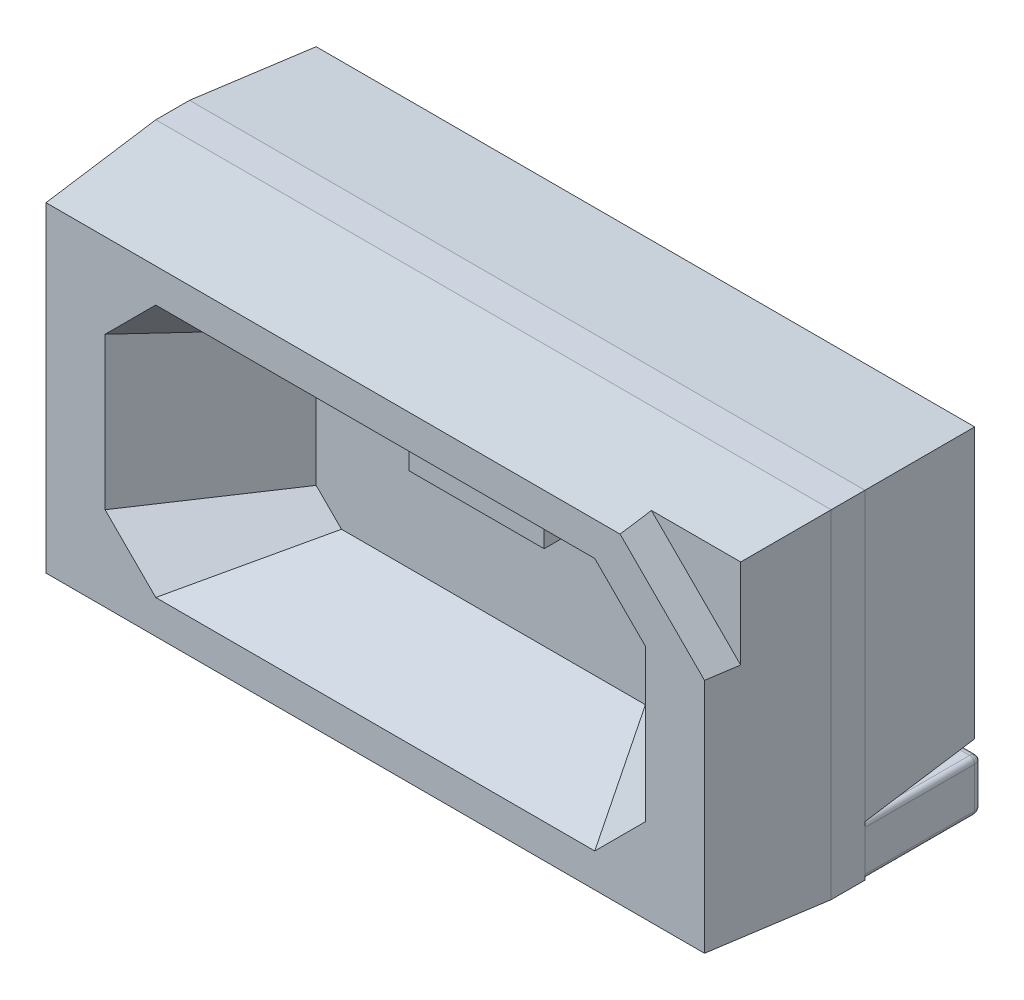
ISO-10303-21;
HEADER;
FILE_DESCRIPTION(('STEP AP214'),'2;1');
FILE_NAME('part.step','',(''),(''),'','','');
FILE_SCHEMA(('AUTOMOTIVE_DESIGN { 1 0 10303 214 1 1 1 1 }'));
ENDSEC;
DATA;
#1=APPLICATION_CONTEXT('core data for automotive mechanical design processes');
#2=APPLICATION_PROTOCOL_DEFINITION('international standard','automotive_design',2000,#1);
#3=PRODUCT_CONTEXT('',#1,'mechanical');
#4=PRODUCT('Part','Part','',(#3));
#5=PRODUCT_RELATED_PRODUCT_CATEGORY('part','',(#4));
#6=PRODUCT_DEFINITION_FORMATION('','',#4);
#7=PRODUCT_DEFINITION_CONTEXT('part definition',#1,'design');
#8=PRODUCT_DEFINITION('design','',#6,#7);
#9=PRODUCT_DEFINITION_SHAPE('','',#8);
#10=(LENGTH_UNIT() NAMED_UNIT(*) SI_UNIT(.MILLI.,.METRE.));
#11=(NAMED_UNIT(*) PLANE_ANGLE_UNIT() SI_UNIT($,.RADIAN.));
#12=(NAMED_UNIT(*) SI_UNIT($,.STERADIAN.) SOLID_ANGLE_UNIT());
#13=UNCERTAINTY_MEASURE_WITH_UNIT(LENGTH_MEASURE(1.E-05),#10,'distance_accuracy_value','');
#14=(GEOMETRIC_REPRESENTATION_CONTEXT(3) GLOBAL_UNCERTAINTY_ASSIGNED_CONTEXT((#13)) GLOBAL_UNIT_ASSIGNED_CONTEXT((#10,
#11,#12)) REPRESENTATION_CONTEXT('',''));
#15=CARTESIAN_POINT('',(0.,0.,0.));
#16=DIRECTION('',(0.,0.,1.));
#17=DIRECTION('',(1.,0.,0.));
#18=AXIS2_PLACEMENT_3D('',#15,#16,#17);
#19=CARTESIAN_POINT('',(0.,0.,0.));
#20=DIRECTION('',(0.,-1.,0.));
#21=DIRECTION('',(0.,0.,-1.));
#22=AXIS2_PLACEMENT_3D('',#19,#20,#21);
#23=PLANE('',#22);
#24=DIRECTION('',(-1.,0.,0.));
#25=VECTOR('',#24,1.);
#26=CARTESIAN_POINT('',(1.,0.,0.7));
#27=LINE('',#26,#25);
#28=CARTESIAN_POINT('',(4.,0.,0.7));
#29=VERTEX_POINT('',#28);
#30=CARTESIAN_POINT('',(0.,0.,0.7));
#31=VERTEX_POINT('',#30);
#32=EDGE_CURVE('P0_E557',#29,#31,#27,.T.);
#33=ORIENTED_EDGE('',*,*,#32,.F.);
#34=DIRECTION('',(0.,0.,1.));
#35=VECTOR('',#34,1.);
#36=CARTESIAN_POINT('',(4.,0.,0.));
#37=LINE('',#36,#35);
#38=CARTESIAN_POINT('',(4.,0.,0.9));
#39=VERTEX_POINT('',#38);
#40=EDGE_CURVE('P0_E11',#29,#39,#37,.T.);
#41=ORIENTED_EDGE('',*,*,#40,.T.);
#42=DIRECTION('',(1.,0.,0.));
#43=VECTOR('',#42,1.);
#44=CARTESIAN_POINT('',(1.,0.,0.9));
#45=LINE('',#44,#43);
#46=CARTESIAN_POINT('',(0.,0.,0.9));
#47=VERTEX_POINT('',#46);
#48=EDGE_CURVE('P0_E146',#47,#39,#45,.T.);
#49=ORIENTED_EDGE('',*,*,#48,.F.);
#50=DIRECTION('',(0.,0.,1.));
#51=VECTOR('',#50,1.);
#52=CARTESIAN_POINT('',(0.,0.,0.));
#53=LINE('',#52,#51);
#54=EDGE_CURVE('P0_E218',#31,#47,#53,.T.);
#55=ORIENTED_EDGE('',*,*,#54,.F.);
#56=EDGE_LOOP('',(#33,#41,#49,#55));
#57=FACE_BOUND('',#56,.T.);
#58=ADVANCED_FACE('P0_F17',(#57),#23,.T.);
#59=CARTESIAN_POINT('',(4.,0.,0.));
#60=DIRECTION('',(1.,0.,0.));
#61=DIRECTION('',(0.,1.,0.));
#62=AXIS2_PLACEMENT_3D('',#59,#60,#61);
#63=PLANE('',#62);
#64=DIRECTION('',(0.,-1.,0.));
#65=VECTOR('',#64,1.);
#66=CARTESIAN_POINT('',(4.,0.5,0.7));
#67=LINE('',#66,#65);
#68=CARTESIAN_POINT('',(4.,2.,0.7));
#69=VERTEX_POINT('',#68);
#70=CARTESIAN_POINT('',(4.,0.3,0.7));
#71=VERTEX_POINT('',#70);
#72=EDGE_CURVE('P0_E270',#69,#71,#67,.T.);
#73=ORIENTED_EDGE('',*,*,#72,.F.);
#74=DIRECTION('',(0.,0.,1.));
#75=VECTOR('',#74,1.);
#76=CARTESIAN_POINT('',(4.,2.,0.));
#77=LINE('',#76,#75);
#78=CARTESIAN_POINT('',(4.,2.,0.9));
#79=VERTEX_POINT('',#78);
#80=EDGE_CURVE('P0_E248',#69,#79,#77,.T.);
#81=ORIENTED_EDGE('',*,*,#80,.T.);
#82=DIRECTION('',(0.,1.,0.));
#83=VECTOR('',#82,1.);
#84=CARTESIAN_POINT('',(4.,0.5,0.9));
#85=LINE('',#84,#83);
#86=EDGE_CURVE('P0_E140',#39,#79,#85,.T.);
#87=ORIENTED_EDGE('',*,*,#86,.F.);
#88=ORIENTED_EDGE('',*,*,#40,.F.);
#89=DIRECTION('',(0.,-1.,0.));
#90=VECTOR('',#89,1.);
#91=CARTESIAN_POINT('',(4.,0.5,0.7));
#92=LINE('',#91,#90);
#93=EDGE_CURVE('P0_E561',#71,#29,#92,.T.);
#94=ORIENTED_EDGE('',*,*,#93,.F.);
#95=EDGE_LOOP('',(#73,#81,#87,#88,#94));
#96=FACE_BOUND('',#95,.T.);
#97=ADVANCED_FACE('P0_F560',(#96),#63,.T.);
#98=CARTESIAN_POINT('',(3.7,1.7,1.4));
#99=DIRECTION('',(0.,0.,-1.));
#100=DIRECTION('',(0.,-1.,0.));
#101=AXIS2_PLACEMENT_3D('',#98,#99,#100);
#102=PLANE('',#101);
#103=DIRECTION('',(1.,0.,0.));
#104=VECTOR('',#103,1.);
#105=CARTESIAN_POINT('',(3.35,1.96428571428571,1.4));
#106=LINE('',#105,#104);
#107=CARTESIAN_POINT('',(3.43571428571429,1.96428571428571,1.4));
#108=VERTEX_POINT('',#107);
#109=CARTESIAN_POINT('',(3.96428571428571,1.96428571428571,1.4));
#110=VERTEX_POINT('',#109);
#111=EDGE_CURVE('P0_E183',#108,#110,#106,.T.);
#112=ORIENTED_EDGE('',*,*,#111,.F.);
#113=DIRECTION('',(-0.707106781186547,0.707106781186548,0.));
#114=VECTOR('',#113,1.);
#115=CARTESIAN_POINT('',(3.4,2.,1.4));
#116=LINE('',#115,#114);
#117=CARTESIAN_POINT('',(3.96428571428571,1.43571428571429,1.4));
#118=VERTEX_POINT('',#117);
#119=EDGE_CURVE('P0_E20',#118,#108,#116,.T.);
#120=ORIENTED_EDGE('',*,*,#119,.F.);
#121=DIRECTION('',(0.,-1.,0.));
#122=VECTOR('',#121,1.);
#123=CARTESIAN_POINT('',(3.96428571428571,1.1,1.4));
#124=LINE('',#123,#122);
#125=EDGE_CURVE('P0_E162',#110,#118,#124,.T.);
#126=ORIENTED_EDGE('',*,*,#125,.F.);
#127=EDGE_LOOP('',(#112,#120,#126));
#128=FACE_BOUND('',#127,.T.);
#129=ADVANCED_FACE('P0_F184',(#128),#102,.F.);
#130=CARTESIAN_POINT('',(4.,1.4,1.6));
#131=DIRECTION('',(-0.707106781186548,-0.707106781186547,0.));
#132=DIRECTION('',(-0.707106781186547,0.707106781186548,0.));
#133=AXIS2_PLACEMENT_3D('',#130,#131,#132);
#134=PLANE('',#133);
#135=DIRECTION('',(-0.0710669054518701,0.0710669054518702,-0.994936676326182));
#136=VECTOR('',#135,1.);
#137=CARTESIAN_POINT('',(3.43920454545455,1.96079545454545,1.44886363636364));
#138=LINE('',#137,#136);
#139=CARTESIAN_POINT('',(3.45,1.95,1.6));
#140=VERTEX_POINT('',#139);
#141=EDGE_CURVE('P0_E179',#140,#108,#138,.T.);
#142=ORIENTED_EDGE('',*,*,#141,.F.);
#143=DIRECTION('',(-0.707106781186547,0.707106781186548,0.));
#144=VECTOR('',#143,1.);
#145=CARTESIAN_POINT('',(3.6,1.8,1.6));
#146=LINE('',#145,#144);
#147=CARTESIAN_POINT('',(3.95,1.45,1.6));
#148=VERTEX_POINT('',#147);
#149=EDGE_CURVE('P0_E125',#148,#140,#146,.T.);
#150=ORIENTED_EDGE('',*,*,#149,.F.);
#151=DIRECTION('',(-0.0710669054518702,0.0710669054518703,0.994936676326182));
#152=VECTOR('',#151,1.);
#153=CARTESIAN_POINT('',(3.96508838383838,1.43491161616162,1.38876262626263));
#154=LINE('',#153,#152);
#155=EDGE_CURVE('P0_E155',#118,#148,#154,.T.);
#156=ORIENTED_EDGE('',*,*,#155,.F.);
#157=ORIENTED_EDGE('',*,*,#119,.T.);
#158=EDGE_LOOP('',(#142,#150,#156,#157));
#159=FACE_BOUND('',#158,.T.);
#160=ADVANCED_FACE('P0_F177',(#159),#134,.F.);
#161=CARTESIAN_POINT('',(2.,1.,1.6));
#162=DIRECTION('',(0.,0.,1.));
#163=DIRECTION('',(1.,0.,0.));
#164=AXIS2_PLACEMENT_3D('',#161,#162,#163);
#165=PLANE('',#164);
#166=DIRECTION('',(0.,-1.,0.));
#167=VECTOR('',#166,1.);
#168=CARTESIAN_POINT('',(3.6,0.775,1.6));
#169=LINE('',#168,#167);
#170=CARTESIAN_POINT('',(3.6,1.45,1.6));
#171=VERTEX_POINT('',#170);
#172=CARTESIAN_POINT('',(3.6,0.55,1.6));
#173=VERTEX_POINT('',#172);
#174=EDGE_CURVE('P0_E382',#171,#173,#169,.T.);
#175=ORIENTED_EDGE('',*,*,#174,.T.);
#176=DIRECTION('',(-0.707106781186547,-0.707106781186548,0.));
#177=VECTOR('',#176,1.);
#178=CARTESIAN_POINT('',(3.1625,0.1125,1.6));
#179=LINE('',#178,#177);
#180=CARTESIAN_POINT('',(3.3,0.25,1.6));
#181=VERTEX_POINT('',#180);
#182=EDGE_CURVE('P0_E237',#173,#181,#179,.T.);
#183=ORIENTED_EDGE('',*,*,#182,.T.);
#184=DIRECTION('',(-1.,0.,0.));
#185=VECTOR('',#184,1.);
#186=CARTESIAN_POINT('',(1.35,0.25,1.6));
#187=LINE('',#186,#185);
#188=CARTESIAN_POINT('',(0.7,0.25,1.6));
#189=VERTEX_POINT('',#188);
#190=EDGE_CURVE('P0_E230',#181,#189,#187,.T.);
#191=ORIENTED_EDGE('',*,*,#190,.T.);
#192=DIRECTION('',(-0.707106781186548,0.707106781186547,0.));
#193=VECTOR('',#192,1.);
#194=CARTESIAN_POINT('',(0.6875,0.2625,1.6));
#195=LINE('',#194,#193);
#196=CARTESIAN_POINT('',(0.4,0.55,1.6));
#197=VERTEX_POINT('',#196);
#198=EDGE_CURVE('P0_E228',#189,#197,#195,.T.);
#199=ORIENTED_EDGE('',*,*,#198,.T.);
#200=DIRECTION('',(0.,1.,0.));
#201=VECTOR('',#200,1.);
#202=CARTESIAN_POINT('',(0.4,1.225,1.6));
#203=LINE('',#202,#201);
#204=CARTESIAN_POINT('',(0.4,1.45,1.6));
#205=VERTEX_POINT('',#204);
#206=EDGE_CURVE('P0_E229',#197,#205,#203,.T.);
#207=ORIENTED_EDGE('',*,*,#206,.T.);
#208=DIRECTION('',(0.707106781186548,0.707106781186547,0.));
#209=VECTOR('',#208,1.);
#210=CARTESIAN_POINT('',(0.8375,1.8875,1.6));
#211=LINE('',#210,#209);
#212=CARTESIAN_POINT('',(0.7,1.75,1.6));
#213=VERTEX_POINT('',#212);
#214=EDGE_CURVE('P0_E222',#205,#213,#211,.T.);
#215=ORIENTED_EDGE('',*,*,#214,.T.);
#216=DIRECTION('',(1.,0.,0.));
#217=VECTOR('',#216,1.);
#218=CARTESIAN_POINT('',(2.65,1.75,1.6));
#219=LINE('',#218,#217);
#220=CARTESIAN_POINT('',(3.3,1.75,1.6));
#221=VERTEX_POINT('',#220);
#222=EDGE_CURVE('P0_E275',#213,#221,#219,.T.);
#223=ORIENTED_EDGE('',*,*,#222,.T.);
#224=DIRECTION('',(0.707106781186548,-0.707106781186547,0.));
#225=VECTOR('',#224,1.);
#226=CARTESIAN_POINT('',(3.3125,1.7375,1.6));
#227=LINE('',#226,#225);
#228=EDGE_CURVE('P0_E359',#221,#171,#227,.T.);
#229=ORIENTED_EDGE('',*,*,#228,.T.);
#230=EDGE_LOOP('',(#175,#183,#191,#199,#207,#215,#223,#229));
#231=FACE_BOUND('',#230,.T.);
#232=DIRECTION('',(1.,0.,0.));
#233=VECTOR('',#232,1.);
#234=CARTESIAN_POINT('',(3.,1.95,1.6));
#235=LINE('',#234,#233);
#236=CARTESIAN_POINT('',(0.05,1.95,1.6));
#237=VERTEX_POINT('',#236);
#238=EDGE_CURVE('P0_E191',#237,#140,#235,.T.);
#239=ORIENTED_EDGE('',*,*,#238,.F.);
#240=DIRECTION('',(0.,1.,0.));
#241=VECTOR('',#240,1.);
#242=CARTESIAN_POINT('',(0.05,1.5,1.6));
#243=LINE('',#242,#241);
#244=CARTESIAN_POINT('',(0.05,0.05,1.6));
#245=VERTEX_POINT('',#244);
#246=EDGE_CURVE('P0_E40',#245,#237,#243,.T.);
#247=ORIENTED_EDGE('',*,*,#246,.F.);
#248=DIRECTION('',(-1.,0.,0.));
#249=VECTOR('',#248,1.);
#250=CARTESIAN_POINT('',(1.,0.05,1.6));
#251=LINE('',#250,#249);
#252=CARTESIAN_POINT('',(3.95,0.05,1.6));
#253=VERTEX_POINT('',#252);
#254=EDGE_CURVE('P0_E130',#253,#245,#251,.T.);
#255=ORIENTED_EDGE('',*,*,#254,.F.);
#256=DIRECTION('',(0.,-1.,0.));
#257=VECTOR('',#256,1.);
#258=CARTESIAN_POINT('',(3.95,0.5,1.6));
#259=LINE('',#258,#257);
#260=EDGE_CURVE('P0_E134',#148,#253,#259,.T.);
#261=ORIENTED_EDGE('',*,*,#260,.F.);
#262=ORIENTED_EDGE('',*,*,#149,.T.);
#263=EDGE_LOOP('',(#239,#247,#255,#261,#262));
#264=FACE_BOUND('',#263,.T.);
#265=ADVANCED_FACE('P0_F132',(#231,#264),#165,.T.);
#266=CARTESIAN_POINT('',(0.025,1.5,1.25));
#267=DIRECTION('',(-0.997458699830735,0.,0.0712470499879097));
#268=DIRECTION('',(0.,1.,0.));
#269=AXIS2_PLACEMENT_3D('',#266,#267,#268);
#270=PLANE('',#269);
#271=DIRECTION('',(0.,-1.,0.));
#272=VECTOR('',#271,1.);
#273=CARTESIAN_POINT('',(0.,1.5,0.9));
#274=LINE('',#273,#272);
#275=CARTESIAN_POINT('',(0.,2.,0.9));
#276=VERTEX_POINT('',#275);
#277=EDGE_CURVE('P0_E210',#276,#47,#274,.T.);
#278=ORIENTED_EDGE('',*,*,#277,.T.);
#279=DIRECTION('',(-0.0710669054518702,-0.0710669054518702,-0.994936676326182));
#280=VECTOR('',#279,1.);
#281=CARTESIAN_POINT('',(0.05,0.05,1.6));
#282=LINE('',#281,#280);
#283=EDGE_CURVE('P0_E139',#245,#47,#282,.T.);
#284=ORIENTED_EDGE('',*,*,#283,.F.);
#285=ORIENTED_EDGE('',*,*,#246,.T.);
#286=DIRECTION('',(-0.0710669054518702,0.0710669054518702,-0.994936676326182));
#287=VECTOR('',#286,1.);
#288=CARTESIAN_POINT('',(0.05,1.95,1.6));
#289=LINE('',#288,#287);
#290=EDGE_CURVE('P0_E197',#237,#276,#289,.T.);
#291=ORIENTED_EDGE('',*,*,#290,.T.);
#292=EDGE_LOOP('',(#278,#284,#285,#291));
#293=FACE_BOUND('',#292,.T.);
#294=ADVANCED_FACE('P0_F547',(#293),#270,.T.);
#295=CARTESIAN_POINT('',(1.,0.025,1.25));
#296=DIRECTION('',(0.,-0.997458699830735,0.0712470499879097));
#297=DIRECTION('',(-1.,0.,0.));
#298=AXIS2_PLACEMENT_3D('',#295,#296,#297);
#299=PLANE('',#298);
#300=ORIENTED_EDGE('',*,*,#254,.T.);
#301=ORIENTED_EDGE('',*,*,#283,.T.);
#302=ORIENTED_EDGE('',*,*,#48,.T.);
#303=DIRECTION('',(0.0710669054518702,-0.0710669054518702,-0.994936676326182));
#304=VECTOR('',#303,1.);
#305=CARTESIAN_POINT('',(3.95,0.05,1.6));
#306=LINE('',#305,#304);
#307=EDGE_CURVE('P0_E144',#253,#39,#306,.T.);
#308=ORIENTED_EDGE('',*,*,#307,.F.);
#309=EDGE_LOOP('',(#300,#301,#302,#308));
#310=FACE_BOUND('',#309,.T.);
#311=ADVANCED_FACE('P0_F145',(#310),#299,.T.);
#312=CARTESIAN_POINT('',(3.975,0.5,1.25));
#313=DIRECTION('',(0.997458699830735,0.,0.0712470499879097));
#314=DIRECTION('',(0.,-1.,0.));
#315=AXIS2_PLACEMENT_3D('',#312,#313,#314);
#316=PLANE('',#315);
#317=DIRECTION('',(-0.0710669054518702,-0.0710669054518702,0.994936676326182));
#318=VECTOR('',#317,1.);
#319=CARTESIAN_POINT('',(3.96881313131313,1.96881313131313,1.33661616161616));
#320=LINE('',#319,#318);
#321=EDGE_CURVE('P0_E206',#79,#110,#320,.T.);
#322=ORIENTED_EDGE('',*,*,#321,.T.);
#323=ORIENTED_EDGE('',*,*,#125,.T.);
#324=ORIENTED_EDGE('',*,*,#155,.T.);
#325=ORIENTED_EDGE('',*,*,#260,.T.);
#326=ORIENTED_EDGE('',*,*,#307,.T.);
#327=ORIENTED_EDGE('',*,*,#86,.T.);
#328=EDGE_LOOP('',(#322,#323,#324,#325,#326,#327));
#329=FACE_BOUND('',#328,.T.);
#330=ADVANCED_FACE('P0_F153',(#329),#316,.T.);
#331=CARTESIAN_POINT('',(3.,1.975,1.25));
#332=DIRECTION('',(0.,0.997458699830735,0.0712470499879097));
#333=DIRECTION('',(1.,0.,0.));
#334=AXIS2_PLACEMENT_3D('',#331,#332,#333);
#335=PLANE('',#334);
#336=ORIENTED_EDGE('',*,*,#321,.F.);
#337=DIRECTION('',(-1.,0.,0.));
#338=VECTOR('',#337,1.);
#339=CARTESIAN_POINT('',(3.,2.,0.9));
#340=LINE('',#339,#338);
#341=EDGE_CURVE('P0_E245',#79,#276,#340,.T.);
#342=ORIENTED_EDGE('',*,*,#341,.T.);
#343=ORIENTED_EDGE('',*,*,#290,.F.);
#344=ORIENTED_EDGE('',*,*,#238,.T.);
#345=ORIENTED_EDGE('',*,*,#141,.T.);
#346=ORIENTED_EDGE('',*,*,#111,.T.);
#347=EDGE_LOOP('',(#336,#342,#343,#344,#345,#346));
#348=FACE_BOUND('',#347,.T.);
#349=ADVANCED_FACE('P0_F189',(#348),#335,.T.);
#350=CARTESIAN_POINT('',(0.,2.,0.));
#351=DIRECTION('',(-1.,0.,0.));
#352=DIRECTION('',(0.,0.,1.));
#353=AXIS2_PLACEMENT_3D('',#350,#351,#352);
#354=PLANE('',#353);
#355=DIRECTION('',(0.,1.,0.));
#356=VECTOR('',#355,1.);
#357=CARTESIAN_POINT('',(0.,1.5,0.7));
#358=LINE('',#357,#356);
#359=CARTESIAN_POINT('',(0.,0.3,0.7));
#360=VERTEX_POINT('',#359);
#361=EDGE_CURVE('P0_E553',#31,#360,#358,.T.);
#362=ORIENTED_EDGE('',*,*,#361,.F.);
#363=ORIENTED_EDGE('',*,*,#54,.T.);
#364=ORIENTED_EDGE('',*,*,#277,.F.);
#365=DIRECTION('',(0.,0.,1.));
#366=VECTOR('',#365,1.);
#367=CARTESIAN_POINT('',(0.,2.,0.));
#368=LINE('',#367,#366);
#369=CARTESIAN_POINT('',(0.,2.,0.7));
#370=VERTEX_POINT('',#369);
#371=EDGE_CURVE('P0_E242',#370,#276,#368,.T.);
#372=ORIENTED_EDGE('',*,*,#371,.F.);
#373=DIRECTION('',(0.,1.,0.));
#374=VECTOR('',#373,1.);
#375=CARTESIAN_POINT('',(0.,1.5,0.7));
#376=LINE('',#375,#374);
#377=EDGE_CURVE('P0_E241',#360,#370,#376,.T.);
#378=ORIENTED_EDGE('',*,*,#377,.F.);
#379=EDGE_LOOP('',(#362,#363,#364,#372,#378));
#380=FACE_BOUND('',#379,.T.);
#381=ADVANCED_FACE('P0_F551',(#380),#354,.T.);
#382=CARTESIAN_POINT('',(4.,2.,0.));
#383=DIRECTION('',(0.,1.,0.));
#384=DIRECTION('',(1.,0.,0.));
#385=AXIS2_PLACEMENT_3D('',#382,#383,#384);
#386=PLANE('',#385);
#387=DIRECTION('',(1.,0.,0.));
#388=VECTOR('',#387,1.);
#389=CARTESIAN_POINT('',(3.,2.,0.7));
#390=LINE('',#389,#388);
#391=EDGE_CURVE('P0_E246',#370,#69,#390,.T.);
#392=ORIENTED_EDGE('',*,*,#391,.F.);
#393=ORIENTED_EDGE('',*,*,#371,.T.);
#394=ORIENTED_EDGE('',*,*,#341,.F.);
#395=ORIENTED_EDGE('',*,*,#80,.F.);
#396=EDGE_LOOP('',(#392,#393,#394,#395));
#397=FACE_BOUND('',#396,.T.);
#398=ADVANCED_FACE('P0_F616',(#397),#386,.T.);
#399=CARTESIAN_POINT('',(3.,1.975,0.35));
#400=DIRECTION('',(0.,0.997458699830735,-0.0712470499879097));
#401=DIRECTION('',(-1.,0.,0.));
#402=AXIS2_PLACEMENT_3D('',#399,#400,#401);
#403=PLANE('',#402);
#404=DIRECTION('',(-1.,0.,0.));
#405=VECTOR('',#404,1.);
#406=CARTESIAN_POINT('',(3.,1.95,0.));
#407=LINE('',#406,#405);
#408=CARTESIAN_POINT('',(3.95,1.95,0.));
#409=VERTEX_POINT('',#408);
#410=CARTESIAN_POINT('',(0.05,1.95,0.));
#411=VERTEX_POINT('',#410);
#412=EDGE_CURVE('P0_E283',#409,#411,#407,.T.);
#413=ORIENTED_EDGE('',*,*,#412,.T.);
#414=DIRECTION('',(0.0710669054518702,-0.0710669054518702,-0.994936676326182));
#415=VECTOR('',#414,1.);
#416=CARTESIAN_POINT('',(0.,2.,0.7));
#417=LINE('',#416,#415);
#418=EDGE_CURVE('P0_E322',#370,#411,#417,.T.);
#419=ORIENTED_EDGE('',*,*,#418,.F.);
#420=ORIENTED_EDGE('',*,*,#391,.T.);
#421=DIRECTION('',(0.0710669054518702,0.0710669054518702,0.994936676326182));
#422=VECTOR('',#421,1.);
#423=CARTESIAN_POINT('',(3.95,1.95,0.));
#424=LINE('',#423,#422);
#425=EDGE_CURVE('P0_E266',#409,#69,#424,.T.);
#426=ORIENTED_EDGE('',*,*,#425,.F.);
#427=EDGE_LOOP('',(#413,#419,#420,#426));
#428=FACE_BOUND('',#427,.T.);
#429=ADVANCED_FACE('P0_F613',(#428),#403,.T.);
#430=CARTESIAN_POINT('',(0.025,1.5,0.35));
#431=DIRECTION('',(-0.997458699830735,0.,-0.0712470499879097));
#432=DIRECTION('',(-0.0712470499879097,0.,0.997458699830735));
#433=AXIS2_PLACEMENT_3D('',#430,#431,#432);
#434=PLANE('',#433);
#435=DIRECTION('',(-0.0710669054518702,-0.0710669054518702,0.994936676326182));
#436=VECTOR('',#435,1.);
#437=CARTESIAN_POINT('',(0.0404671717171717,0.340467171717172,0.133459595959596));
#438=LINE('',#437,#436);
#439=CARTESIAN_POINT('',(0.05,0.35,0.));
#440=VERTEX_POINT('',#439);
#441=EDGE_CURVE('P0_E590',#440,#360,#438,.T.);
#442=ORIENTED_EDGE('',*,*,#441,.T.);
#443=ORIENTED_EDGE('',*,*,#377,.T.);
#444=ORIENTED_EDGE('',*,*,#418,.T.);
#445=DIRECTION('',(0.,-1.,0.));
#446=VECTOR('',#445,1.);
#447=CARTESIAN_POINT('',(0.05,1.5,0.));
#448=LINE('',#447,#446);
#449=EDGE_CURVE('P0_E274',#411,#440,#448,.T.);
#450=ORIENTED_EDGE('',*,*,#449,.T.);
#451=EDGE_LOOP('',(#442,#443,#444,#450));
#452=FACE_BOUND('',#451,.T.);
#453=ADVANCED_FACE('P0_F728',(#452),#434,.T.);
#454=CARTESIAN_POINT('',(3.3,0.25,1.6));
#455=DIRECTION('',(-0.604707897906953,0.604707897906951,0.518321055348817));
#456=DIRECTION('',(0.650791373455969,0.,0.759256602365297));
#457=AXIS2_PLACEMENT_3D('',#454,#455,#456);
#458=PLANE('',#457);
#459=ORIENTED_EDGE('',*,*,#182,.F.);
#460=DIRECTION('',(-0.616849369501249,0.0560772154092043,-0.785081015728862));
#461=VECTOR('',#460,1.);
#462=CARTESIAN_POINT('',(3.6,0.55,1.6));
#463=LINE('',#462,#461);
#464=CARTESIAN_POINT('',(3.05,0.6,0.9));
#465=VERTEX_POINT('',#464);
#466=EDGE_CURVE('P0_E362',#173,#465,#463,.T.);
#467=ORIENTED_EDGE('',*,*,#466,.T.);
#468=DIRECTION('',(0.707106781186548,0.707106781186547,0.));
#469=VECTOR('',#468,1.);
#470=CARTESIAN_POINT('',(3.05,0.6,0.9));
#471=LINE('',#470,#469);
#472=CARTESIAN_POINT('',(2.9,0.45,0.9));
#473=VERTEX_POINT('',#472);
#474=EDGE_CURVE('P0_E306',#473,#465,#471,.T.);
#475=ORIENTED_EDGE('',*,*,#474,.F.);
#476=DIRECTION('',(-0.481543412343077,0.240771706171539,-0.842700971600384));
#477=VECTOR('',#476,1.);
#478=CARTESIAN_POINT('',(3.3,0.25,1.6));
#479=LINE('',#478,#477);
#480=EDGE_CURVE('P0_E233',#181,#473,#479,.T.);
#481=ORIENTED_EDGE('',*,*,#480,.F.);
#482=EDGE_LOOP('',(#459,#467,#475,#481));
#483=FACE_BOUND('',#482,.T.);
#484=ADVANCED_FACE('P0_F433',(#483),#458,.T.);
#485=CARTESIAN_POINT('',(0.7,0.25,1.6));
#486=DIRECTION('',(0.,0.961523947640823,0.274721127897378));
#487=DIRECTION('',(1.,0.,0.));
#488=AXIS2_PLACEMENT_3D('',#485,#486,#487);
#489=PLANE('',#488);
#490=ORIENTED_EDGE('',*,*,#190,.F.);
#491=ORIENTED_EDGE('',*,*,#480,.T.);
#492=DIRECTION('',(1.,0.,0.));
#493=VECTOR('',#492,1.);
#494=CARTESIAN_POINT('',(2.9,0.45,0.9));
#495=LINE('',#494,#493);
#496=CARTESIAN_POINT('',(1.1,0.45,0.9));
#497=VERTEX_POINT('',#496);
#498=EDGE_CURVE('P0_E366',#497,#473,#495,.T.);
#499=ORIENTED_EDGE('',*,*,#498,.F.);
#500=DIRECTION('',(0.481543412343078,0.240771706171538,-0.842700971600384));
#501=VECTOR('',#500,1.);
#502=CARTESIAN_POINT('',(0.7,0.25,1.6));
#503=LINE('',#502,#501);
#504=EDGE_CURVE('P0_E234',#189,#497,#503,.T.);
#505=ORIENTED_EDGE('',*,*,#504,.F.);
#506=EDGE_LOOP('',(#490,#491,#499,#505));
#507=FACE_BOUND('',#506,.T.);
#508=ADVANCED_FACE('P0_F438',(#507),#489,.T.);
#509=CARTESIAN_POINT('',(0.4,0.55,1.6));
#510=DIRECTION('',(0.604707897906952,0.604707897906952,0.518321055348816));
#511=DIRECTION('',(0.,0.650791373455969,-0.759256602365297));
#512=AXIS2_PLACEMENT_3D('',#509,#510,#511);
#513=PLANE('',#512);
#514=ORIENTED_EDGE('',*,*,#198,.F.);
#515=ORIENTED_EDGE('',*,*,#504,.T.);
#516=DIRECTION('',(0.707106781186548,-0.707106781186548,0.));
#517=VECTOR('',#516,1.);
#518=CARTESIAN_POINT('',(1.1,0.45,0.9));
#519=LINE('',#518,#517);
#520=CARTESIAN_POINT('',(0.95,0.6,0.9));
#521=VERTEX_POINT('',#520);
#522=EDGE_CURVE('P0_E357',#521,#497,#519,.T.);
#523=ORIENTED_EDGE('',*,*,#522,.F.);
#524=DIRECTION('',(0.616849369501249,0.0560772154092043,-0.785081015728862));
#525=VECTOR('',#524,1.);
#526=CARTESIAN_POINT('',(0.4,0.55,1.6));
#527=LINE('',#526,#525);
#528=EDGE_CURVE('P0_E224',#197,#521,#527,.T.);
#529=ORIENTED_EDGE('',*,*,#528,.F.);
#530=EDGE_LOOP('',(#514,#515,#523,#529));
#531=FACE_BOUND('',#530,.T.);
#532=ADVANCED_FACE('P0_F445',(#531),#513,.T.);
#533=CARTESIAN_POINT('',(0.4,1.45,1.6));
#534=DIRECTION('',(0.786318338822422,0.,0.617821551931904));
#535=DIRECTION('',(0.,-1.,0.));
#536=AXIS2_PLACEMENT_3D('',#533,#534,#535);
#537=PLANE('',#536);
#538=ORIENTED_EDGE('',*,*,#206,.F.);
#539=ORIENTED_EDGE('',*,*,#528,.T.);
#540=DIRECTION('',(0.,-1.,0.));
#541=VECTOR('',#540,1.);
#542=CARTESIAN_POINT('',(0.95,0.6,0.9));
#543=LINE('',#542,#541);
#544=CARTESIAN_POINT('',(0.95,1.4,0.9));
#545=VERTEX_POINT('',#544);
#546=EDGE_CURVE('P0_E354',#545,#521,#543,.T.);
#547=ORIENTED_EDGE('',*,*,#546,.F.);
#548=DIRECTION('',(0.616849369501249,-0.0560772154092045,-0.785081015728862));
#549=VECTOR('',#548,1.);
#550=CARTESIAN_POINT('',(0.4,1.45,1.6));
#551=LINE('',#550,#549);
#552=EDGE_CURVE('P0_E327',#205,#545,#551,.T.);
#553=ORIENTED_EDGE('',*,*,#552,.F.);
#554=EDGE_LOOP('',(#538,#539,#547,#553));
#555=FACE_BOUND('',#554,.T.);
#556=ADVANCED_FACE('P0_F449',(#555),#537,.T.);
#557=CARTESIAN_POINT('',(0.7,1.75,1.6));
#558=DIRECTION('',(0.604707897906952,-0.604707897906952,0.518321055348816));
#559=DIRECTION('',(0.,-0.650791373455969,-0.759256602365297));
#560=AXIS2_PLACEMENT_3D('',#557,#558,#559);
#561=PLANE('',#560);
#562=ORIENTED_EDGE('',*,*,#214,.F.);
#563=ORIENTED_EDGE('',*,*,#552,.T.);
#564=DIRECTION('',(-0.707106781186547,-0.707106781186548,0.));
#565=VECTOR('',#564,1.);
#566=CARTESIAN_POINT('',(0.95,1.4,0.9));
#567=LINE('',#566,#565);
#568=CARTESIAN_POINT('',(1.1,1.55,0.9));
#569=VERTEX_POINT('',#568);
#570=EDGE_CURVE('P0_E350',#569,#545,#567,.T.);
#571=ORIENTED_EDGE('',*,*,#570,.F.);
#572=DIRECTION('',(0.481543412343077,-0.240771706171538,-0.842700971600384));
#573=VECTOR('',#572,1.);
#574=CARTESIAN_POINT('',(0.7,1.75,1.6));
#575=LINE('',#574,#573);
#576=EDGE_CURVE('P0_E278',#213,#569,#575,.T.);
#577=ORIENTED_EDGE('',*,*,#576,.F.);
#578=EDGE_LOOP('',(#562,#563,#571,#577));
#579=FACE_BOUND('',#578,.T.);
#580=ADVANCED_FACE('P0_F415',(#579),#561,.T.);
#581=CARTESIAN_POINT('',(3.3,1.75,1.6));
#582=DIRECTION('',(0.,-0.961523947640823,0.274721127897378));
#583=DIRECTION('',(-1.,0.,0.));
#584=AXIS2_PLACEMENT_3D('',#581,#582,#583);
#585=PLANE('',#584);
#586=ORIENTED_EDGE('',*,*,#222,.F.);
#587=ORIENTED_EDGE('',*,*,#576,.T.);
#588=DIRECTION('',(-1.,0.,0.));
#589=VECTOR('',#588,1.);
#590=CARTESIAN_POINT('',(1.1,1.55,0.9));
#591=LINE('',#590,#589);
#592=CARTESIAN_POINT('',(1.6,1.55,0.9));
#593=VERTEX_POINT('',#592);
#594=EDGE_CURVE('P0_E346',#593,#569,#591,.T.);
#595=ORIENTED_EDGE('',*,*,#594,.F.);
#596=DIRECTION('',(-1.,0.,0.));
#597=VECTOR('',#596,1.);
#598=CARTESIAN_POINT('',(1.1,1.55,0.9));
#599=LINE('',#598,#597);
#600=CARTESIAN_POINT('',(2.4,1.55,0.9));
#601=VERTEX_POINT('',#600);
#602=EDGE_CURVE('P0_E300',#601,#593,#599,.T.);
#603=ORIENTED_EDGE('',*,*,#602,.F.);
#604=DIRECTION('',(-1.,0.,0.));
#605=VECTOR('',#604,1.);
#606=CARTESIAN_POINT('',(1.1,1.55,0.9));
#607=LINE('',#606,#605);
#608=CARTESIAN_POINT('',(2.9,1.55,0.9));
#609=VERTEX_POINT('',#608);
#610=EDGE_CURVE('P0_E376',#609,#601,#607,.T.);
#611=ORIENTED_EDGE('',*,*,#610,.F.);
#612=DIRECTION('',(-0.481543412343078,-0.240771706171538,-0.842700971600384));
#613=VECTOR('',#612,1.);
#614=CARTESIAN_POINT('',(3.3,1.75,1.6));
#615=LINE('',#614,#613);
#616=EDGE_CURVE('P0_E279',#221,#609,#615,.T.);
#617=ORIENTED_EDGE('',*,*,#616,.F.);
#618=EDGE_LOOP('',(#586,#587,#595,#603,#611,#617));
#619=FACE_BOUND('',#618,.T.);
#620=ADVANCED_FACE('P0_F416',(#619),#585,.T.);
#621=CARTESIAN_POINT('',(3.6,1.45,1.6));
#622=DIRECTION('',(-0.604707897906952,-0.604707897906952,0.518321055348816));
#623=DIRECTION('',(-0.707106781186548,0.707106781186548,0.));
#624=AXIS2_PLACEMENT_3D('',#621,#622,#623);
#625=PLANE('',#624);
#626=ORIENTED_EDGE('',*,*,#228,.F.);
#627=ORIENTED_EDGE('',*,*,#616,.T.);
#628=DIRECTION('',(-0.707106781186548,0.707106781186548,0.));
#629=VECTOR('',#628,1.);
#630=CARTESIAN_POINT('',(2.9,1.55,0.9));
#631=LINE('',#630,#629);
#632=CARTESIAN_POINT('',(3.05,1.4,0.9));
#633=VERTEX_POINT('',#632);
#634=EDGE_CURVE('P0_E305',#633,#609,#631,.T.);
#635=ORIENTED_EDGE('',*,*,#634,.F.);
#636=DIRECTION('',(-0.616849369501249,-0.0560772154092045,-0.785081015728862));
#637=VECTOR('',#636,1.);
#638=CARTESIAN_POINT('',(3.6,1.45,1.6));
#639=LINE('',#638,#637);
#640=EDGE_CURVE('P0_E385',#171,#633,#639,.T.);
#641=ORIENTED_EDGE('',*,*,#640,.F.);
#642=EDGE_LOOP('',(#626,#627,#635,#641));
#643=FACE_BOUND('',#642,.T.);
#644=ADVANCED_FACE('P0_F423',(#643),#625,.T.);
#645=CARTESIAN_POINT('',(3.6,0.55,1.6));
#646=DIRECTION('',(-0.786318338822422,0.,0.617821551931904));
#647=DIRECTION('',(0.,1.,0.));
#648=AXIS2_PLACEMENT_3D('',#645,#646,#647);
#649=PLANE('',#648);
#650=ORIENTED_EDGE('',*,*,#174,.F.);
#651=ORIENTED_EDGE('',*,*,#640,.T.);
#652=DIRECTION('',(0.,1.,0.));
#653=VECTOR('',#652,1.);
#654=CARTESIAN_POINT('',(3.05,1.4,0.9));
#655=LINE('',#654,#653);
#656=EDGE_CURVE('P0_E301',#465,#633,#655,.T.);
#657=ORIENTED_EDGE('',*,*,#656,.F.);
#658=ORIENTED_EDGE('',*,*,#466,.F.);
#659=EDGE_LOOP('',(#650,#651,#657,#658));
#660=FACE_BOUND('',#659,.T.);
#661=ADVANCED_FACE('P0_F428',(#660),#649,.T.);
#662=CARTESIAN_POINT('',(2.,1.,0.9));
#663=DIRECTION('',(0.,0.,1.));
#664=DIRECTION('',(1.,0.,0.));
#665=AXIS2_PLACEMENT_3D('',#662,#663,#664);
#666=PLANE('',#665);
#667=DIRECTION('',(0.,-1.,0.));
#668=VECTOR('',#667,1.);
#669=CARTESIAN_POINT('',(2.4,1.025,0.9));
#670=LINE('',#669,#668);
#671=CARTESIAN_POINT('',(2.4,1.05,0.9));
#672=VERTEX_POINT('',#671);
#673=EDGE_CURVE('P0_E317',#601,#672,#670,.T.);
#674=ORIENTED_EDGE('',*,*,#673,.T.);
#675=DIRECTION('',(-1.,0.,0.));
#676=VECTOR('',#675,1.);
#677=CARTESIAN_POINT('',(1.8,1.05,0.9));
#678=LINE('',#677,#676);
#679=CARTESIAN_POINT('',(1.6,1.05,0.9));
#680=VERTEX_POINT('',#679);
#681=EDGE_CURVE('P0_E338',#672,#680,#678,.T.);
#682=ORIENTED_EDGE('',*,*,#681,.T.);
#683=DIRECTION('',(0.,1.,0.));
#684=VECTOR('',#683,1.);
#685=CARTESIAN_POINT('',(1.6,1.275,0.9));
#686=LINE('',#685,#684);
#687=EDGE_CURVE('P0_E287',#680,#593,#686,.T.);
#688=ORIENTED_EDGE('',*,*,#687,.T.);
#689=ORIENTED_EDGE('',*,*,#594,.T.);
#690=ORIENTED_EDGE('',*,*,#570,.T.);
#691=ORIENTED_EDGE('',*,*,#546,.T.);
#692=ORIENTED_EDGE('',*,*,#522,.T.);
#693=ORIENTED_EDGE('',*,*,#498,.T.);
#694=ORIENTED_EDGE('',*,*,#474,.T.);
#695=ORIENTED_EDGE('',*,*,#656,.T.);
#696=ORIENTED_EDGE('',*,*,#634,.T.);
#697=ORIENTED_EDGE('',*,*,#610,.T.);
#698=EDGE_LOOP('',(#674,#682,#688,#689,#690,#691,#692,#693,#694,#695,#696,#697));
#699=FACE_BOUND('',#698,.T.);
#700=ADVANCED_FACE('P0_F467',(#699),#666,.T.);
#701=CARTESIAN_POINT('',(2.,1.3,1.));
#702=DIRECTION('',(0.,0.,1.));
#703=DIRECTION('',(1.,0.,0.));
#704=AXIS2_PLACEMENT_3D('',#701,#702,#703);
#705=PLANE('',#704);
#706=DIRECTION('',(1.,0.,0.));
#707=VECTOR('',#706,1.);
#708=CARTESIAN_POINT('',(2.4,1.05,1.));
#709=LINE('',#708,#707);
#710=CARTESIAN_POINT('',(1.6,1.05,1.));
#711=VERTEX_POINT('',#710);
#712=CARTESIAN_POINT('',(2.4,1.05,1.));
#713=VERTEX_POINT('',#712);
#714=EDGE_CURVE('P0_E342',#711,#713,#709,.T.);
#715=ORIENTED_EDGE('',*,*,#714,.T.);
#716=DIRECTION('',(0.,1.,0.));
#717=VECTOR('',#716,1.);
#718=CARTESIAN_POINT('',(2.4,1.55,1.));
#719=LINE('',#718,#717);
#720=CARTESIAN_POINT('',(2.4,1.55,1.));
#721=VERTEX_POINT('',#720);
#722=EDGE_CURVE('P0_E326',#713,#721,#719,.T.);
#723=ORIENTED_EDGE('',*,*,#722,.T.);
#724=DIRECTION('',(-1.,0.,0.));
#725=VECTOR('',#724,1.);
#726=CARTESIAN_POINT('',(1.6,1.55,1.));
#727=LINE('',#726,#725);
#728=CARTESIAN_POINT('',(1.6,1.55,1.));
#729=VERTEX_POINT('',#728);
#730=EDGE_CURVE('P0_E310',#721,#729,#727,.T.);
#731=ORIENTED_EDGE('',*,*,#730,.T.);
#732=DIRECTION('',(0.,-1.,0.));
#733=VECTOR('',#732,1.);
#734=CARTESIAN_POINT('',(1.6,1.05,1.));
#735=LINE('',#734,#733);
#736=EDGE_CURVE('P0_E288',#729,#711,#735,.T.);
#737=ORIENTED_EDGE('',*,*,#736,.T.);
#738=EDGE_LOOP('',(#715,#723,#731,#737));
#739=FACE_BOUND('',#738,.T.);
#740=ADVANCED_FACE('P0_F489',(#739),#705,.T.);
#741=CARTESIAN_POINT('',(1.6,1.05,0.9));
#742=DIRECTION('',(0.,-1.,0.));
#743=DIRECTION('',(0.,0.,-1.));
#744=AXIS2_PLACEMENT_3D('',#741,#742,#743);
#745=PLANE('',#744);
#746=ORIENTED_EDGE('',*,*,#681,.F.);
#747=DIRECTION('',(0.,0.,1.));
#748=VECTOR('',#747,1.);
#749=CARTESIAN_POINT('',(2.4,1.05,0.9));
#750=LINE('',#749,#748);
#751=EDGE_CURVE('P0_E334',#672,#713,#750,.T.);
#752=ORIENTED_EDGE('',*,*,#751,.T.);
#753=ORIENTED_EDGE('',*,*,#714,.F.);
#754=DIRECTION('',(0.,0.,1.));
#755=VECTOR('',#754,1.);
#756=CARTESIAN_POINT('',(1.6,1.05,0.9));
#757=LINE('',#756,#755);
#758=EDGE_CURVE('P0_E293',#680,#711,#757,.T.);
#759=ORIENTED_EDGE('',*,*,#758,.F.);
#760=EDGE_LOOP('',(#746,#752,#753,#759));
#761=FACE_BOUND('',#760,.T.);
#762=ADVANCED_FACE('P0_F783',(#761),#745,.T.);
#763=CARTESIAN_POINT('',(2.4,1.05,0.9));
#764=DIRECTION('',(1.,0.,0.));
#765=DIRECTION('',(0.,1.,0.));
#766=AXIS2_PLACEMENT_3D('',#763,#764,#765);
#767=PLANE('',#766);
#768=ORIENTED_EDGE('',*,*,#673,.F.);
#769=DIRECTION('',(0.,0.,1.));
#770=VECTOR('',#769,1.);
#771=CARTESIAN_POINT('',(2.4,1.55,0.9));
#772=LINE('',#771,#770);
#773=EDGE_CURVE('P0_E314',#601,#721,#772,.T.);
#774=ORIENTED_EDGE('',*,*,#773,.T.);
#775=ORIENTED_EDGE('',*,*,#722,.F.);
#776=ORIENTED_EDGE('',*,*,#751,.F.);
#777=EDGE_LOOP('',(#768,#774,#775,#776));
#778=FACE_BOUND('',#777,.T.);
#779=ADVANCED_FACE('P0_F810',(#778),#767,.T.);
#780=CARTESIAN_POINT('',(2.4,1.55,0.9));
#781=DIRECTION('',(0.,1.,0.));
#782=DIRECTION('',(1.,0.,0.));
#783=AXIS2_PLACEMENT_3D('',#780,#781,#782);
#784=PLANE('',#783);
#785=ORIENTED_EDGE('',*,*,#602,.T.);
#786=DIRECTION('',(0.,0.,1.));
#787=VECTOR('',#786,1.);
#788=CARTESIAN_POINT('',(1.6,1.55,0.9));
#789=LINE('',#788,#787);
#790=EDGE_CURVE('P0_E292',#593,#729,#789,.T.);
#791=ORIENTED_EDGE('',*,*,#790,.T.);
#792=ORIENTED_EDGE('',*,*,#730,.F.);
#793=ORIENTED_EDGE('',*,*,#773,.F.);
#794=EDGE_LOOP('',(#785,#791,#792,#793));
#795=FACE_BOUND('',#794,.T.);
#796=ADVANCED_FACE('P0_F479',(#795),#784,.T.);
#797=CARTESIAN_POINT('',(1.6,1.55,0.9));
#798=DIRECTION('',(-1.,0.,0.));
#799=DIRECTION('',(0.,1.,0.));
#800=AXIS2_PLACEMENT_3D('',#797,#798,#799);
#801=PLANE('',#800);
#802=ORIENTED_EDGE('',*,*,#687,.F.);
#803=ORIENTED_EDGE('',*,*,#758,.T.);
#804=ORIENTED_EDGE('',*,*,#736,.F.);
#805=ORIENTED_EDGE('',*,*,#790,.F.);
#806=EDGE_LOOP('',(#802,#803,#804,#805));
#807=FACE_BOUND('',#806,.T.);
#808=ADVANCED_FACE('P0_F484',(#807),#801,.T.);
#809=CARTESIAN_POINT('',(2.,1.,0.));
#810=DIRECTION('',(0.,0.,1.));
#811=DIRECTION('',(1.,0.,0.));
#812=AXIS2_PLACEMENT_3D('',#809,#810,#811);
#813=PLANE('',#812);
#814=DIRECTION('',(-1.,0.,0.));
#815=VECTOR('',#814,1.);
#816=CARTESIAN_POINT('',(1.025,0.35,0.));
#817=LINE('',#816,#815);
#818=CARTESIAN_POINT('',(3.95,0.35,0.));
#819=VERTEX_POINT('',#818);
#820=EDGE_CURVE('P0_E578',#819,#440,#817,.T.);
#821=ORIENTED_EDGE('',*,*,#820,.T.);
#822=ORIENTED_EDGE('',*,*,#449,.F.);
#823=ORIENTED_EDGE('',*,*,#412,.F.);
#824=DIRECTION('',(0.,1.,0.));
#825=VECTOR('',#824,1.);
#826=CARTESIAN_POINT('',(3.95,0.5,0.));
#827=LINE('',#826,#825);
#828=EDGE_CURVE('P0_E264',#819,#409,#827,.T.);
#829=ORIENTED_EDGE('',*,*,#828,.F.);
#830=EDGE_LOOP('',(#821,#822,#823,#829));
#831=FACE_BOUND('',#830,.T.);
#832=ADVANCED_FACE('P0_F609',(#831),#813,.F.);
#833=CARTESIAN_POINT('',(3.975,0.5,0.35));
#834=DIRECTION('',(0.997458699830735,0.,-0.0712470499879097));
#835=DIRECTION('',(0.,-1.,0.));
#836=AXIS2_PLACEMENT_3D('',#833,#834,#835);
#837=PLANE('',#836);
#838=DIRECTION('',(-0.0710669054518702,0.0710669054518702,-0.994936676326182));
#839=VECTOR('',#838,1.);
#840=CARTESIAN_POINT('',(3.9522095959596,0.347790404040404,0.0309343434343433));
#841=LINE('',#840,#839);
#842=EDGE_CURVE('P0_E582',#71,#819,#841,.T.);
#843=ORIENTED_EDGE('',*,*,#842,.T.);
#844=ORIENTED_EDGE('',*,*,#828,.T.);
#845=ORIENTED_EDGE('',*,*,#425,.T.);
#846=ORIENTED_EDGE('',*,*,#72,.T.);
#847=EDGE_LOOP('',(#843,#844,#845,#846));
#848=FACE_BOUND('',#847,.T.);
#849=ADVANCED_FACE('P0_F604',(#848),#837,.T.);
#850=CARTESIAN_POINT('',(0.05,0.35,0.));
#851=DIRECTION('',(0.,-0.997458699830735,-0.0712470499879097));
#852=DIRECTION('',(0.,0.0712470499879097,-0.997458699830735));
#853=AXIS2_PLACEMENT_3D('',#850,#851,#852);
#854=PLANE('',#853);
#855=ORIENTED_EDGE('',*,*,#820,.F.);
#856=ORIENTED_EDGE('',*,*,#842,.F.);
#857=DIRECTION('',(1.,0.,0.));
#858=VECTOR('',#857,1.);
#859=CARTESIAN_POINT('',(0.,0.3,0.7));
#860=LINE('',#859,#858);
#861=EDGE_CURVE('P0_E573',#360,#71,#860,.T.);
#862=ORIENTED_EDGE('',*,*,#861,.F.);
#863=ORIENTED_EDGE('',*,*,#441,.F.);
#864=EDGE_LOOP('',(#855,#856,#862,#863));
#865=FACE_BOUND('',#864,.T.);
#866=ADVANCED_FACE('P0_F899',(#865),#854,.T.);
#867=CARTESIAN_POINT('',(2.,0.15,0.7));
#868=DIRECTION('',(0.,0.,1.));
#869=DIRECTION('',(0.,-1.,0.));
#870=AXIS2_PLACEMENT_3D('',#867,#868,#869);
#871=PLANE('',#870);
#872=ORIENTED_EDGE('',*,*,#93,.T.);
#873=ORIENTED_EDGE('',*,*,#32,.T.);
#874=ORIENTED_EDGE('',*,*,#361,.T.);
#875=ORIENTED_EDGE('',*,*,#861,.T.);
#876=EDGE_LOOP('',(#872,#873,#874,#875));
#877=FACE_BOUND('',#876,.T.);
#878=ADVANCED_FACE('P0_F904',(#877),#871,.F.);
#879=CLOSED_SHELL('',(#58,#97,#129,#160,#265,#294,#311,#330,#349,#381,#398,#429,#453,#484,#508,
#532,#556,#580,#620,#644,#661,#700,#740,#762,#779,#796,#808,#832,#849,#866,#878));
#880=MANIFOLD_SOLID_BREP('P0_B1',#879);
#881=CARTESIAN_POINT('',(2.,0.15,0.));
#882=DIRECTION('',(0.,0.,-1.));
#883=DIRECTION('',(0.,-1.,0.));
#884=AXIS2_PLACEMENT_3D('',#881,#882,#883);
#885=PLANE('',#884);
#886=DIRECTION('',(-1.,0.,0.));
#887=VECTOR('',#886,1.);
#888=CARTESIAN_POINT('',(1.65,0.25,0.));
#889=LINE('',#888,#887);
#890=CARTESIAN_POINT('',(1.85,0.25,0.));
#891=VERTEX_POINT('',#890);
#892=CARTESIAN_POINT('',(1.35,0.25,0.));
#893=VERTEX_POINT('',#892);
#894=EDGE_CURVE('P1_E614',#891,#893,#889,.T.);
#895=ORIENTED_EDGE('',*,*,#894,.F.);
#896=DIRECTION('',(0.,1.,0.));
#897=VECTOR('',#896,1.);
#898=CARTESIAN_POINT('',(1.85,0.225,0.));
#899=LINE('',#898,#897);
#900=CARTESIAN_POINT('',(1.85,0.05,0.));
#901=VERTEX_POINT('',#900);
#902=EDGE_CURVE('P1_E41',#901,#891,#899,.T.);
#903=ORIENTED_EDGE('',*,*,#902,.F.);
#904=DIRECTION('',(1.,0.,0.));
#905=VECTOR('',#904,1.);
#906=CARTESIAN_POINT('',(1.95,0.05,0.));
#907=LINE('',#906,#905);
#908=CARTESIAN_POINT('',(1.35,0.05,0.));
#909=VERTEX_POINT('',#908);
#910=EDGE_CURVE('P1_E11',#909,#901,#907,.T.);
#911=ORIENTED_EDGE('',*,*,#910,.F.);
#912=DIRECTION('',(0.,-1.,0.));
#913=VECTOR('',#912,1.);
#914=CARTESIAN_POINT('',(1.35,0.075,0.));
#915=LINE('',#914,#913);
#916=EDGE_CURVE('P1_E28',#893,#909,#915,.T.);
#917=ORIENTED_EDGE('',*,*,#916,.F.);
#918=EDGE_LOOP('',(#895,#903,#911,#917));
#919=FACE_BOUND('',#918,.T.);
#920=ADVANCED_FACE('P1_F17',(#919),#885,.T.);
#921=CARTESIAN_POINT('',(1.95,0.05,0.05));
#922=DIRECTION('',(1.,0.,0.));
#923=DIRECTION('',(0.,-0.707106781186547,-0.707106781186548));
#924=AXIS2_PLACEMENT_3D('',#921,#922,#923);
#925=CYLINDRICAL_SURFACE('',#924,0.05);
#926=CARTESIAN_POINT('',(1.35,0.05,0.));
#927=CARTESIAN_POINT('',(1.33952802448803,0.0238200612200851,0.));
#928=CARTESIAN_POINT('',(1.33,0.,0.0238200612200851));
#929=CARTESIAN_POINT('',(1.33,0.,0.05));
#930=(BOUNDED_CURVE() B_SPLINE_CURVE(3,(#926,#927,#928,#929),.UNSPECIFIED.,.F.,
.F.) B_SPLINE_CURVE_WITH_KNOTS((4,4),(-1.5707963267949,0.),
.UNSPECIFIED.) CURVE() GEOMETRIC_REPRESENTATION_ITEM() RATIONAL_B_SPLINE_CURVE((1.,1.,1.,1.)) REPRESENTATION_ITEM(''));
#931=CARTESIAN_POINT('',(1.33,0.,0.05));
#932=VERTEX_POINT('',#931);
#933=EDGE_CURVE('P1_E166',#909,#932,#930,.T.);
#934=ORIENTED_EDGE('',*,*,#933,.F.);
#935=ORIENTED_EDGE('',*,*,#910,.T.);
#936=CARTESIAN_POINT('',(1.87,0.,0.05));
#937=CARTESIAN_POINT('',(1.87,0.,0.0238200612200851));
#938=CARTESIAN_POINT('',(1.86047197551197,0.0238200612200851,0.));
#939=CARTESIAN_POINT('',(1.85,0.05,0.));
#940=(BOUNDED_CURVE() B_SPLINE_CURVE(3,(#936,#937,#938,#939),.UNSPECIFIED.,.F.,
.F.) B_SPLINE_CURVE_WITH_KNOTS((4,4),(-1.5707963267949,0.),
.UNSPECIFIED.) CURVE() GEOMETRIC_REPRESENTATION_ITEM() RATIONAL_B_SPLINE_CURVE((1.,1.,1.,1.)) REPRESENTATION_ITEM(''));
#941=CARTESIAN_POINT('',(1.87,0.,0.05));
#942=VERTEX_POINT('',#941);
#943=EDGE_CURVE('P1_E123',#942,#901,#940,.T.);
#944=ORIENTED_EDGE('',*,*,#943,.F.);
#945=DIRECTION('',(-1.,0.,0.));
#946=VECTOR('',#945,1.);
#947=CARTESIAN_POINT('',(1.95,0.,0.05));
#948=LINE('',#947,#946);
#949=EDGE_CURVE('P1_E129',#942,#932,#948,.T.);
#950=ORIENTED_EDGE('',*,*,#949,.T.);
#951=EDGE_LOOP('',(#934,#935,#944,#950));
#952=FACE_BOUND('',#951,.T.);
#953=ADVANCED_FACE('P1_F127',(#952),#925,.T.);
#954=CARTESIAN_POINT('',(1.35,0.075,0.05));
#955=DIRECTION('',(0.,-1.,0.));
#956=DIRECTION('',(-0.707106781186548,0.,-0.707106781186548));
#957=AXIS2_PLACEMENT_3D('',#954,#955,#956);
#958=CYLINDRICAL_SURFACE('',#957,0.05);
#959=CARTESIAN_POINT('',(1.35,0.25,0.));
#960=CARTESIAN_POINT('',(1.32382006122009,0.260471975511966,0.));
#961=CARTESIAN_POINT('',(1.3,0.27,0.0238200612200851));
#962=CARTESIAN_POINT('',(1.3,0.27,0.05));
#963=(BOUNDED_CURVE() B_SPLINE_CURVE(3,(#959,#960,#961,#962),.UNSPECIFIED.,.F.,
.F.) B_SPLINE_CURVE_WITH_KNOTS((4,4),(-1.5707963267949,0.),
.UNSPECIFIED.) CURVE() GEOMETRIC_REPRESENTATION_ITEM() RATIONAL_B_SPLINE_CURVE((1.,1.,1.,1.)) REPRESENTATION_ITEM(''));
#964=CARTESIAN_POINT('',(1.3,0.27,0.05));
#965=VERTEX_POINT('',#964);
#966=EDGE_CURVE('P1_E277',#893,#965,#963,.T.);
#967=ORIENTED_EDGE('',*,*,#966,.F.);
#968=ORIENTED_EDGE('',*,*,#916,.T.);
#969=CARTESIAN_POINT('',(1.3,0.03,0.05));
#970=CARTESIAN_POINT('',(1.3,0.03,0.0238200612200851));
#971=CARTESIAN_POINT('',(1.32382006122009,0.039528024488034,0.));
#972=CARTESIAN_POINT('',(1.35,0.05,0.));
#973=(BOUNDED_CURVE() B_SPLINE_CURVE(3,(#969,#970,#971,#972),.UNSPECIFIED.,.F.,
.F.) B_SPLINE_CURVE_WITH_KNOTS((4,4),(-1.5707963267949,0.),
.UNSPECIFIED.) CURVE() GEOMETRIC_REPRESENTATION_ITEM() RATIONAL_B_SPLINE_CURVE((1.,1.,1.,1.)) REPRESENTATION_ITEM(''));
#974=CARTESIAN_POINT('',(1.3,0.03,0.05));
#975=VERTEX_POINT('',#974);
#976=EDGE_CURVE('P1_E172',#975,#909,#973,.T.);
#977=ORIENTED_EDGE('',*,*,#976,.F.);
#978=DIRECTION('',(0.,1.,0.));
#979=VECTOR('',#978,1.);
#980=CARTESIAN_POINT('',(1.3,0.075,0.05));
#981=LINE('',#980,#979);
#982=EDGE_CURVE('P1_E327',#975,#965,#981,.T.);
#983=ORIENTED_EDGE('',*,*,#982,.T.);
#984=EDGE_LOOP('',(#967,#968,#977,#983));
#985=FACE_BOUND('',#984,.T.);
#986=ADVANCED_FACE('P1_F200',(#985),#958,.T.);
#987=CARTESIAN_POINT('',(1.85,0.225,0.05));
#988=DIRECTION('',(0.,1.,0.));
#989=DIRECTION('',(0.707106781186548,0.,-0.707106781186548));
#990=AXIS2_PLACEMENT_3D('',#987,#988,#989);
#991=CYLINDRICAL_SURFACE('',#990,0.05);
#992=CARTESIAN_POINT('',(1.85,0.05,0.));
#993=CARTESIAN_POINT('',(1.87617993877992,0.039528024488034,0.));
#994=CARTESIAN_POINT('',(1.9,0.03,0.0238200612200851));
#995=CARTESIAN_POINT('',(1.9,0.03,0.05));
#996=(BOUNDED_CURVE() B_SPLINE_CURVE(3,(#992,#993,#994,#995),.UNSPECIFIED.,.F.,
.F.) B_SPLINE_CURVE_WITH_KNOTS((4,4),(-1.5707963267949,0.),
.UNSPECIFIED.) CURVE() GEOMETRIC_REPRESENTATION_ITEM() RATIONAL_B_SPLINE_CURVE((1.,1.,1.,1.)) REPRESENTATION_ITEM(''));
#997=CARTESIAN_POINT('',(1.9,0.03,0.05));
#998=VERTEX_POINT('',#997);
#999=EDGE_CURVE('P1_E135',#901,#998,#996,.T.);
#1000=ORIENTED_EDGE('',*,*,#999,.F.);
#1001=ORIENTED_EDGE('',*,*,#902,.T.);
#1002=CARTESIAN_POINT('',(1.9,0.27,0.05));
#1003=CARTESIAN_POINT('',(1.9,0.27,0.0238200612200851));
#1004=CARTESIAN_POINT('',(1.87617993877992,0.260471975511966,0.));
#1005=CARTESIAN_POINT('',(1.85,0.25,0.));
#1006=(BOUNDED_CURVE() B_SPLINE_CURVE(3,(#1002,#1003,#1004,#1005),.UNSPECIFIED.,.F.,
.F.) B_SPLINE_CURVE_WITH_KNOTS((4,4),(0.,1.5707963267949),
.UNSPECIFIED.) CURVE() GEOMETRIC_REPRESENTATION_ITEM() RATIONAL_B_SPLINE_CURVE((1.,1.,1.,1.)) REPRESENTATION_ITEM(''));
#1007=CARTESIAN_POINT('',(1.9,0.27,0.05));
#1008=VERTEX_POINT('',#1007);
#1009=EDGE_CURVE('P1_E48',#1008,#891,#1006,.T.);
#1010=ORIENTED_EDGE('',*,*,#1009,.F.);
#1011=DIRECTION('',(0.,-1.,0.));
#1012=VECTOR('',#1011,1.);
#1013=CARTESIAN_POINT('',(1.9,0.225,0.05));
#1014=LINE('',#1013,#1012);
#1015=EDGE_CURVE('P1_E442',#1008,#998,#1014,.T.);
#1016=ORIENTED_EDGE('',*,*,#1015,.T.);
#1017=EDGE_LOOP('',(#1000,#1001,#1010,#1016));
#1018=FACE_BOUND('',#1017,.T.);
#1019=ADVANCED_FACE('P1_F204',(#1018),#991,.T.);
#1020=CARTESIAN_POINT('',(1.65,0.25,0.05));
#1021=DIRECTION('',(-1.,0.,0.));
#1022=DIRECTION('',(0.,0.707106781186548,-0.707106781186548));
#1023=AXIS2_PLACEMENT_3D('',#1020,#1021,#1022);
#1024=CYLINDRICAL_SURFACE('',#1023,0.05);
#1025=CARTESIAN_POINT('',(1.33,0.3,0.05));
#1026=CARTESIAN_POINT('',(1.33,0.3,0.0238200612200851));
#1027=CARTESIAN_POINT('',(1.33952802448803,0.276179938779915,0.));
#1028=CARTESIAN_POINT('',(1.35,0.25,0.));
#1029=(BOUNDED_CURVE() B_SPLINE_CURVE(3,(#1025,#1026,#1027,#1028),.UNSPECIFIED.,.F.,
.F.) B_SPLINE_CURVE_WITH_KNOTS((4,4),(-1.5707963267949,0.),
.UNSPECIFIED.) CURVE() GEOMETRIC_REPRESENTATION_ITEM() RATIONAL_B_SPLINE_CURVE((1.,1.,1.,1.)) REPRESENTATION_ITEM(''));
#1030=CARTESIAN_POINT('',(1.33,0.3,0.05));
#1031=VERTEX_POINT('',#1030);
#1032=EDGE_CURVE('P1_E230',#1031,#893,#1029,.T.);
#1033=ORIENTED_EDGE('',*,*,#1032,.F.);
#1034=DIRECTION('',(1.,0.,0.));
#1035=VECTOR('',#1034,1.);
#1036=CARTESIAN_POINT('',(1.65,0.3,0.05));
#1037=LINE('',#1036,#1035);
#1038=CARTESIAN_POINT('',(1.87,0.3,0.05));
#1039=VERTEX_POINT('',#1038);
#1040=EDGE_CURVE('P1_E386',#1031,#1039,#1037,.T.);
#1041=ORIENTED_EDGE('',*,*,#1040,.T.);
#1042=CARTESIAN_POINT('',(1.85,0.25,0.));
#1043=CARTESIAN_POINT('',(1.86047197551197,0.276179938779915,0.));
#1044=CARTESIAN_POINT('',(1.87,0.3,0.0238200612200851));
#1045=CARTESIAN_POINT('',(1.87,0.3,0.05));
#1046=(BOUNDED_CURVE() B_SPLINE_CURVE(3,(#1042,#1043,#1044,#1045),.UNSPECIFIED.,.F.,
.F.) B_SPLINE_CURVE_WITH_KNOTS((4,4),(0.,1.5707963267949),
.UNSPECIFIED.) CURVE() GEOMETRIC_REPRESENTATION_ITEM() RATIONAL_B_SPLINE_CURVE((1.,1.,1.,1.)) REPRESENTATION_ITEM(''));
#1047=EDGE_CURVE('P1_E392',#891,#1039,#1046,.T.);
#1048=ORIENTED_EDGE('',*,*,#1047,.F.);
#1049=ORIENTED_EDGE('',*,*,#894,.T.);
#1050=EDGE_LOOP('',(#1033,#1041,#1048,#1049));
#1051=FACE_BOUND('',#1050,.T.);
#1052=ADVANCED_FACE('P1_F299',(#1051),#1024,.T.);
#1053=CARTESIAN_POINT('',(1.9,0.27,0.05));
#1054=CARTESIAN_POINT('',(1.9,0.27,0.0238200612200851));
#1055=CARTESIAN_POINT('',(1.87617993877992,0.260471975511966,0.));
#1056=CARTESIAN_POINT('',(1.85,0.25,0.));
#1057=CARTESIAN_POINT('',(1.9,0.278975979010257,0.05));
#1058=CARTESIAN_POINT('',(1.9,0.278975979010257,0.019049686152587));
#1059=CARTESIAN_POINT('',(1.8731879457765,0.263463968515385,0.));
#1060=CARTESIAN_POINT('',(1.85,0.25,0.));
#1061=CARTESIAN_POINT('',(1.89248302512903,0.294536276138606,0.05));
#1062=CARTESIAN_POINT('',(1.89248302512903,0.294536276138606,0.0149513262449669));
#1063=CARTESIAN_POINT('',(1.86795195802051,0.268699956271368,0.));
#1064=CARTESIAN_POINT('',(1.85,0.25,0.));
#1065=CARTESIAN_POINT('',(1.87673198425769,0.3,0.05));
#1066=CARTESIAN_POINT('',(1.87673198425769,0.3,0.0202896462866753));
#1067=CARTESIAN_POINT('',(1.86271597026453,0.273935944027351,0.));
#1068=CARTESIAN_POINT('',(1.85,0.25,0.));
#1069=CARTESIAN_POINT('',(1.87,0.3,0.05));
#1070=CARTESIAN_POINT('',(1.87,0.3,0.0238200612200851));
#1071=CARTESIAN_POINT('',(1.86047197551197,0.276179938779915,0.));
#1072=CARTESIAN_POINT('',(1.85,0.25,0.));
#1073=(BOUNDED_SURFACE() B_SPLINE_SURFACE(3,3,((#1053,#1054,#1055,#1056),(#1057,#1058,#1059,
#1060),(#1061,#1062,#1063,#1064),(#1065,#1066,#1067,#1068),(#1069,#1070,#1071,#1072)),
.UNSPECIFIED.,.F.,.F.,.F.) B_SPLINE_SURFACE_WITH_KNOTS((4,1,4),(4,4),(0.,0.571428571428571,1.),
(0.,1.5707963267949),
.UNSPECIFIED.) GEOMETRIC_REPRESENTATION_ITEM() RATIONAL_B_SPLINE_SURFACE(((1.,1.,1.,1.),(1.,1.,
1.,1.),(1.,1.,1.,1.),(1.,1.,1.,1.),(1.,1.,1.,1.))) REPRESENTATION_ITEM('') SURFACE());
#1074=CARTESIAN_POINT('',(1.87,0.3,0.05));
#1075=CARTESIAN_POINT('',(1.87673198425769,0.3,0.05));
#1076=CARTESIAN_POINT('',(1.89248302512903,0.294536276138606,0.05));
#1077=CARTESIAN_POINT('',(1.9,0.278975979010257,0.05));
#1078=CARTESIAN_POINT('',(1.9,0.27,0.05));
#1079=(BOUNDED_CURVE() B_SPLINE_CURVE(3,(#1074,#1075,#1076,#1077,#1078),.UNSPECIFIED.,.F.,
.F.) B_SPLINE_CURVE_WITH_KNOTS((4,1,4),(0.,0.428571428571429,1.),
.UNSPECIFIED.) CURVE() GEOMETRIC_REPRESENTATION_ITEM() RATIONAL_B_SPLINE_CURVE((1.,1.,1.,1.,1.)) REPRESENTATION_ITEM(''));
#1080=EDGE_CURVE('P1_E441',#1008,#1039,#1079,.F.);
#1081=ORIENTED_EDGE('',*,*,#1080,.F.);
#1082=ORIENTED_EDGE('',*,*,#1009,.T.);
#1083=ORIENTED_EDGE('',*,*,#1047,.T.);
#1084=EDGE_LOOP('',(#1081,#1082,#1083));
#1085=FACE_BOUND('',#1084,.T.);
#1086=ADVANCED_FACE('P1_F399',(#1085),#1073,.F.);
#1087=CARTESIAN_POINT('',(1.87,0.27,0.7));
#1088=DIRECTION('',(0.,0.,-1.));
#1089=DIRECTION('',(0.707106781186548,0.707106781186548,0.));
#1090=AXIS2_PLACEMENT_3D('',#1087,#1088,#1089);
#1091=CYLINDRICAL_SURFACE('',#1090,0.03);
#1092=CARTESIAN_POINT('',(1.87,0.27,0.7));
#1093=DIRECTION('',(0.,0.,-1.));
#1094=DIRECTION('',(0.707106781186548,0.707106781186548,0.));
#1095=AXIS2_PLACEMENT_3D('',#1092,#1093,#1094);
#1096=CIRCLE('',#1095,0.03);
#1097=CARTESIAN_POINT('',(1.87,0.3,0.7));
#1098=VERTEX_POINT('',#1097);
#1099=CARTESIAN_POINT('',(1.9,0.27,0.7));
#1100=VERTEX_POINT('',#1099);
#1101=EDGE_CURVE('P1_E342',#1098,#1100,#1096,.T.);
#1102=ORIENTED_EDGE('',*,*,#1101,.T.);
#1103=DIRECTION('',(0.,0.,-1.));
#1104=VECTOR('',#1103,1.);
#1105=CARTESIAN_POINT('',(1.9,0.27,0.7));
#1106=LINE('',#1105,#1104);
#1107=EDGE_CURVE('P1_E433',#1100,#1008,#1106,.T.);
#1108=ORIENTED_EDGE('',*,*,#1107,.T.);
#1109=ORIENTED_EDGE('',*,*,#1080,.T.);
#1110=DIRECTION('',(0.,0.,1.));
#1111=VECTOR('',#1110,1.);
#1112=CARTESIAN_POINT('',(1.87,0.3,0.7));
#1113=LINE('',#1112,#1111);
#1114=EDGE_CURVE('P1_E380',#1039,#1098,#1113,.T.);
#1115=ORIENTED_EDGE('',*,*,#1114,.T.);
#1116=EDGE_LOOP('',(#1102,#1108,#1109,#1115));
#1117=FACE_BOUND('',#1116,.T.);
#1118=ADVANCED_FACE('P1_F409',(#1117),#1091,.T.);
#1119=CARTESIAN_POINT('',(1.9,0.3,0.7));
#1120=DIRECTION('',(1.,0.,0.));
#1121=DIRECTION('',(0.,1.,0.));
#1122=AXIS2_PLACEMENT_3D('',#1119,#1120,#1121);
#1123=PLANE('',#1122);
#1124=DIRECTION('',(0.,0.,1.));
#1125=VECTOR('',#1124,1.);
#1126=CARTESIAN_POINT('',(1.9,0.03,0.7));
#1127=LINE('',#1126,#1125);
#1128=CARTESIAN_POINT('',(1.9,0.03,0.7));
#1129=VERTEX_POINT('',#1128);
#1130=EDGE_CURVE('P1_E136',#998,#1129,#1127,.T.);
#1131=ORIENTED_EDGE('',*,*,#1130,.F.);
#1132=ORIENTED_EDGE('',*,*,#1015,.F.);
#1133=ORIENTED_EDGE('',*,*,#1107,.F.);
#1134=DIRECTION('',(0.,-1.,0.));
#1135=VECTOR('',#1134,1.);
#1136=CARTESIAN_POINT('',(1.9,0.3,0.7));
#1137=LINE('',#1136,#1135);
#1138=EDGE_CURVE('P1_E348',#1100,#1129,#1137,.T.);
#1139=ORIENTED_EDGE('',*,*,#1138,.T.);
#1140=EDGE_LOOP('',(#1131,#1132,#1133,#1139));
#1141=FACE_BOUND('',#1140,.T.);
#1142=ADVANCED_FACE('P1_F410',(#1141),#1123,.T.);
#1143=CARTESIAN_POINT('',(1.85,0.05,0.));
#1144=CARTESIAN_POINT('',(1.87617993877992,0.039528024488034,0.));
#1145=CARTESIAN_POINT('',(1.9,0.03,0.0238200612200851));
#1146=CARTESIAN_POINT('',(1.9,0.03,0.05));
#1147=CARTESIAN_POINT('',(1.85,0.05,0.));
#1148=CARTESIAN_POINT('',(1.8731879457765,0.0365360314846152,0.));
#1149=CARTESIAN_POINT('',(1.9,0.0210240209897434,0.019049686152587));
#1150=CARTESIAN_POINT('',(1.9,0.0210240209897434,0.05));
#1151=CARTESIAN_POINT('',(1.85,0.05,0.));
#1152=CARTESIAN_POINT('',(1.86795195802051,0.0313000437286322,0.));
#1153=CARTESIAN_POINT('',(1.89248348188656,0.0054631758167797,0.0149513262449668));
#1154=CARTESIAN_POINT('',(1.89248348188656,0.0054631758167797,0.05));
#1155=CARTESIAN_POINT('',(1.85,0.05,0.));
#1156=CARTESIAN_POINT('',(1.86271597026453,0.0260640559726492,0.));
#1157=CARTESIAN_POINT('',(1.87673198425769,0.,0.0202896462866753));
#1158=CARTESIAN_POINT('',(1.87673198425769,0.,0.05));
#1159=CARTESIAN_POINT('',(1.85,0.05,0.));
#1160=CARTESIAN_POINT('',(1.86047197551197,0.0238200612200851,0.));
#1161=CARTESIAN_POINT('',(1.87,0.,0.0238200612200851));
#1162=CARTESIAN_POINT('',(1.87,0.,0.05));
#1163=(BOUNDED_SURFACE() B_SPLINE_SURFACE(3,3,((#1143,#1144,#1145,#1146),(#1147,#1148,#1149,
#1150),(#1151,#1152,#1153,#1154),(#1155,#1156,#1157,#1158),(#1159,#1160,#1161,#1162)),
.UNSPECIFIED.,.F.,.F.,.F.) B_SPLINE_SURFACE_WITH_KNOTS((4,1,4),(4,4),(0.,0.571428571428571,1.),
(-1.5707963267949,0.),
.UNSPECIFIED.) GEOMETRIC_REPRESENTATION_ITEM() RATIONAL_B_SPLINE_SURFACE(((1.,1.,1.,1.),(1.,1.,
1.,1.),(1.,1.,1.,1.),(1.,1.,1.,1.),(1.,1.,1.,1.))) REPRESENTATION_ITEM('') SURFACE());
#1164=CARTESIAN_POINT('',(1.9,0.03,0.05));
#1165=CARTESIAN_POINT('',(1.9,0.0210240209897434,0.05));
#1166=CARTESIAN_POINT('',(1.89248348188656,0.0054631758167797,0.05));
#1167=CARTESIAN_POINT('',(1.87673198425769,0.,0.05));
#1168=CARTESIAN_POINT('',(1.87,0.,0.05));
#1169=(BOUNDED_CURVE() B_SPLINE_CURVE(3,(#1164,#1165,#1166,#1167,#1168),.UNSPECIFIED.,.F.,
.F.) B_SPLINE_CURVE_WITH_KNOTS((4,1,4),(0.,0.571428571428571,1.),
.UNSPECIFIED.) CURVE() GEOMETRIC_REPRESENTATION_ITEM() RATIONAL_B_SPLINE_CURVE((1.,1.,1.,1.,1.)) REPRESENTATION_ITEM(''));
#1170=EDGE_CURVE('P1_E140',#942,#998,#1169,.F.);
#1171=ORIENTED_EDGE('',*,*,#1170,.F.);
#1172=ORIENTED_EDGE('',*,*,#943,.T.);
#1173=ORIENTED_EDGE('',*,*,#999,.T.);
#1174=EDGE_LOOP('',(#1171,#1172,#1173));
#1175=FACE_BOUND('',#1174,.T.);
#1176=ADVANCED_FACE('P1_F143',(#1175),#1163,.F.);
#1177=CARTESIAN_POINT('',(1.87,0.03,0.7));
#1178=DIRECTION('',(0.,0.,-1.));
#1179=DIRECTION('',(0.707106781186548,-0.707106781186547,0.));
#1180=AXIS2_PLACEMENT_3D('',#1177,#1178,#1179);
#1181=CYLINDRICAL_SURFACE('',#1180,0.03);
#1182=CARTESIAN_POINT('',(1.87,0.03,0.7));
#1183=DIRECTION('',(0.,0.,-1.));
#1184=DIRECTION('',(0.707106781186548,-0.707106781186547,0.));
#1185=AXIS2_PLACEMENT_3D('',#1182,#1183,#1184);
#1186=CIRCLE('',#1185,0.03);
#1187=CARTESIAN_POINT('',(1.87,0.,0.7));
#1188=VERTEX_POINT('',#1187);
#1189=EDGE_CURVE('P1_E155',#1129,#1188,#1186,.T.);
#1190=ORIENTED_EDGE('',*,*,#1189,.T.);
#1191=DIRECTION('',(0.,0.,-1.));
#1192=VECTOR('',#1191,1.);
#1193=CARTESIAN_POINT('',(1.87,0.,0.7));
#1194=LINE('',#1193,#1192);
#1195=EDGE_CURVE('P1_E149',#1188,#942,#1194,.T.);
#1196=ORIENTED_EDGE('',*,*,#1195,.T.);
#1197=ORIENTED_EDGE('',*,*,#1170,.T.);
#1198=ORIENTED_EDGE('',*,*,#1130,.T.);
#1199=EDGE_LOOP('',(#1190,#1196,#1197,#1198));
#1200=FACE_BOUND('',#1199,.T.);
#1201=ADVANCED_FACE('P1_F153',(#1200),#1181,.T.);
#1202=CARTESIAN_POINT('',(1.9,0.,0.7));
#1203=DIRECTION('',(0.,-1.,0.));
#1204=DIRECTION('',(0.,0.,-1.));
#1205=AXIS2_PLACEMENT_3D('',#1202,#1203,#1204);
#1206=PLANE('',#1205);
#1207=DIRECTION('',(0.,0.,1.));
#1208=VECTOR('',#1207,1.);
#1209=CARTESIAN_POINT('',(1.33,0.,0.7));
#1210=LINE('',#1209,#1208);
#1211=CARTESIAN_POINT('',(1.33,0.,0.7));
#1212=VERTEX_POINT('',#1211);
#1213=EDGE_CURVE('P1_E163',#932,#1212,#1210,.T.);
#1214=ORIENTED_EDGE('',*,*,#1213,.F.);
#1215=ORIENTED_EDGE('',*,*,#949,.F.);
#1216=ORIENTED_EDGE('',*,*,#1195,.F.);
#1217=DIRECTION('',(-1.,0.,0.));
#1218=VECTOR('',#1217,1.);
#1219=CARTESIAN_POINT('',(1.9,0.,0.7));
#1220=LINE('',#1219,#1218);
#1221=EDGE_CURVE('P1_E373',#1188,#1212,#1220,.T.);
#1222=ORIENTED_EDGE('',*,*,#1221,.T.);
#1223=EDGE_LOOP('',(#1214,#1215,#1216,#1222));
#1224=FACE_BOUND('',#1223,.T.);
#1225=ADVANCED_FACE('P1_F162',(#1224),#1206,.T.);
#1226=CARTESIAN_POINT('',(1.35,0.05,0.));
#1227=CARTESIAN_POINT('',(1.33952802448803,0.0238200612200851,0.));
#1228=CARTESIAN_POINT('',(1.33,0.,0.0238200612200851));
#1229=CARTESIAN_POINT('',(1.33,0.,0.05));
#1230=CARTESIAN_POINT('',(1.35,0.05,0.));
#1231=CARTESIAN_POINT('',(1.33653603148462,0.0268120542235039,0.));
#1232=CARTESIAN_POINT('',(1.32102402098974,0.,0.0190496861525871));
#1233=CARTESIAN_POINT('',(1.32102402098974,0.,0.05));
#1234=CARTESIAN_POINT('',(1.35,0.05,0.));
#1235=CARTESIAN_POINT('',(1.33130004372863,0.0320480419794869,0.));
#1236=CARTESIAN_POINT('',(1.30546183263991,0.00751539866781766,0.0149513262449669));
#1237=CARTESIAN_POINT('',(1.30546183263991,0.00751539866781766,0.05));
#1238=CARTESIAN_POINT('',(1.35,0.05,0.));
#1239=CARTESIAN_POINT('',(1.32606405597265,0.0372840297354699,0.));
#1240=CARTESIAN_POINT('',(1.3,0.0232680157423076,0.0202896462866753));
#1241=CARTESIAN_POINT('',(1.3,0.0232680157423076,0.05));
#1242=CARTESIAN_POINT('',(1.35,0.05,0.));
#1243=CARTESIAN_POINT('',(1.32382006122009,0.039528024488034,0.));
#1244=CARTESIAN_POINT('',(1.3,0.03,0.0238200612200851));
#1245=CARTESIAN_POINT('',(1.3,0.03,0.05));
#1246=(BOUNDED_SURFACE() B_SPLINE_SURFACE(3,3,((#1226,#1227,#1228,#1229),(#1230,#1231,#1232,
#1233),(#1234,#1235,#1236,#1237),(#1238,#1239,#1240,#1241),(#1242,#1243,#1244,#1245)),
.UNSPECIFIED.,.F.,.F.,.F.) B_SPLINE_SURFACE_WITH_KNOTS((4,1,4),(4,4),(0.,0.571428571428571,1.),
(-1.5707963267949,0.),
.UNSPECIFIED.) GEOMETRIC_REPRESENTATION_ITEM() RATIONAL_B_SPLINE_SURFACE(((1.,1.,1.,1.),(1.,1.,
1.,1.),(1.,1.,1.,1.),(1.,1.,1.,1.),(1.,1.,1.,1.))) REPRESENTATION_ITEM('') SURFACE());
#1247=CARTESIAN_POINT('',(1.33,0.,0.0499999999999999));
#1248=CARTESIAN_POINT('',(1.32102402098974,0.,0.0499999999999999));
#1249=CARTESIAN_POINT('',(1.30546183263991,0.00751539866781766,0.0499999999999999));
#1250=CARTESIAN_POINT('',(1.3,0.0232680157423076,0.0499999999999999));
#1251=CARTESIAN_POINT('',(1.3,0.03,0.0499999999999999));
#1252=(BOUNDED_CURVE() B_SPLINE_CURVE(3,(#1247,#1248,#1249,#1250,#1251),.UNSPECIFIED.,.F.,
.F.) B_SPLINE_CURVE_WITH_KNOTS((4,1,4),(0.,0.571428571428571,1.),
.UNSPECIFIED.) CURVE() GEOMETRIC_REPRESENTATION_ITEM() RATIONAL_B_SPLINE_CURVE((1.,1.,1.,1.,1.)) REPRESENTATION_ITEM(''));
#1253=EDGE_CURVE('P1_E329',#975,#932,#1252,.F.);
#1254=ORIENTED_EDGE('',*,*,#1253,.F.);
#1255=ORIENTED_EDGE('',*,*,#976,.T.);
#1256=ORIENTED_EDGE('',*,*,#933,.T.);
#1257=EDGE_LOOP('',(#1254,#1255,#1256));
#1258=FACE_BOUND('',#1257,.T.);
#1259=ADVANCED_FACE('P1_F285',(#1258),#1246,.F.);
#1260=CARTESIAN_POINT('',(1.33,0.03,0.7));
#1261=DIRECTION('',(0.,0.,-1.));
#1262=DIRECTION('',(-0.707106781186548,-0.707106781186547,0.));
#1263=AXIS2_PLACEMENT_3D('',#1260,#1261,#1262);
#1264=CYLINDRICAL_SURFACE('',#1263,0.03);
#1265=CARTESIAN_POINT('',(1.33,0.03,0.7));
#1266=DIRECTION('',(0.,0.,-1.));
#1267=DIRECTION('',(-0.707106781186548,-0.707106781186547,0.));
#1268=AXIS2_PLACEMENT_3D('',#1265,#1266,#1267);
#1269=CIRCLE('',#1268,0.03);
#1270=CARTESIAN_POINT('',(1.3,0.03,0.7));
#1271=VERTEX_POINT('',#1270);
#1272=EDGE_CURVE('P1_E337',#1212,#1271,#1269,.T.);
#1273=ORIENTED_EDGE('',*,*,#1272,.T.);
#1274=DIRECTION('',(0.,0.,-1.));
#1275=VECTOR('',#1274,1.);
#1276=CARTESIAN_POINT('',(1.3,0.03,0.7));
#1277=LINE('',#1276,#1275);
#1278=EDGE_CURVE('P1_E334',#1271,#975,#1277,.T.);
#1279=ORIENTED_EDGE('',*,*,#1278,.T.);
#1280=ORIENTED_EDGE('',*,*,#1253,.T.);
#1281=ORIENTED_EDGE('',*,*,#1213,.T.);
#1282=EDGE_LOOP('',(#1273,#1279,#1280,#1281));
#1283=FACE_BOUND('',#1282,.T.);
#1284=ADVANCED_FACE('P1_F198',(#1283),#1264,.T.);
#1285=CARTESIAN_POINT('',(1.3,0.,0.7));
#1286=DIRECTION('',(-1.,0.,0.));
#1287=DIRECTION('',(0.,1.,0.));
#1288=AXIS2_PLACEMENT_3D('',#1285,#1286,#1287);
#1289=PLANE('',#1288);
#1290=DIRECTION('',(0.,0.,1.));
#1291=VECTOR('',#1290,1.);
#1292=CARTESIAN_POINT('',(1.3,0.27,0.7));
#1293=LINE('',#1292,#1291);
#1294=CARTESIAN_POINT('',(1.3,0.27,0.7));
#1295=VERTEX_POINT('',#1294);
#1296=EDGE_CURVE('P1_E221',#965,#1295,#1293,.T.);
#1297=ORIENTED_EDGE('',*,*,#1296,.F.);
#1298=ORIENTED_EDGE('',*,*,#982,.F.);
#1299=ORIENTED_EDGE('',*,*,#1278,.F.);
#1300=DIRECTION('',(0.,1.,0.));
#1301=VECTOR('',#1300,1.);
#1302=CARTESIAN_POINT('',(1.3,0.,0.7));
#1303=LINE('',#1302,#1301);
#1304=EDGE_CURVE('P1_E383',#1271,#1295,#1303,.T.);
#1305=ORIENTED_EDGE('',*,*,#1304,.T.);
#1306=EDGE_LOOP('',(#1297,#1298,#1299,#1305));
#1307=FACE_BOUND('',#1306,.T.);
#1308=ADVANCED_FACE('P1_F194',(#1307),#1289,.T.);
#1309=CARTESIAN_POINT('',(1.6,0.15,0.7));
#1310=DIRECTION('',(0.,0.,-1.));
#1311=DIRECTION('',(0.,-1.,0.));
#1312=AXIS2_PLACEMENT_3D('',#1309,#1310,#1311);
#1313=PLANE('',#1312);
#1314=CARTESIAN_POINT('',(1.33,0.27,0.7));
#1315=DIRECTION('',(0.,0.,-1.));
#1316=DIRECTION('',(-0.707106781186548,0.707106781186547,0.));
#1317=AXIS2_PLACEMENT_3D('',#1314,#1315,#1316);
#1318=CIRCLE('',#1317,0.03);
#1319=CARTESIAN_POINT('',(1.33,0.3,0.7));
#1320=VERTEX_POINT('',#1319);
#1321=EDGE_CURVE('P1_E372',#1295,#1320,#1318,.T.);
#1322=ORIENTED_EDGE('',*,*,#1321,.F.);
#1323=ORIENTED_EDGE('',*,*,#1304,.F.);
#1324=ORIENTED_EDGE('',*,*,#1272,.F.);
#1325=ORIENTED_EDGE('',*,*,#1221,.F.);
#1326=ORIENTED_EDGE('',*,*,#1189,.F.);
#1327=ORIENTED_EDGE('',*,*,#1138,.F.);
#1328=ORIENTED_EDGE('',*,*,#1101,.F.);
#1329=DIRECTION('',(1.,0.,0.));
#1330=VECTOR('',#1329,1.);
#1331=CARTESIAN_POINT('',(1.3,0.3,0.7));
#1332=LINE('',#1331,#1330);
#1333=EDGE_CURVE('P1_E376',#1320,#1098,#1332,.T.);
#1334=ORIENTED_EDGE('',*,*,#1333,.F.);
#1335=EDGE_LOOP('',(#1322,#1323,#1324,#1325,#1326,#1327,#1328,#1334));
#1336=FACE_BOUND('',#1335,.T.);
#1337=ADVANCED_FACE('P1_F191',(#1336),#1313,.F.);
#1338=CARTESIAN_POINT('',(1.3,0.3,0.7));
#1339=DIRECTION('',(0.,1.,0.));
#1340=DIRECTION('',(1.,0.,0.));
#1341=AXIS2_PLACEMENT_3D('',#1338,#1339,#1340);
#1342=PLANE('',#1341);
#1343=DIRECTION('',(0.,0.,-1.));
#1344=VECTOR('',#1343,1.);
#1345=CARTESIAN_POINT('',(1.33,0.3,0.7));
#1346=LINE('',#1345,#1344);
#1347=EDGE_CURVE('P1_E489',#1320,#1031,#1346,.T.);
#1348=ORIENTED_EDGE('',*,*,#1347,.F.);
#1349=ORIENTED_EDGE('',*,*,#1333,.T.);
#1350=ORIENTED_EDGE('',*,*,#1114,.F.);
#1351=ORIENTED_EDGE('',*,*,#1040,.F.);
#1352=EDGE_LOOP('',(#1348,#1349,#1350,#1351));
#1353=FACE_BOUND('',#1352,.T.);
#1354=ADVANCED_FACE('P1_F189',(#1353),#1342,.T.);
#1355=CARTESIAN_POINT('',(1.35,0.25,0.));
#1356=CARTESIAN_POINT('',(1.32382006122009,0.260471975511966,0.));
#1357=CARTESIAN_POINT('',(1.3,0.27,0.0238200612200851));
#1358=CARTESIAN_POINT('',(1.3,0.27,0.05));
#1359=CARTESIAN_POINT('',(1.35,0.25,0.));
#1360=CARTESIAN_POINT('',(1.3268120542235,0.263463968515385,0.));
#1361=CARTESIAN_POINT('',(1.3,0.278975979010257,0.019049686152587));
#1362=CARTESIAN_POINT('',(1.3,0.278975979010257,0.05));
#1363=CARTESIAN_POINT('',(1.35,0.25,0.));
#1364=CARTESIAN_POINT('',(1.33204804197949,0.268699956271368,0.));
#1365=CARTESIAN_POINT('',(1.3075159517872,0.29453750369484,0.0149513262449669));
#1366=CARTESIAN_POINT('',(1.3075159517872,0.29453750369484,0.05));
#1367=CARTESIAN_POINT('',(1.35,0.25,0.));
#1368=CARTESIAN_POINT('',(1.33728402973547,0.273935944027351,0.));
#1369=CARTESIAN_POINT('',(1.32326801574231,0.3,0.0202896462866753));
#1370=CARTESIAN_POINT('',(1.32326801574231,0.3,0.05));
#1371=CARTESIAN_POINT('',(1.35,0.25,0.));
#1372=CARTESIAN_POINT('',(1.33952802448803,0.276179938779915,0.));
#1373=CARTESIAN_POINT('',(1.33,0.3,0.0238200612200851));
#1374=CARTESIAN_POINT('',(1.33,0.3,0.05));
#1375=(BOUNDED_SURFACE() B_SPLINE_SURFACE(3,3,((#1355,#1356,#1357,#1358),(#1359,#1360,#1361,
#1362),(#1363,#1364,#1365,#1366),(#1367,#1368,#1369,#1370),(#1371,#1372,#1373,#1374)),
.UNSPECIFIED.,.F.,.F.,.F.) B_SPLINE_SURFACE_WITH_KNOTS((4,1,4),(4,4),(0.,0.571428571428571,1.),
(-1.5707963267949,0.),
.UNSPECIFIED.) GEOMETRIC_REPRESENTATION_ITEM() RATIONAL_B_SPLINE_SURFACE(((1.,1.,1.,1.),(1.,1.,
1.,1.),(1.,1.,1.,1.),(1.,1.,1.,1.),(1.,1.,1.,1.))) REPRESENTATION_ITEM('') SURFACE());
#1376=CARTESIAN_POINT('',(1.3,0.27,0.0499999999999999));
#1377=CARTESIAN_POINT('',(1.3,0.278975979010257,0.0499999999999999));
#1378=CARTESIAN_POINT('',(1.3075159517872,0.29453750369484,0.0499999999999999));
#1379=CARTESIAN_POINT('',(1.32326801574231,0.3,0.0499999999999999));
#1380=CARTESIAN_POINT('',(1.33,0.3,0.0499999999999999));
#1381=(BOUNDED_CURVE() B_SPLINE_CURVE(3,(#1376,#1377,#1378,#1379,#1380),.UNSPECIFIED.,.F.,
.F.) B_SPLINE_CURVE_WITH_KNOTS((4,1,4),(0.,0.571428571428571,1.),
.UNSPECIFIED.) CURVE() GEOMETRIC_REPRESENTATION_ITEM() RATIONAL_B_SPLINE_CURVE((1.,1.,1.,1.,1.)) REPRESENTATION_ITEM(''));
#1382=EDGE_CURVE('P1_E231',#1031,#965,#1381,.F.);
#1383=ORIENTED_EDGE('',*,*,#1382,.F.);
#1384=ORIENTED_EDGE('',*,*,#1032,.T.);
#1385=ORIENTED_EDGE('',*,*,#966,.T.);
#1386=EDGE_LOOP('',(#1383,#1384,#1385));
#1387=FACE_BOUND('',#1386,.T.);
#1388=ADVANCED_FACE('P1_F244',(#1387),#1375,.F.);
#1389=CARTESIAN_POINT('',(1.33,0.27,0.7));
#1390=DIRECTION('',(0.,0.,-1.));
#1391=DIRECTION('',(-0.707106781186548,0.707106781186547,0.));
#1392=AXIS2_PLACEMENT_3D('',#1389,#1390,#1391);
#1393=CYLINDRICAL_SURFACE('',#1392,0.03);
#1394=ORIENTED_EDGE('',*,*,#1321,.T.);
#1395=ORIENTED_EDGE('',*,*,#1347,.T.);
#1396=ORIENTED_EDGE('',*,*,#1382,.T.);
#1397=ORIENTED_EDGE('',*,*,#1296,.T.);
#1398=EDGE_LOOP('',(#1394,#1395,#1396,#1397));
#1399=FACE_BOUND('',#1398,.T.);
#1400=ADVANCED_FACE('P1_F255',(#1399),#1393,.T.);
#1401=CLOSED_SHELL('',(#920,#953,#986,#1019,#1052,#1086,#1118,#1142,#1176,#1201,#1225,#1259,
#1284,#1308,#1337,#1354,#1388,#1400));
#1402=MANIFOLD_SOLID_BREP('P1_B1',#1401);
#1403=CARTESIAN_POINT('',(2.625,0.15,0.7));
#1404=DIRECTION('',(0.,0.,-1.));
#1405=DIRECTION('',(0.,-1.,0.));
#1406=AXIS2_PLACEMENT_3D('',#1403,#1404,#1405);
#1407=PLANE('',#1406);
#1408=CARTESIAN_POINT('',(2.77,0.27,0.7));
#1409=DIRECTION('',(0.,0.,-1.));
#1410=DIRECTION('',(0.707106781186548,0.707106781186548,0.));
#1411=AXIS2_PLACEMENT_3D('',#1408,#1409,#1410);
#1412=CIRCLE('',#1411,0.03);
#1413=CARTESIAN_POINT('',(2.77,0.3,0.7));
#1414=VERTEX_POINT('',#1413);
#1415=CARTESIAN_POINT('',(2.8,0.27,0.7));
#1416=VERTEX_POINT('',#1415);
#1417=EDGE_CURVE('P2_E294',#1414,#1416,#1412,.T.);
#1418=ORIENTED_EDGE('',*,*,#1417,.F.);
#1419=DIRECTION('',(1.,0.,0.));
#1420=VECTOR('',#1419,1.);
#1421=CARTESIAN_POINT('',(2.45,0.3,0.7));
#1422=LINE('',#1421,#1420);
#1423=CARTESIAN_POINT('',(2.48,0.3,0.7));
#1424=VERTEX_POINT('',#1423);
#1425=EDGE_CURVE('P2_E236',#1424,#1414,#1422,.T.);
#1426=ORIENTED_EDGE('',*,*,#1425,.F.);
#1427=CARTESIAN_POINT('',(2.48,0.27,0.7));
#1428=DIRECTION('',(0.,0.,-1.));
#1429=DIRECTION('',(-0.707106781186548,0.707106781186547,0.));
#1430=AXIS2_PLACEMENT_3D('',#1427,#1428,#1429);
#1431=CIRCLE('',#1430,0.03);
#1432=CARTESIAN_POINT('',(2.45,0.27,0.7));
#1433=VERTEX_POINT('',#1432);
#1434=EDGE_CURVE('P2_E254',#1433,#1424,#1431,.T.);
#1435=ORIENTED_EDGE('',*,*,#1434,.F.);
#1436=DIRECTION('',(0.,1.,0.));
#1437=VECTOR('',#1436,1.);
#1438=CARTESIAN_POINT('',(2.45,0.,0.7));
#1439=LINE('',#1438,#1437);
#1440=CARTESIAN_POINT('',(2.45,0.03,0.7));
#1441=VERTEX_POINT('',#1440);
#1442=EDGE_CURVE('P2_E256',#1441,#1433,#1439,.T.);
#1443=ORIENTED_EDGE('',*,*,#1442,.F.);
#1444=CARTESIAN_POINT('',(2.48,0.03,0.7));
#1445=DIRECTION('',(0.,0.,-1.));
#1446=DIRECTION('',(-0.707106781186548,-0.707106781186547,0.));
#1447=AXIS2_PLACEMENT_3D('',#1444,#1445,#1446);
#1448=CIRCLE('',#1447,0.03);
#1449=CARTESIAN_POINT('',(2.48,0.,0.7));
#1450=VERTEX_POINT('',#1449);
#1451=EDGE_CURVE('P2_E232',#1450,#1441,#1448,.T.);
#1452=ORIENTED_EDGE('',*,*,#1451,.F.);
#1453=DIRECTION('',(-1.,0.,0.));
#1454=VECTOR('',#1453,1.);
#1455=CARTESIAN_POINT('',(2.8,0.,0.7));
#1456=LINE('',#1455,#1454);
#1457=CARTESIAN_POINT('',(2.77,0.,0.7));
#1458=VERTEX_POINT('',#1457);
#1459=EDGE_CURVE('P2_E11',#1458,#1450,#1456,.T.);
#1460=ORIENTED_EDGE('',*,*,#1459,.F.);
#1461=CARTESIAN_POINT('',(2.77,0.03,0.7));
#1462=DIRECTION('',(0.,0.,-1.));
#1463=DIRECTION('',(0.707106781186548,-0.707106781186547,0.));
#1464=AXIS2_PLACEMENT_3D('',#1461,#1462,#1463);
#1465=CIRCLE('',#1464,0.03);
#1466=CARTESIAN_POINT('',(2.8,0.03,0.7));
#1467=VERTEX_POINT('',#1466);
#1468=EDGE_CURVE('P2_E259',#1467,#1458,#1465,.T.);
#1469=ORIENTED_EDGE('',*,*,#1468,.F.);
#1470=DIRECTION('',(0.,-1.,0.));
#1471=VECTOR('',#1470,1.);
#1472=CARTESIAN_POINT('',(2.8,0.3,0.7));
#1473=LINE('',#1472,#1471);
#1474=EDGE_CURVE('P2_E297',#1416,#1467,#1473,.T.);
#1475=ORIENTED_EDGE('',*,*,#1474,.F.);
#1476=EDGE_LOOP('',(#1418,#1426,#1435,#1443,#1452,#1460,#1469,#1475));
#1477=FACE_BOUND('',#1476,.T.);
#1478=ADVANCED_FACE('P2_F17',(#1477),#1407,.F.);
#1479=CARTESIAN_POINT('',(2.,0.15,0.));
#1480=DIRECTION('',(0.,0.,-1.));
#1481=DIRECTION('',(0.,-1.,0.));
#1482=AXIS2_PLACEMENT_3D('',#1479,#1480,#1481);
#1483=PLANE('',#1482);
#1484=DIRECTION('',(-1.,0.,0.));
#1485=VECTOR('',#1484,1.);
#1486=CARTESIAN_POINT('',(2.225,0.25,0.));
#1487=LINE('',#1486,#1485);
#1488=CARTESIAN_POINT('',(2.75,0.25,0.));
#1489=VERTEX_POINT('',#1488);
#1490=CARTESIAN_POINT('',(2.5,0.25,0.));
#1491=VERTEX_POINT('',#1490);
#1492=EDGE_CURVE('P2_E488',#1489,#1491,#1487,.T.);
#1493=ORIENTED_EDGE('',*,*,#1492,.F.);
#1494=DIRECTION('',(0.,1.,0.));
#1495=VECTOR('',#1494,1.);
#1496=CARTESIAN_POINT('',(2.75,0.225,0.));
#1497=LINE('',#1496,#1495);
#1498=CARTESIAN_POINT('',(2.75,0.05,0.));
#1499=VERTEX_POINT('',#1498);
#1500=EDGE_CURVE('P2_E129',#1499,#1489,#1497,.T.);
#1501=ORIENTED_EDGE('',*,*,#1500,.F.);
#1502=DIRECTION('',(1.,0.,0.));
#1503=VECTOR('',#1502,1.);
#1504=CARTESIAN_POINT('',(2.4,0.05,0.));
#1505=LINE('',#1504,#1503);
#1506=CARTESIAN_POINT('',(2.5,0.05,0.));
#1507=VERTEX_POINT('',#1506);
#1508=EDGE_CURVE('P2_E122',#1507,#1499,#1505,.T.);
#1509=ORIENTED_EDGE('',*,*,#1508,.F.);
#1510=DIRECTION('',(0.,-1.,0.));
#1511=VECTOR('',#1510,1.);
#1512=CARTESIAN_POINT('',(2.5,0.075,0.));
#1513=LINE('',#1512,#1511);
#1514=EDGE_CURVE('P2_E127',#1491,#1507,#1513,.T.);
#1515=ORIENTED_EDGE('',*,*,#1514,.F.);
#1516=EDGE_LOOP('',(#1493,#1501,#1509,#1515));
#1517=FACE_BOUND('',#1516,.T.);
#1518=ADVANCED_FACE('P2_F125',(#1517),#1483,.T.);
#1519=CARTESIAN_POINT('',(2.8,0.,0.7));
#1520=DIRECTION('',(0.,-1.,0.));
#1521=DIRECTION('',(-1.,0.,0.));
#1522=AXIS2_PLACEMENT_3D('',#1519,#1520,#1521);
#1523=PLANE('',#1522);
#1524=DIRECTION('',(0.,0.,1.));
#1525=VECTOR('',#1524,1.);
#1526=CARTESIAN_POINT('',(2.48,0.,0.7));
#1527=LINE('',#1526,#1525);
#1528=CARTESIAN_POINT('',(2.48,0.,0.05));
#1529=VERTEX_POINT('',#1528);
#1530=EDGE_CURVE('P2_E147',#1529,#1450,#1527,.T.);
#1531=ORIENTED_EDGE('',*,*,#1530,.F.);
#1532=DIRECTION('',(-1.,0.,0.));
#1533=VECTOR('',#1532,1.);
#1534=CARTESIAN_POINT('',(2.4,0.,0.05));
#1535=LINE('',#1534,#1533);
#1536=CARTESIAN_POINT('',(2.77,0.,0.05));
#1537=VERTEX_POINT('',#1536);
#1538=EDGE_CURVE('P2_E142',#1537,#1529,#1535,.T.);
#1539=ORIENTED_EDGE('',*,*,#1538,.F.);
#1540=DIRECTION('',(0.,0.,-1.));
#1541=VECTOR('',#1540,1.);
#1542=CARTESIAN_POINT('',(2.77,0.,0.7));
#1543=LINE('',#1542,#1541);
#1544=EDGE_CURVE('P2_E262',#1458,#1537,#1543,.T.);
#1545=ORIENTED_EDGE('',*,*,#1544,.F.);
#1546=ORIENTED_EDGE('',*,*,#1459,.T.);
#1547=EDGE_LOOP('',(#1531,#1539,#1545,#1546));
#1548=FACE_BOUND('',#1547,.T.);
#1549=ADVANCED_FACE('P2_F282',(#1548),#1523,.T.);
#1550=CARTESIAN_POINT('',(2.75,0.05,0.));
#1551=CARTESIAN_POINT('',(2.77617993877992,0.039528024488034,0.));
#1552=CARTESIAN_POINT('',(2.8,0.03,0.0238200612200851));
#1553=CARTESIAN_POINT('',(2.8,0.03,0.05));
#1554=CARTESIAN_POINT('',(2.75,0.05,0.));
#1555=CARTESIAN_POINT('',(2.7731879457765,0.0365360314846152,0.));
#1556=CARTESIAN_POINT('',(2.8,0.0210240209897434,0.019049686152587));
#1557=CARTESIAN_POINT('',(2.8,0.0210240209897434,0.05));
#1558=CARTESIAN_POINT('',(2.75,0.05,0.));
#1559=CARTESIAN_POINT('',(2.76795195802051,0.0313000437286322,0.));
#1560=CARTESIAN_POINT('',(2.79248192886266,0.00546503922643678,0.0149513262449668));
#1561=CARTESIAN_POINT('',(2.79248192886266,0.00546503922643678,0.05));
#1562=CARTESIAN_POINT('',(2.75,0.05,0.));
#1563=CARTESIAN_POINT('',(2.76271597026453,0.0260640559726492,0.));
#1564=CARTESIAN_POINT('',(2.77673198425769,0.,0.0202896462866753));
#1565=CARTESIAN_POINT('',(2.77673198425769,0.,0.05));
#1566=CARTESIAN_POINT('',(2.75,0.05,0.));
#1567=CARTESIAN_POINT('',(2.76047197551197,0.0238200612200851,0.));
#1568=CARTESIAN_POINT('',(2.77,0.,0.0238200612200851));
#1569=CARTESIAN_POINT('',(2.77,0.,0.05));
#1570=(BOUNDED_SURFACE() B_SPLINE_SURFACE(3,3,((#1550,#1551,#1552,#1553),(#1554,#1555,#1556,
#1557),(#1558,#1559,#1560,#1561),(#1562,#1563,#1564,#1565),(#1566,#1567,#1568,#1569)),
.UNSPECIFIED.,.F.,.F.,.F.) B_SPLINE_SURFACE_WITH_KNOTS((4,1,4),(4,4),(0.,0.571428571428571,1.),
(-1.5707963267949,0.),
.UNSPECIFIED.) GEOMETRIC_REPRESENTATION_ITEM() RATIONAL_B_SPLINE_SURFACE(((1.,1.,1.,1.),(1.,1.,
1.,1.),(1.,1.,1.,1.),(1.,1.,1.,1.),(1.,1.,1.,1.))) REPRESENTATION_ITEM('') SURFACE());
#1571=CARTESIAN_POINT('',(2.8,0.03,0.05));
#1572=CARTESIAN_POINT('',(2.8,0.0210240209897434,0.05));
#1573=CARTESIAN_POINT('',(2.79248192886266,0.00546503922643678,0.05));
#1574=CARTESIAN_POINT('',(2.77673198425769,0.,0.05));
#1575=CARTESIAN_POINT('',(2.77,0.,0.05));
#1576=(BOUNDED_CURVE() B_SPLINE_CURVE(3,(#1571,#1572,#1573,#1574,#1575),.UNSPECIFIED.,.F.,
.F.) B_SPLINE_CURVE_WITH_KNOTS((4,1,4),(0.,0.571428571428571,1.),
.UNSPECIFIED.) CURVE() GEOMETRIC_REPRESENTATION_ITEM() RATIONAL_B_SPLINE_CURVE((1.,1.,1.,1.,1.)) REPRESENTATION_ITEM(''));
#1577=CARTESIAN_POINT('',(2.8,0.03,0.05));
#1578=VERTEX_POINT('',#1577);
#1579=EDGE_CURVE('P2_E28',#1537,#1578,#1576,.F.);
#1580=CARTESIAN_POINT('',(2.77,0.,0.05));
#1581=CARTESIAN_POINT('',(2.77,0.,0.0238200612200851));
#1582=CARTESIAN_POINT('',(2.76047197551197,0.0238200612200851,0.));
#1583=CARTESIAN_POINT('',(2.75,0.05,0.));
#1584=(BOUNDED_CURVE() B_SPLINE_CURVE(3,(#1580,#1581,#1582,#1583),.UNSPECIFIED.,.F.,
.F.) B_SPLINE_CURVE_WITH_KNOTS((4,4),(-1.5707963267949,0.),
.UNSPECIFIED.) CURVE() GEOMETRIC_REPRESENTATION_ITEM() RATIONAL_B_SPLINE_CURVE((1.,1.,1.,1.)) REPRESENTATION_ITEM(''));
#1585=EDGE_CURVE('P2_E134',#1537,#1499,#1584,.T.);
#1586=CARTESIAN_POINT('',(2.75,0.05,0.));
#1587=CARTESIAN_POINT('',(2.77617993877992,0.039528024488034,0.));
#1588=CARTESIAN_POINT('',(2.8,0.03,0.0238200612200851));
#1589=CARTESIAN_POINT('',(2.8,0.03,0.05));
#1590=(BOUNDED_CURVE() B_SPLINE_CURVE(3,(#1586,#1587,#1588,#1589),.UNSPECIFIED.,.F.,
.F.) B_SPLINE_CURVE_WITH_KNOTS((4,4),(-1.5707963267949,0.),
.UNSPECIFIED.) CURVE() GEOMETRIC_REPRESENTATION_ITEM() RATIONAL_B_SPLINE_CURVE((1.,1.,1.,1.)) REPRESENTATION_ITEM(''));
#1591=EDGE_CURVE('P2_E317',#1499,#1578,#1590,.T.);
#1592=ORIENTED_EDGE('',*,*,#1579,.F.);
#1593=ORIENTED_EDGE('',*,*,#1585,.T.);
#1594=ORIENTED_EDGE('',*,*,#1591,.T.);
#1595=EDGE_LOOP('',(#1592,#1593,#1594));
#1596=FACE_BOUND('',#1595,.T.);
#1597=ADVANCED_FACE('P2_F280',(#1596),#1570,.F.);
#1598=CARTESIAN_POINT('',(2.77,0.03,0.7));
#1599=DIRECTION('',(0.,0.,-1.));
#1600=DIRECTION('',(0.707106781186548,-0.707106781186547,0.));
#1601=AXIS2_PLACEMENT_3D('',#1598,#1599,#1600);
#1602=CYLINDRICAL_SURFACE('',#1601,0.03);
#1603=ORIENTED_EDGE('',*,*,#1468,.T.);
#1604=ORIENTED_EDGE('',*,*,#1544,.T.);
#1605=ORIENTED_EDGE('',*,*,#1579,.T.);
#1606=DIRECTION('',(0.,0.,1.));
#1607=VECTOR('',#1606,1.);
#1608=CARTESIAN_POINT('',(2.8,0.03,0.7));
#1609=LINE('',#1608,#1607);
#1610=EDGE_CURVE('P2_E310',#1578,#1467,#1609,.T.);
#1611=ORIENTED_EDGE('',*,*,#1610,.T.);
#1612=EDGE_LOOP('',(#1603,#1604,#1605,#1611));
#1613=FACE_BOUND('',#1612,.T.);
#1614=ADVANCED_FACE('P2_F271',(#1613),#1602,.T.);
#1615=CARTESIAN_POINT('',(2.45,0.,0.7));
#1616=DIRECTION('',(-1.,0.,0.));
#1617=DIRECTION('',(0.,1.,0.));
#1618=AXIS2_PLACEMENT_3D('',#1615,#1616,#1617);
#1619=PLANE('',#1618);
#1620=DIRECTION('',(0.,0.,1.));
#1621=VECTOR('',#1620,1.);
#1622=CARTESIAN_POINT('',(2.45,0.27,0.7));
#1623=LINE('',#1622,#1621);
#1624=CARTESIAN_POINT('',(2.45,0.27,0.05));
#1625=VERTEX_POINT('',#1624);
#1626=EDGE_CURVE('P2_E175',#1625,#1433,#1623,.T.);
#1627=ORIENTED_EDGE('',*,*,#1626,.F.);
#1628=DIRECTION('',(0.,1.,0.));
#1629=VECTOR('',#1628,1.);
#1630=CARTESIAN_POINT('',(2.45,0.075,0.05));
#1631=LINE('',#1630,#1629);
#1632=CARTESIAN_POINT('',(2.45,0.03,0.05));
#1633=VERTEX_POINT('',#1632);
#1634=EDGE_CURVE('P2_E161',#1633,#1625,#1631,.T.);
#1635=ORIENTED_EDGE('',*,*,#1634,.F.);
#1636=DIRECTION('',(0.,0.,-1.));
#1637=VECTOR('',#1636,1.);
#1638=CARTESIAN_POINT('',(2.45,0.03,0.7));
#1639=LINE('',#1638,#1637);
#1640=EDGE_CURVE('P2_E224',#1441,#1633,#1639,.T.);
#1641=ORIENTED_EDGE('',*,*,#1640,.F.);
#1642=ORIENTED_EDGE('',*,*,#1442,.T.);
#1643=EDGE_LOOP('',(#1627,#1635,#1641,#1642));
#1644=FACE_BOUND('',#1643,.T.);
#1645=ADVANCED_FACE('P2_F279',(#1644),#1619,.T.);
#1646=CARTESIAN_POINT('',(2.4,0.05,0.05));
#1647=DIRECTION('',(1.,0.,0.));
#1648=DIRECTION('',(0.,-0.707106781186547,-0.707106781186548));
#1649=AXIS2_PLACEMENT_3D('',#1646,#1647,#1648);
#1650=CYLINDRICAL_SURFACE('',#1649,0.05);
#1651=CARTESIAN_POINT('',(2.5,0.05,0.));
#1652=CARTESIAN_POINT('',(2.48952802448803,0.0238200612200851,0.));
#1653=CARTESIAN_POINT('',(2.48,0.,0.0238200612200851));
#1654=CARTESIAN_POINT('',(2.48,0.,0.05));
#1655=(BOUNDED_CURVE() B_SPLINE_CURVE(3,(#1651,#1652,#1653,#1654),.UNSPECIFIED.,.F.,
.F.) B_SPLINE_CURVE_WITH_KNOTS((4,4),(-1.5707963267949,0.),
.UNSPECIFIED.) CURVE() GEOMETRIC_REPRESENTATION_ITEM() RATIONAL_B_SPLINE_CURVE((1.,1.,1.,1.)) REPRESENTATION_ITEM(''));
#1656=EDGE_CURVE('P2_E135',#1507,#1529,#1655,.T.);
#1657=ORIENTED_EDGE('',*,*,#1656,.F.);
#1658=ORIENTED_EDGE('',*,*,#1508,.T.);
#1659=ORIENTED_EDGE('',*,*,#1585,.F.);
#1660=ORIENTED_EDGE('',*,*,#1538,.T.);
#1661=EDGE_LOOP('',(#1657,#1658,#1659,#1660));
#1662=FACE_BOUND('',#1661,.T.);
#1663=ADVANCED_FACE('P2_F140',(#1662),#1650,.T.);
#1664=CARTESIAN_POINT('',(2.5,0.05,0.));
#1665=CARTESIAN_POINT('',(2.48952802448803,0.0238200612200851,0.));
#1666=CARTESIAN_POINT('',(2.48,0.,0.0238200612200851));
#1667=CARTESIAN_POINT('',(2.48,0.,0.05));
#1668=CARTESIAN_POINT('',(2.5,0.05,0.));
#1669=CARTESIAN_POINT('',(2.48653603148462,0.0268120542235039,0.));
#1670=CARTESIAN_POINT('',(2.47102402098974,0.,0.0190496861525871));
#1671=CARTESIAN_POINT('',(2.47102402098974,0.,0.05));
#1672=CARTESIAN_POINT('',(2.5,0.05,0.));
#1673=CARTESIAN_POINT('',(2.48130004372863,0.0320480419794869,0.));
#1674=CARTESIAN_POINT('',(2.45546438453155,0.00751752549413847,0.0149513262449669));
#1675=CARTESIAN_POINT('',(2.45546438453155,0.00751752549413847,0.05));
#1676=CARTESIAN_POINT('',(2.5,0.05,0.));
#1677=CARTESIAN_POINT('',(2.47606405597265,0.0372840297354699,0.));
#1678=CARTESIAN_POINT('',(2.45,0.0232680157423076,0.0202896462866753));
#1679=CARTESIAN_POINT('',(2.45,0.0232680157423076,0.05));
#1680=CARTESIAN_POINT('',(2.5,0.05,0.));
#1681=CARTESIAN_POINT('',(2.47382006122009,0.039528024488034,0.));
#1682=CARTESIAN_POINT('',(2.45,0.03,0.0238200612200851));
#1683=CARTESIAN_POINT('',(2.45,0.03,0.05));
#1684=(BOUNDED_SURFACE() B_SPLINE_SURFACE(3,3,((#1664,#1665,#1666,#1667),(#1668,#1669,#1670,
#1671),(#1672,#1673,#1674,#1675),(#1676,#1677,#1678,#1679),(#1680,#1681,#1682,#1683)),
.UNSPECIFIED.,.F.,.F.,.F.) B_SPLINE_SURFACE_WITH_KNOTS((4,1,4),(4,4),(0.,0.571428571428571,1.),
(-1.5707963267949,0.),
.UNSPECIFIED.) GEOMETRIC_REPRESENTATION_ITEM() RATIONAL_B_SPLINE_SURFACE(((1.,1.,1.,1.),(1.,1.,
1.,1.),(1.,1.,1.,1.),(1.,1.,1.,1.),(1.,1.,1.,1.))) REPRESENTATION_ITEM('') SURFACE());
#1685=CARTESIAN_POINT('',(2.48,0.,0.0499999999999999));
#1686=CARTESIAN_POINT('',(2.47102402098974,0.,0.0499999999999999));
#1687=CARTESIAN_POINT('',(2.45546438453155,0.00751752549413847,0.0499999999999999));
#1688=CARTESIAN_POINT('',(2.45,0.0232680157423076,0.0499999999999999));
#1689=CARTESIAN_POINT('',(2.45,0.03,0.0499999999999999));
#1690=(BOUNDED_CURVE() B_SPLINE_CURVE(3,(#1685,#1686,#1687,#1688,#1689),.UNSPECIFIED.,.F.,
.F.) B_SPLINE_CURVE_WITH_KNOTS((4,1,4),(0.,0.571428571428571,1.),
.UNSPECIFIED.) CURVE() GEOMETRIC_REPRESENTATION_ITEM() RATIONAL_B_SPLINE_CURVE((1.,1.,1.,1.,1.)) REPRESENTATION_ITEM(''));
#1691=EDGE_CURVE('P2_E155',#1633,#1529,#1690,.F.);
#1692=CARTESIAN_POINT('',(2.45,0.03,0.05));
#1693=CARTESIAN_POINT('',(2.45,0.03,0.0238200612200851));
#1694=CARTESIAN_POINT('',(2.47382006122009,0.039528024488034,0.));
#1695=CARTESIAN_POINT('',(2.5,0.05,0.));
#1696=(BOUNDED_CURVE() B_SPLINE_CURVE(3,(#1692,#1693,#1694,#1695),.UNSPECIFIED.,.F.,
.F.) B_SPLINE_CURVE_WITH_KNOTS((4,4),(-1.5707963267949,0.),
.UNSPECIFIED.) CURVE() GEOMETRIC_REPRESENTATION_ITEM() RATIONAL_B_SPLINE_CURVE((1.,1.,1.,1.)) REPRESENTATION_ITEM(''));
#1697=EDGE_CURVE('P2_E151',#1633,#1507,#1696,.T.);
#1698=ORIENTED_EDGE('',*,*,#1691,.F.);
#1699=ORIENTED_EDGE('',*,*,#1697,.T.);
#1700=ORIENTED_EDGE('',*,*,#1656,.T.);
#1701=EDGE_LOOP('',(#1698,#1699,#1700));
#1702=FACE_BOUND('',#1701,.T.);
#1703=ADVANCED_FACE('P2_F153',(#1702),#1684,.F.);
#1704=CARTESIAN_POINT('',(2.48,0.03,0.7));
#1705=DIRECTION('',(0.,0.,-1.));
#1706=DIRECTION('',(-0.707106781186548,-0.707106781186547,0.));
#1707=AXIS2_PLACEMENT_3D('',#1704,#1705,#1706);
#1708=CYLINDRICAL_SURFACE('',#1707,0.03);
#1709=ORIENTED_EDGE('',*,*,#1451,.T.);
#1710=ORIENTED_EDGE('',*,*,#1640,.T.);
#1711=ORIENTED_EDGE('',*,*,#1691,.T.);
#1712=ORIENTED_EDGE('',*,*,#1530,.T.);
#1713=EDGE_LOOP('',(#1709,#1710,#1711,#1712));
#1714=FACE_BOUND('',#1713,.T.);
#1715=ADVANCED_FACE('P2_F193',(#1714),#1708,.T.);
#1716=CARTESIAN_POINT('',(2.45,0.3,0.7));
#1717=DIRECTION('',(0.,1.,0.));
#1718=DIRECTION('',(1.,0.,0.));
#1719=AXIS2_PLACEMENT_3D('',#1716,#1717,#1718);
#1720=PLANE('',#1719);
#1721=DIRECTION('',(0.,0.,1.));
#1722=VECTOR('',#1721,1.);
#1723=CARTESIAN_POINT('',(2.77,0.3,0.7));
#1724=LINE('',#1723,#1722);
#1725=CARTESIAN_POINT('',(2.77,0.3,0.05));
#1726=VERTEX_POINT('',#1725);
#1727=EDGE_CURVE('P2_E460',#1726,#1414,#1724,.T.);
#1728=ORIENTED_EDGE('',*,*,#1727,.F.);
#1729=DIRECTION('',(1.,0.,0.));
#1730=VECTOR('',#1729,1.);
#1731=CARTESIAN_POINT('',(2.225,0.3,0.05));
#1732=LINE('',#1731,#1730);
#1733=CARTESIAN_POINT('',(2.48,0.3,0.05));
#1734=VERTEX_POINT('',#1733);
#1735=EDGE_CURVE('P2_E490',#1734,#1726,#1732,.T.);
#1736=ORIENTED_EDGE('',*,*,#1735,.F.);
#1737=DIRECTION('',(0.,0.,-1.));
#1738=VECTOR('',#1737,1.);
#1739=CARTESIAN_POINT('',(2.48,0.3,0.7));
#1740=LINE('',#1739,#1738);
#1741=EDGE_CURVE('P2_E492',#1424,#1734,#1740,.T.);
#1742=ORIENTED_EDGE('',*,*,#1741,.F.);
#1743=ORIENTED_EDGE('',*,*,#1425,.T.);
#1744=EDGE_LOOP('',(#1728,#1736,#1742,#1743));
#1745=FACE_BOUND('',#1744,.T.);
#1746=ADVANCED_FACE('P2_F203',(#1745),#1720,.T.);
#1747=CARTESIAN_POINT('',(2.5,0.075,0.05));
#1748=DIRECTION('',(0.,-1.,0.));
#1749=DIRECTION('',(-0.707106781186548,0.,-0.707106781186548));
#1750=AXIS2_PLACEMENT_3D('',#1747,#1748,#1749);
#1751=CYLINDRICAL_SURFACE('',#1750,0.05);
#1752=CARTESIAN_POINT('',(2.5,0.25,0.));
#1753=CARTESIAN_POINT('',(2.47382006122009,0.260471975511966,0.));
#1754=CARTESIAN_POINT('',(2.45,0.27,0.0238200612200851));
#1755=CARTESIAN_POINT('',(2.45,0.27,0.05));
#1756=(BOUNDED_CURVE() B_SPLINE_CURVE(3,(#1752,#1753,#1754,#1755),.UNSPECIFIED.,.F.,
.F.) B_SPLINE_CURVE_WITH_KNOTS((4,4),(-1.5707963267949,0.),
.UNSPECIFIED.) CURVE() GEOMETRIC_REPRESENTATION_ITEM() RATIONAL_B_SPLINE_CURVE((1.,1.,1.,1.)) REPRESENTATION_ITEM(''));
#1757=EDGE_CURVE('P2_E166',#1491,#1625,#1756,.T.);
#1758=ORIENTED_EDGE('',*,*,#1757,.F.);
#1759=ORIENTED_EDGE('',*,*,#1514,.T.);
#1760=ORIENTED_EDGE('',*,*,#1697,.F.);
#1761=ORIENTED_EDGE('',*,*,#1634,.T.);
#1762=EDGE_LOOP('',(#1758,#1759,#1760,#1761));
#1763=FACE_BOUND('',#1762,.T.);
#1764=ADVANCED_FACE('P2_F164',(#1763),#1751,.T.);
#1765=CARTESIAN_POINT('',(2.5,0.25,0.));
#1766=CARTESIAN_POINT('',(2.47382006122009,0.260471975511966,0.));
#1767=CARTESIAN_POINT('',(2.45,0.27,0.0238200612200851));
#1768=CARTESIAN_POINT('',(2.45,0.27,0.05));
#1769=CARTESIAN_POINT('',(2.5,0.25,0.));
#1770=CARTESIAN_POINT('',(2.4768120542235,0.263463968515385,0.));
#1771=CARTESIAN_POINT('',(2.45,0.278975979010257,0.019049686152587));
#1772=CARTESIAN_POINT('',(2.45,0.278975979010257,0.05));
#1773=CARTESIAN_POINT('',(2.5,0.25,0.));
#1774=CARTESIAN_POINT('',(2.48204804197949,0.268699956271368,0.));
#1775=CARTESIAN_POINT('',(2.45751799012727,0.294535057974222,0.0149513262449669));
#1776=CARTESIAN_POINT('',(2.45751799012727,0.294535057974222,0.05));
#1777=CARTESIAN_POINT('',(2.5,0.25,0.));
#1778=CARTESIAN_POINT('',(2.48728402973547,0.273935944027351,0.));
#1779=CARTESIAN_POINT('',(2.47326801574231,0.3,0.0202896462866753));
#1780=CARTESIAN_POINT('',(2.47326801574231,0.3,0.05));
#1781=CARTESIAN_POINT('',(2.5,0.25,0.));
#1782=CARTESIAN_POINT('',(2.48952802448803,0.276179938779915,0.));
#1783=CARTESIAN_POINT('',(2.48,0.3,0.0238200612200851));
#1784=CARTESIAN_POINT('',(2.48,0.3,0.05));
#1785=(BOUNDED_SURFACE() B_SPLINE_SURFACE(3,3,((#1765,#1766,#1767,#1768),(#1769,#1770,#1771,
#1772),(#1773,#1774,#1775,#1776),(#1777,#1778,#1779,#1780),(#1781,#1782,#1783,#1784)),
.UNSPECIFIED.,.F.,.F.,.F.) B_SPLINE_SURFACE_WITH_KNOTS((4,1,4),(4,4),(0.,0.571428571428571,1.),
(-1.5707963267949,0.),
.UNSPECIFIED.) GEOMETRIC_REPRESENTATION_ITEM() RATIONAL_B_SPLINE_SURFACE(((1.,1.,1.,1.),(1.,1.,
1.,1.),(1.,1.,1.,1.),(1.,1.,1.,1.),(1.,1.,1.,1.))) REPRESENTATION_ITEM('') SURFACE());
#1786=CARTESIAN_POINT('',(2.45,0.27,0.0499999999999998));
#1787=CARTESIAN_POINT('',(2.45,0.278975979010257,0.0499999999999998));
#1788=CARTESIAN_POINT('',(2.45751799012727,0.294535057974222,0.0499999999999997));
#1789=CARTESIAN_POINT('',(2.47326801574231,0.3,0.0499999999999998));
#1790=CARTESIAN_POINT('',(2.48,0.3,0.0499999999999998));
#1791=(BOUNDED_CURVE() B_SPLINE_CURVE(3,(#1786,#1787,#1788,#1789,#1790),.UNSPECIFIED.,.F.,
.F.) B_SPLINE_CURVE_WITH_KNOTS((4,1,4),(0.,0.571428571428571,1.),
.UNSPECIFIED.) CURVE() GEOMETRIC_REPRESENTATION_ITEM() RATIONAL_B_SPLINE_CURVE((1.,1.,1.,1.,1.)) REPRESENTATION_ITEM(''));
#1792=EDGE_CURVE('P2_E514',#1734,#1625,#1791,.F.);
#1793=CARTESIAN_POINT('',(2.48,0.3,0.05));
#1794=CARTESIAN_POINT('',(2.48,0.3,0.0238200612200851));
#1795=CARTESIAN_POINT('',(2.48952802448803,0.276179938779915,0.));
#1796=CARTESIAN_POINT('',(2.5,0.25,0.));
#1797=(BOUNDED_CURVE() B_SPLINE_CURVE(3,(#1793,#1794,#1795,#1796),.UNSPECIFIED.,.F.,
.F.) B_SPLINE_CURVE_WITH_KNOTS((4,4),(-1.5707963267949,0.),
.UNSPECIFIED.) CURVE() GEOMETRIC_REPRESENTATION_ITEM() RATIONAL_B_SPLINE_CURVE((1.,1.,1.,1.)) REPRESENTATION_ITEM(''));
#1798=EDGE_CURVE('P2_E495',#1734,#1491,#1797,.T.);
#1799=ORIENTED_EDGE('',*,*,#1792,.F.);
#1800=ORIENTED_EDGE('',*,*,#1798,.T.);
#1801=ORIENTED_EDGE('',*,*,#1757,.T.);
#1802=EDGE_LOOP('',(#1799,#1800,#1801));
#1803=FACE_BOUND('',#1802,.T.);
#1804=ADVANCED_FACE('P2_F354',(#1803),#1785,.F.);
#1805=CARTESIAN_POINT('',(2.48,0.27,0.7));
#1806=DIRECTION('',(0.,0.,-1.));
#1807=DIRECTION('',(-0.707106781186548,0.707106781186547,0.));
#1808=AXIS2_PLACEMENT_3D('',#1805,#1806,#1807);
#1809=CYLINDRICAL_SURFACE('',#1808,0.03);
#1810=ORIENTED_EDGE('',*,*,#1434,.T.);
#1811=ORIENTED_EDGE('',*,*,#1741,.T.);
#1812=ORIENTED_EDGE('',*,*,#1792,.T.);
#1813=ORIENTED_EDGE('',*,*,#1626,.T.);
#1814=EDGE_LOOP('',(#1810,#1811,#1812,#1813));
#1815=FACE_BOUND('',#1814,.T.);
#1816=ADVANCED_FACE('P2_F524',(#1815),#1809,.T.);
#1817=CARTESIAN_POINT('',(2.8,0.3,0.7));
#1818=DIRECTION('',(1.,0.,0.));
#1819=DIRECTION('',(0.,1.,0.));
#1820=AXIS2_PLACEMENT_3D('',#1817,#1818,#1819);
#1821=PLANE('',#1820);
#1822=DIRECTION('',(0.,0.,-1.));
#1823=VECTOR('',#1822,1.);
#1824=CARTESIAN_POINT('',(2.8,0.27,0.7));
#1825=LINE('',#1824,#1823);
#1826=CARTESIAN_POINT('',(2.8,0.27,0.05));
#1827=VERTEX_POINT('',#1826);
#1828=EDGE_CURVE('P2_E302',#1416,#1827,#1825,.T.);
#1829=ORIENTED_EDGE('',*,*,#1828,.F.);
#1830=ORIENTED_EDGE('',*,*,#1474,.T.);
#1831=ORIENTED_EDGE('',*,*,#1610,.F.);
#1832=DIRECTION('',(0.,-1.,0.));
#1833=VECTOR('',#1832,1.);
#1834=CARTESIAN_POINT('',(2.8,0.225,0.05));
#1835=LINE('',#1834,#1833);
#1836=EDGE_CURVE('P2_E324',#1827,#1578,#1835,.T.);
#1837=ORIENTED_EDGE('',*,*,#1836,.F.);
#1838=EDGE_LOOP('',(#1829,#1830,#1831,#1837));
#1839=FACE_BOUND('',#1838,.T.);
#1840=ADVANCED_FACE('P2_F398',(#1839),#1821,.T.);
#1841=CARTESIAN_POINT('',(2.75,0.225,0.05));
#1842=DIRECTION('',(0.,1.,0.));
#1843=DIRECTION('',(0.707106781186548,0.,-0.707106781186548));
#1844=AXIS2_PLACEMENT_3D('',#1841,#1842,#1843);
#1845=CYLINDRICAL_SURFACE('',#1844,0.05);
#1846=CARTESIAN_POINT('',(2.8,0.27,0.05));
#1847=CARTESIAN_POINT('',(2.8,0.27,0.0238200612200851));
#1848=CARTESIAN_POINT('',(2.77617993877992,0.260471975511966,0.));
#1849=CARTESIAN_POINT('',(2.75,0.25,0.));
#1850=(BOUNDED_CURVE() B_SPLINE_CURVE(3,(#1846,#1847,#1848,#1849),.UNSPECIFIED.,.F.,
.F.) B_SPLINE_CURVE_WITH_KNOTS((4,4),(0.,1.5707963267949),
.UNSPECIFIED.) CURVE() GEOMETRIC_REPRESENTATION_ITEM() RATIONAL_B_SPLINE_CURVE((1.,1.,1.,1.)) REPRESENTATION_ITEM(''));
#1851=EDGE_CURVE('P2_E457',#1827,#1489,#1850,.T.);
#1852=ORIENTED_EDGE('',*,*,#1851,.F.);
#1853=ORIENTED_EDGE('',*,*,#1836,.T.);
#1854=ORIENTED_EDGE('',*,*,#1591,.F.);
#1855=ORIENTED_EDGE('',*,*,#1500,.T.);
#1856=EDGE_LOOP('',(#1852,#1853,#1854,#1855));
#1857=FACE_BOUND('',#1856,.T.);
#1858=ADVANCED_FACE('P2_F387',(#1857),#1845,.T.);
#1859=CARTESIAN_POINT('',(2.225,0.25,0.05));
#1860=DIRECTION('',(-1.,0.,0.));
#1861=DIRECTION('',(0.,0.707106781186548,-0.707106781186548));
#1862=AXIS2_PLACEMENT_3D('',#1859,#1860,#1861);
#1863=CYLINDRICAL_SURFACE('',#1862,0.05);
#1864=CARTESIAN_POINT('',(2.75,0.25,0.));
#1865=CARTESIAN_POINT('',(2.76047197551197,0.276179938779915,0.));
#1866=CARTESIAN_POINT('',(2.77,0.3,0.0238200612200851));
#1867=CARTESIAN_POINT('',(2.77,0.3,0.05));
#1868=(BOUNDED_CURVE() B_SPLINE_CURVE(3,(#1864,#1865,#1866,#1867),.UNSPECIFIED.,.F.,
.F.) B_SPLINE_CURVE_WITH_KNOTS((4,4),(0.,1.5707963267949),
.UNSPECIFIED.) CURVE() GEOMETRIC_REPRESENTATION_ITEM() RATIONAL_B_SPLINE_CURVE((1.,1.,1.,1.)) REPRESENTATION_ITEM(''));
#1869=EDGE_CURVE('P2_E485',#1489,#1726,#1868,.T.);
#1870=ORIENTED_EDGE('',*,*,#1869,.F.);
#1871=ORIENTED_EDGE('',*,*,#1492,.T.);
#1872=ORIENTED_EDGE('',*,*,#1798,.F.);
#1873=ORIENTED_EDGE('',*,*,#1735,.T.);
#1874=EDGE_LOOP('',(#1870,#1871,#1872,#1873));
#1875=FACE_BOUND('',#1874,.T.);
#1876=ADVANCED_FACE('P2_F397',(#1875),#1863,.T.);
#1877=CARTESIAN_POINT('',(2.8,0.27,0.05));
#1878=CARTESIAN_POINT('',(2.8,0.27,0.0238200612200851));
#1879=CARTESIAN_POINT('',(2.77617993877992,0.260471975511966,0.));
#1880=CARTESIAN_POINT('',(2.75,0.25,0.));
#1881=CARTESIAN_POINT('',(2.8,0.278975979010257,0.05));
#1882=CARTESIAN_POINT('',(2.8,0.278975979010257,0.019049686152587));
#1883=CARTESIAN_POINT('',(2.7731879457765,0.263463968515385,0.));
#1884=CARTESIAN_POINT('',(2.75,0.25,0.));
#1885=CARTESIAN_POINT('',(2.79248152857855,0.294534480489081,0.05));
#1886=CARTESIAN_POINT('',(2.79248152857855,0.294534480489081,0.0149513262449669));
#1887=CARTESIAN_POINT('',(2.76795195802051,0.268699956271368,0.));
#1888=CARTESIAN_POINT('',(2.75,0.25,0.));
#1889=CARTESIAN_POINT('',(2.77673198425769,0.3,0.05));
#1890=CARTESIAN_POINT('',(2.77673198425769,0.3,0.0202896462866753));
#1891=CARTESIAN_POINT('',(2.76271597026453,0.273935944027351,0.));
#1892=CARTESIAN_POINT('',(2.75,0.25,0.));
#1893=CARTESIAN_POINT('',(2.77,0.3,0.05));
#1894=CARTESIAN_POINT('',(2.77,0.3,0.0238200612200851));
#1895=CARTESIAN_POINT('',(2.76047197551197,0.276179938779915,0.));
#1896=CARTESIAN_POINT('',(2.75,0.25,0.));
#1897=(BOUNDED_SURFACE() B_SPLINE_SURFACE(3,3,((#1877,#1878,#1879,#1880),(#1881,#1882,#1883,
#1884),(#1885,#1886,#1887,#1888),(#1889,#1890,#1891,#1892),(#1893,#1894,#1895,#1896)),
.UNSPECIFIED.,.F.,.F.,.F.) B_SPLINE_SURFACE_WITH_KNOTS((4,1,4),(4,4),(0.,0.571428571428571,1.),
(0.,1.5707963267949),
.UNSPECIFIED.) GEOMETRIC_REPRESENTATION_ITEM() RATIONAL_B_SPLINE_SURFACE(((1.,1.,1.,1.),(1.,1.,
1.,1.),(1.,1.,1.,1.),(1.,1.,1.,1.),(1.,1.,1.,1.))) REPRESENTATION_ITEM('') SURFACE());
#1898=CARTESIAN_POINT('',(2.77,0.3,0.05));
#1899=CARTESIAN_POINT('',(2.77673198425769,0.3,0.05));
#1900=CARTESIAN_POINT('',(2.79248152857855,0.294534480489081,0.05));
#1901=CARTESIAN_POINT('',(2.8,0.278975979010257,0.05));
#1902=CARTESIAN_POINT('',(2.8,0.27,0.05));
#1903=(BOUNDED_CURVE() B_SPLINE_CURVE(3,(#1898,#1899,#1900,#1901,#1902),.UNSPECIFIED.,.F.,
.F.) B_SPLINE_CURVE_WITH_KNOTS((4,1,4),(0.,0.428571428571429,1.),
.UNSPECIFIED.) CURVE() GEOMETRIC_REPRESENTATION_ITEM() RATIONAL_B_SPLINE_CURVE((1.,1.,1.,1.,1.)) REPRESENTATION_ITEM(''));
#1904=EDGE_CURVE('P2_E307',#1827,#1726,#1903,.F.);
#1905=ORIENTED_EDGE('',*,*,#1904,.F.);
#1906=ORIENTED_EDGE('',*,*,#1851,.T.);
#1907=ORIENTED_EDGE('',*,*,#1869,.T.);
#1908=EDGE_LOOP('',(#1905,#1906,#1907));
#1909=FACE_BOUND('',#1908,.T.);
#1910=ADVANCED_FACE('P2_F428',(#1909),#1897,.F.);
#1911=CARTESIAN_POINT('',(2.77,0.27,0.7));
#1912=DIRECTION('',(0.,0.,-1.));
#1913=DIRECTION('',(0.707106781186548,0.707106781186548,0.));
#1914=AXIS2_PLACEMENT_3D('',#1911,#1912,#1913);
#1915=CYLINDRICAL_SURFACE('',#1914,0.03);
#1916=ORIENTED_EDGE('',*,*,#1417,.T.);
#1917=ORIENTED_EDGE('',*,*,#1828,.T.);
#1918=ORIENTED_EDGE('',*,*,#1904,.T.);
#1919=ORIENTED_EDGE('',*,*,#1727,.T.);
#1920=EDGE_LOOP('',(#1916,#1917,#1918,#1919));
#1921=FACE_BOUND('',#1920,.T.);
#1922=ADVANCED_FACE('P2_F420',(#1921),#1915,.T.);
#1923=CLOSED_SHELL('',(#1478,#1518,#1549,#1597,#1614,#1645,#1663,#1703,#1715,#1746,#1764,#1804,
#1816,#1840,#1858,#1876,#1910,#1922));
#1924=MANIFOLD_SOLID_BREP('P2_B1',#1923);
#1925=CARTESIAN_POINT('',(0.375,0.15,0.7));
#1926=DIRECTION('',(0.,0.,-1.));
#1927=DIRECTION('',(0.,-1.,0.));
#1928=AXIS2_PLACEMENT_3D('',#1925,#1926,#1927);
#1929=PLANE('',#1928);
#1930=CARTESIAN_POINT('',(0.72,0.27,0.7));
#1931=DIRECTION('',(0.,0.,-1.));
#1932=DIRECTION('',(0.707106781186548,0.707106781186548,0.));
#1933=AXIS2_PLACEMENT_3D('',#1930,#1931,#1932);
#1934=CIRCLE('',#1933,0.03);
#1935=CARTESIAN_POINT('',(0.72,0.3,0.7));
#1936=VERTEX_POINT('',#1935);
#1937=CARTESIAN_POINT('',(0.75,0.27,0.7));
#1938=VERTEX_POINT('',#1937);
#1939=EDGE_CURVE('P3_E167',#1936,#1938,#1934,.T.);
#1940=ORIENTED_EDGE('',*,*,#1939,.F.);
#1941=DIRECTION('',(1.,0.,0.));
#1942=VECTOR('',#1941,1.);
#1943=CARTESIAN_POINT('',(0.,0.3,0.7));
#1944=LINE('',#1943,#1942);
#1945=CARTESIAN_POINT('',(0.03,0.3,0.7));
#1946=VERTEX_POINT('',#1945);
#1947=EDGE_CURVE('P3_E349',#1946,#1936,#1944,.T.);
#1948=ORIENTED_EDGE('',*,*,#1947,.F.);
#1949=CARTESIAN_POINT('',(0.03,0.27,0.7));
#1950=DIRECTION('',(0.,0.,-1.));
#1951=DIRECTION('',(-0.707106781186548,0.707106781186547,0.));
#1952=AXIS2_PLACEMENT_3D('',#1949,#1950,#1951);
#1953=CIRCLE('',#1952,0.03);
#1954=CARTESIAN_POINT('',(0.,0.27,0.7));
#1955=VERTEX_POINT('',#1954);
#1956=EDGE_CURVE('P3_E348',#1955,#1946,#1953,.T.);
#1957=ORIENTED_EDGE('',*,*,#1956,.F.);
#1958=DIRECTION('',(0.,1.,0.));
#1959=VECTOR('',#1958,1.);
#1960=CARTESIAN_POINT('',(0.,0.,0.7));
#1961=LINE('',#1960,#1959);
#1962=CARTESIAN_POINT('',(0.,0.03,0.7));
#1963=VERTEX_POINT('',#1962);
#1964=EDGE_CURVE('P3_E345',#1963,#1955,#1961,.T.);
#1965=ORIENTED_EDGE('',*,*,#1964,.F.);
#1966=CARTESIAN_POINT('',(0.03,0.03,0.7));
#1967=DIRECTION('',(0.,0.,-1.));
#1968=DIRECTION('',(-0.707106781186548,-0.707106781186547,0.));
#1969=AXIS2_PLACEMENT_3D('',#1966,#1967,#1968);
#1970=CIRCLE('',#1969,0.03);
#1971=CARTESIAN_POINT('',(0.03,0.,0.7));
#1972=VERTEX_POINT('',#1971);
#1973=EDGE_CURVE('P3_E364',#1972,#1963,#1970,.T.);
#1974=ORIENTED_EDGE('',*,*,#1973,.F.);
#1975=DIRECTION('',(-1.,0.,0.));
#1976=VECTOR('',#1975,1.);
#1977=CARTESIAN_POINT('',(0.75,0.,0.7));
#1978=LINE('',#1977,#1976);
#1979=CARTESIAN_POINT('',(0.72,0.,0.7));
#1980=VERTEX_POINT('',#1979);
#1981=EDGE_CURVE('P3_E11',#1980,#1972,#1978,.T.);
#1982=ORIENTED_EDGE('',*,*,#1981,.F.);
#1983=CARTESIAN_POINT('',(0.72,0.03,0.7));
#1984=DIRECTION('',(0.,0.,-1.));
#1985=DIRECTION('',(0.707106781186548,-0.707106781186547,0.));
#1986=AXIS2_PLACEMENT_3D('',#1983,#1984,#1985);
#1987=CIRCLE('',#1986,0.03);
#1988=CARTESIAN_POINT('',(0.75,0.03,0.7));
#1989=VERTEX_POINT('',#1988);
#1990=EDGE_CURVE('P3_E607',#1989,#1980,#1987,.T.);
#1991=ORIENTED_EDGE('',*,*,#1990,.F.);
#1992=DIRECTION('',(0.,-1.,0.));
#1993=VECTOR('',#1992,1.);
#1994=CARTESIAN_POINT('',(0.75,0.3,0.7));
#1995=LINE('',#1994,#1993);
#1996=EDGE_CURVE('P3_E357',#1938,#1989,#1995,.T.);
#1997=ORIENTED_EDGE('',*,*,#1996,.F.);
#1998=EDGE_LOOP('',(#1940,#1948,#1957,#1965,#1974,#1982,#1991,#1997));
#1999=FACE_BOUND('',#1998,.T.);
#2000=ADVANCED_FACE('P3_F17',(#1999),#1929,.F.);
#2001=CARTESIAN_POINT('',(2.,0.15,0.));
#2002=DIRECTION('',(0.,0.,-1.));
#2003=DIRECTION('',(0.,-1.,0.));
#2004=AXIS2_PLACEMENT_3D('',#2001,#2002,#2003);
#2005=PLANE('',#2004);
#2006=DIRECTION('',(-1.,0.,0.));
#2007=VECTOR('',#2006,1.);
#2008=CARTESIAN_POINT('',(1.,0.25,0.));
#2009=LINE('',#2008,#2007);
#2010=CARTESIAN_POINT('',(0.7,0.25,0.));
#2011=VERTEX_POINT('',#2010);
#2012=CARTESIAN_POINT('',(0.05,0.25,0.));
#2013=VERTEX_POINT('',#2012);
#2014=EDGE_CURVE('P3_E240',#2011,#2013,#2009,.T.);
#2015=ORIENTED_EDGE('',*,*,#2014,.F.);
#2016=DIRECTION('',(0.,1.,0.));
#2017=VECTOR('',#2016,1.);
#2018=CARTESIAN_POINT('',(0.7,0.225,0.));
#2019=LINE('',#2018,#2017);
#2020=CARTESIAN_POINT('',(0.7,0.05,0.));
#2021=VERTEX_POINT('',#2020);
#2022=EDGE_CURVE('P3_E144',#2021,#2011,#2019,.T.);
#2023=ORIENTED_EDGE('',*,*,#2022,.F.);
#2024=DIRECTION('',(1.,0.,0.));
#2025=VECTOR('',#2024,1.);
#2026=CARTESIAN_POINT('',(1.375,0.05,0.));
#2027=LINE('',#2026,#2025);
#2028=CARTESIAN_POINT('',(0.05,0.05,0.));
#2029=VERTEX_POINT('',#2028);
#2030=EDGE_CURVE('P3_E428',#2029,#2021,#2027,.T.);
#2031=ORIENTED_EDGE('',*,*,#2030,.F.);
#2032=DIRECTION('',(0.,-1.,0.));
#2033=VECTOR('',#2032,1.);
#2034=CARTESIAN_POINT('',(0.05,0.075,0.));
#2035=LINE('',#2034,#2033);
#2036=EDGE_CURVE('P3_E337',#2013,#2029,#2035,.T.);
#2037=ORIENTED_EDGE('',*,*,#2036,.F.);
#2038=EDGE_LOOP('',(#2015,#2023,#2031,#2037));
#2039=FACE_BOUND('',#2038,.T.);
#2040=ADVANCED_FACE('P3_F392',(#2039),#2005,.T.);
#2041=CARTESIAN_POINT('',(0.75,0.,0.7));
#2042=DIRECTION('',(0.,-1.,0.));
#2043=DIRECTION('',(0.,0.,-1.));
#2044=AXIS2_PLACEMENT_3D('',#2041,#2042,#2043);
#2045=PLANE('',#2044);
#2046=DIRECTION('',(0.,0.,1.));
#2047=VECTOR('',#2046,1.);
#2048=CARTESIAN_POINT('',(0.03,0.,0.7));
#2049=LINE('',#2048,#2047);
#2050=CARTESIAN_POINT('',(0.03,0.,0.05));
#2051=VERTEX_POINT('',#2050);
#2052=EDGE_CURVE('P3_E531',#2051,#1972,#2049,.T.);
#2053=ORIENTED_EDGE('',*,*,#2052,.F.);
#2054=DIRECTION('',(-1.,0.,0.));
#2055=VECTOR('',#2054,1.);
#2056=CARTESIAN_POINT('',(1.375,0.,0.05));
#2057=LINE('',#2056,#2055);
#2058=CARTESIAN_POINT('',(0.72,0.,0.05));
#2059=VERTEX_POINT('',#2058);
#2060=EDGE_CURVE('P3_E608',#2059,#2051,#2057,.T.);
#2061=ORIENTED_EDGE('',*,*,#2060,.F.);
#2062=DIRECTION('',(0.,0.,-1.));
#2063=VECTOR('',#2062,1.);
#2064=CARTESIAN_POINT('',(0.72,0.,0.7));
#2065=LINE('',#2064,#2063);
#2066=EDGE_CURVE('P3_E618',#1980,#2059,#2065,.T.);
#2067=ORIENTED_EDGE('',*,*,#2066,.F.);
#2068=ORIENTED_EDGE('',*,*,#1981,.T.);
#2069=EDGE_LOOP('',(#2053,#2061,#2067,#2068));
#2070=FACE_BOUND('',#2069,.T.);
#2071=ADVANCED_FACE('P3_F389',(#2070),#2045,.T.);
#2072=CARTESIAN_POINT('',(0.7,0.05,0.));
#2073=CARTESIAN_POINT('',(0.726179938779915,0.039528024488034,0.));
#2074=CARTESIAN_POINT('',(0.75,0.03,0.0238200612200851));
#2075=CARTESIAN_POINT('',(0.75,0.03,0.05));
#2076=CARTESIAN_POINT('',(0.7,0.05,0.));
#2077=CARTESIAN_POINT('',(0.723187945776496,0.0365360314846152,0.));
#2078=CARTESIAN_POINT('',(0.75,0.0210240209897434,0.0190496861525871));
#2079=CARTESIAN_POINT('',(0.75,0.0210240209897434,0.05));
#2080=CARTESIAN_POINT('',(0.7,0.05,0.));
#2081=CARTESIAN_POINT('',(0.717951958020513,0.0313000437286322,0.));
#2082=CARTESIAN_POINT('',(0.742485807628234,0.00546038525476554,0.0149513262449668));
#2083=CARTESIAN_POINT('',(0.742485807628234,0.00546038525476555,0.05));
#2084=CARTESIAN_POINT('',(0.7,0.05,0.));
#2085=CARTESIAN_POINT('',(0.71271597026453,0.0260640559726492,0.));
#2086=CARTESIAN_POINT('',(0.726731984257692,0.,0.0202896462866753));
#2087=CARTESIAN_POINT('',(0.726731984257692,0.,0.05));
#2088=CARTESIAN_POINT('',(0.7,0.05,0.));
#2089=CARTESIAN_POINT('',(0.710471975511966,0.0238200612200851,0.));
#2090=CARTESIAN_POINT('',(0.72,0.,0.0238200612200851));
#2091=CARTESIAN_POINT('',(0.72,0.,0.05));
#2092=(BOUNDED_SURFACE() B_SPLINE_SURFACE(3,3,((#2072,#2073,#2074,#2075),(#2076,#2077,#2078,
#2079),(#2080,#2081,#2082,#2083),(#2084,#2085,#2086,#2087),(#2088,#2089,#2090,#2091)),
.UNSPECIFIED.,.F.,.F.,.F.) B_SPLINE_SURFACE_WITH_KNOTS((4,1,4),(4,4),(0.,0.571428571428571,1.),
(-1.5707963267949,0.),
.UNSPECIFIED.) GEOMETRIC_REPRESENTATION_ITEM() RATIONAL_B_SPLINE_SURFACE(((1.,1.,1.,1.),(1.,1.,
1.,1.),(1.,1.,1.,1.),(1.,1.,1.,1.),(1.,1.,1.,1.))) REPRESENTATION_ITEM('') SURFACE());
#2093=CARTESIAN_POINT('',(0.75,0.03,0.0499999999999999));
#2094=CARTESIAN_POINT('',(0.75,0.0210240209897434,0.0499999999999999));
#2095=CARTESIAN_POINT('',(0.742485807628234,0.00546038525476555,0.0499999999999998));
#2096=CARTESIAN_POINT('',(0.726731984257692,0.,0.0499999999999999));
#2097=CARTESIAN_POINT('',(0.72,0.,0.0499999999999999));
#2098=(BOUNDED_CURVE() B_SPLINE_CURVE(3,(#2093,#2094,#2095,#2096,#2097),.UNSPECIFIED.,.F.,
.F.) B_SPLINE_CURVE_WITH_KNOTS((4,1,4),(0.,0.571428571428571,1.),
.UNSPECIFIED.) CURVE() GEOMETRIC_REPRESENTATION_ITEM() RATIONAL_B_SPLINE_CURVE((1.,1.,1.,1.,1.)) REPRESENTATION_ITEM(''));
#2099=CARTESIAN_POINT('',(0.75,0.03,0.05));
#2100=VERTEX_POINT('',#2099);
#2101=EDGE_CURVE('P3_E28',#2059,#2100,#2098,.F.);
#2102=CARTESIAN_POINT('',(0.72,0.,0.05));
#2103=CARTESIAN_POINT('',(0.72,0.,0.0238200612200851));
#2104=CARTESIAN_POINT('',(0.710471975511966,0.0238200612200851,0.));
#2105=CARTESIAN_POINT('',(0.7,0.05,0.));
#2106=(BOUNDED_CURVE() B_SPLINE_CURVE(3,(#2102,#2103,#2104,#2105),.UNSPECIFIED.,.F.,
.F.) B_SPLINE_CURVE_WITH_KNOTS((4,4),(-1.5707963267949,0.),
.UNSPECIFIED.) CURVE() GEOMETRIC_REPRESENTATION_ITEM() RATIONAL_B_SPLINE_CURVE((1.,1.,1.,1.)) REPRESENTATION_ITEM(''));
#2107=EDGE_CURVE('P3_E424',#2059,#2021,#2106,.T.);
#2108=CARTESIAN_POINT('',(0.7,0.05,0.));
#2109=CARTESIAN_POINT('',(0.726179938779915,0.039528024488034,0.));
#2110=CARTESIAN_POINT('',(0.75,0.03,0.0238200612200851));
#2111=CARTESIAN_POINT('',(0.75,0.03,0.05));
#2112=(BOUNDED_CURVE() B_SPLINE_CURVE(3,(#2108,#2109,#2110,#2111),.UNSPECIFIED.,.F.,
.F.) B_SPLINE_CURVE_WITH_KNOTS((4,4),(-1.5707963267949,0.),
.UNSPECIFIED.) CURVE() GEOMETRIC_REPRESENTATION_ITEM() RATIONAL_B_SPLINE_CURVE((1.,1.,1.,1.)) REPRESENTATION_ITEM(''));
#2113=EDGE_CURVE('P3_E135',#2021,#2100,#2112,.T.);
#2114=ORIENTED_EDGE('',*,*,#2101,.F.);
#2115=ORIENTED_EDGE('',*,*,#2107,.T.);
#2116=ORIENTED_EDGE('',*,*,#2113,.T.);
#2117=EDGE_LOOP('',(#2114,#2115,#2116));
#2118=FACE_BOUND('',#2117,.T.);
#2119=ADVANCED_FACE('P3_F385',(#2118),#2092,.F.);
#2120=CARTESIAN_POINT('',(0.72,0.03,0.7));
#2121=DIRECTION('',(0.,0.,-1.));
#2122=DIRECTION('',(0.707106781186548,-0.707106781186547,0.));
#2123=AXIS2_PLACEMENT_3D('',#2120,#2121,#2122);
#2124=CYLINDRICAL_SURFACE('',#2123,0.03);
#2125=ORIENTED_EDGE('',*,*,#1990,.T.);
#2126=ORIENTED_EDGE('',*,*,#2066,.T.);
#2127=ORIENTED_EDGE('',*,*,#2101,.T.);
#2128=DIRECTION('',(0.,0.,1.));
#2129=VECTOR('',#2128,1.);
#2130=CARTESIAN_POINT('',(0.75,0.03,0.7));
#2131=LINE('',#2130,#2129);
#2132=EDGE_CURVE('P3_E131',#2100,#1989,#2131,.T.);
#2133=ORIENTED_EDGE('',*,*,#2132,.T.);
#2134=EDGE_LOOP('',(#2125,#2126,#2127,#2133));
#2135=FACE_BOUND('',#2134,.T.);
#2136=ADVANCED_FACE('P3_F375',(#2135),#2124,.T.);
#2137=CARTESIAN_POINT('',(0.,0.,0.7));
#2138=DIRECTION('',(-1.,0.,0.));
#2139=DIRECTION('',(0.,1.,0.));
#2140=AXIS2_PLACEMENT_3D('',#2137,#2138,#2139);
#2141=PLANE('',#2140);
#2142=DIRECTION('',(0.,0.,1.));
#2143=VECTOR('',#2142,1.);
#2144=CARTESIAN_POINT('',(0.,0.27,0.7));
#2145=LINE('',#2144,#2143);
#2146=CARTESIAN_POINT('',(0.,0.27,0.05));
#2147=VERTEX_POINT('',#2146);
#2148=EDGE_CURVE('P3_E259',#2147,#1955,#2145,.T.);
#2149=ORIENTED_EDGE('',*,*,#2148,.F.);
#2150=DIRECTION('',(0.,1.,0.));
#2151=VECTOR('',#2150,1.);
#2152=CARTESIAN_POINT('',(0.,0.075,0.05));
#2153=LINE('',#2152,#2151);
#2154=CARTESIAN_POINT('',(0.,0.03,0.05));
#2155=VERTEX_POINT('',#2154);
#2156=EDGE_CURVE('P3_E343',#2155,#2147,#2153,.T.);
#2157=ORIENTED_EDGE('',*,*,#2156,.F.);
#2158=DIRECTION('',(0.,0.,-1.));
#2159=VECTOR('',#2158,1.);
#2160=CARTESIAN_POINT('',(0.,0.03,0.7));
#2161=LINE('',#2160,#2159);
#2162=EDGE_CURVE('P3_E367',#1963,#2155,#2161,.T.);
#2163=ORIENTED_EDGE('',*,*,#2162,.F.);
#2164=ORIENTED_EDGE('',*,*,#1964,.T.);
#2165=EDGE_LOOP('',(#2149,#2157,#2163,#2164));
#2166=FACE_BOUND('',#2165,.T.);
#2167=ADVANCED_FACE('P3_F341',(#2166),#2141,.T.);
#2168=CARTESIAN_POINT('',(1.375,0.05,0.05));
#2169=DIRECTION('',(1.,0.,0.));
#2170=DIRECTION('',(0.,-0.707106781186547,-0.707106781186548));
#2171=AXIS2_PLACEMENT_3D('',#2168,#2169,#2170);
#2172=CYLINDRICAL_SURFACE('',#2171,0.05);
#2173=CARTESIAN_POINT('',(0.05,0.05,0.));
#2174=CARTESIAN_POINT('',(0.0395280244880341,0.0238200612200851,0.));
#2175=CARTESIAN_POINT('',(0.03,0.,0.0238200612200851));
#2176=CARTESIAN_POINT('',(0.03,0.,0.05));
#2177=(BOUNDED_CURVE() B_SPLINE_CURVE(3,(#2173,#2174,#2175,#2176),.UNSPECIFIED.,.F.,
.F.) B_SPLINE_CURVE_WITH_KNOTS((4,4),(-1.5707963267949,0.),
.UNSPECIFIED.) CURVE() GEOMETRIC_REPRESENTATION_ITEM() RATIONAL_B_SPLINE_CURVE((1.,1.,1.,1.)) REPRESENTATION_ITEM(''));
#2178=EDGE_CURVE('P3_E436',#2029,#2051,#2177,.T.);
#2179=ORIENTED_EDGE('',*,*,#2178,.F.);
#2180=ORIENTED_EDGE('',*,*,#2030,.T.);
#2181=ORIENTED_EDGE('',*,*,#2107,.F.);
#2182=ORIENTED_EDGE('',*,*,#2060,.T.);
#2183=EDGE_LOOP('',(#2179,#2180,#2181,#2182));
#2184=FACE_BOUND('',#2183,.T.);
#2185=ADVANCED_FACE('P3_F386',(#2184),#2172,.T.);
#2186=CARTESIAN_POINT('',(0.05,0.05,0.));
#2187=CARTESIAN_POINT('',(0.0395280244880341,0.0238200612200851,0.));
#2188=CARTESIAN_POINT('',(0.03,0.,0.0238200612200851));
#2189=CARTESIAN_POINT('',(0.03,0.,0.05));
#2190=CARTESIAN_POINT('',(0.05,0.05,0.));
#2191=CARTESIAN_POINT('',(0.0365360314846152,0.0268120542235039,0.));
#2192=CARTESIAN_POINT('',(0.0210240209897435,0.,0.0190496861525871));
#2193=CARTESIAN_POINT('',(0.0210240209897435,0.,0.05));
#2194=CARTESIAN_POINT('',(0.05,0.05,0.));
#2195=CARTESIAN_POINT('',(0.0313000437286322,0.0320480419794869,0.));
#2196=CARTESIAN_POINT('',(0.00545831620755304,0.00751246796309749,0.0149513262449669));
#2197=CARTESIAN_POINT('',(0.00545831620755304,0.00751246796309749,0.05));
#2198=CARTESIAN_POINT('',(0.05,0.05,0.));
#2199=CARTESIAN_POINT('',(0.0260640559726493,0.0372840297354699,0.));
#2200=CARTESIAN_POINT('',(0.,0.0232680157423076,0.0202896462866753));
#2201=CARTESIAN_POINT('',(0.,0.0232680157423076,0.05));
#2202=CARTESIAN_POINT('',(0.05,0.05,0.));
#2203=CARTESIAN_POINT('',(0.0238200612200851,0.039528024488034,0.));
#2204=CARTESIAN_POINT('',(0.,0.03,0.0238200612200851));
#2205=CARTESIAN_POINT('',(0.,0.03,0.05));
#2206=(BOUNDED_SURFACE() B_SPLINE_SURFACE(3,3,((#2186,#2187,#2188,#2189),(#2190,#2191,#2192,
#2193),(#2194,#2195,#2196,#2197),(#2198,#2199,#2200,#2201),(#2202,#2203,#2204,#2205)),
.UNSPECIFIED.,.F.,.F.,.F.) B_SPLINE_SURFACE_WITH_KNOTS((4,1,4),(4,4),(0.,0.571428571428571,1.),
(-1.5707963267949,0.),
.UNSPECIFIED.) GEOMETRIC_REPRESENTATION_ITEM() RATIONAL_B_SPLINE_SURFACE(((1.,1.,1.,1.),(1.,1.,
1.,1.),(1.,1.,1.,1.),(1.,1.,1.,1.),(1.,1.,1.,1.))) REPRESENTATION_ITEM('') SURFACE());
#2207=CARTESIAN_POINT('',(0.03,0.,0.05));
#2208=CARTESIAN_POINT('',(0.0210240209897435,0.,0.05));
#2209=CARTESIAN_POINT('',(0.00545831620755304,0.00751246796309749,0.05));
#2210=CARTESIAN_POINT('',(0.,0.0232680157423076,0.05));
#2211=CARTESIAN_POINT('',(0.,0.03,0.05));
#2212=(BOUNDED_CURVE() B_SPLINE_CURVE(3,(#2207,#2208,#2209,#2210,#2211),.UNSPECIFIED.,.F.,
.F.) B_SPLINE_CURVE_WITH_KNOTS((4,1,4),(0.,0.571428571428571,1.),
.UNSPECIFIED.) CURVE() GEOMETRIC_REPRESENTATION_ITEM() RATIONAL_B_SPLINE_CURVE((1.,1.,1.,1.,1.)) REPRESENTATION_ITEM(''));
#2213=EDGE_CURVE('P3_E485',#2155,#2051,#2212,.F.);
#2214=CARTESIAN_POINT('',(0.,0.03,0.05));
#2215=CARTESIAN_POINT('',(0.,0.03,0.0238200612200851));
#2216=CARTESIAN_POINT('',(0.0238200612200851,0.039528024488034,0.));
#2217=CARTESIAN_POINT('',(0.05,0.05,0.));
#2218=(BOUNDED_CURVE() B_SPLINE_CURVE(3,(#2214,#2215,#2216,#2217),.UNSPECIFIED.,.F.,
.F.) B_SPLINE_CURVE_WITH_KNOTS((4,4),(-1.5707963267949,0.),
.UNSPECIFIED.) CURVE() GEOMETRIC_REPRESENTATION_ITEM() RATIONAL_B_SPLINE_CURVE((1.,1.,1.,1.)) REPRESENTATION_ITEM(''));
#2219=EDGE_CURVE('P3_E490',#2155,#2029,#2218,.T.);
#2220=ORIENTED_EDGE('',*,*,#2213,.F.);
#2221=ORIENTED_EDGE('',*,*,#2219,.T.);
#2222=ORIENTED_EDGE('',*,*,#2178,.T.);
#2223=EDGE_LOOP('',(#2220,#2221,#2222));
#2224=FACE_BOUND('',#2223,.T.);
#2225=ADVANCED_FACE('P3_F453',(#2224),#2206,.F.);
#2226=CARTESIAN_POINT('',(0.03,0.03,0.7));
#2227=DIRECTION('',(0.,0.,-1.));
#2228=DIRECTION('',(-0.707106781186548,-0.707106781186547,0.));
#2229=AXIS2_PLACEMENT_3D('',#2226,#2227,#2228);
#2230=CYLINDRICAL_SURFACE('',#2229,0.03);
#2231=ORIENTED_EDGE('',*,*,#1973,.T.);
#2232=ORIENTED_EDGE('',*,*,#2162,.T.);
#2233=ORIENTED_EDGE('',*,*,#2213,.T.);
#2234=ORIENTED_EDGE('',*,*,#2052,.T.);
#2235=EDGE_LOOP('',(#2231,#2232,#2233,#2234));
#2236=FACE_BOUND('',#2235,.T.);
#2237=ADVANCED_FACE('P3_F198',(#2236),#2230,.T.);
#2238=CARTESIAN_POINT('',(0.,0.3,0.7));
#2239=DIRECTION('',(0.,1.,0.));
#2240=DIRECTION('',(1.,0.,0.));
#2241=AXIS2_PLACEMENT_3D('',#2238,#2239,#2240);
#2242=PLANE('',#2241);
#2243=DIRECTION('',(0.,0.,1.));
#2244=VECTOR('',#2243,1.);
#2245=CARTESIAN_POINT('',(0.72,0.3,0.7));
#2246=LINE('',#2245,#2244);
#2247=CARTESIAN_POINT('',(0.72,0.3,0.05));
#2248=VERTEX_POINT('',#2247);
#2249=EDGE_CURVE('P3_E151',#2248,#1936,#2246,.T.);
#2250=ORIENTED_EDGE('',*,*,#2249,.F.);
#2251=DIRECTION('',(1.,0.,0.));
#2252=VECTOR('',#2251,1.);
#2253=CARTESIAN_POINT('',(1.,0.3,0.05));
#2254=LINE('',#2253,#2252);
#2255=CARTESIAN_POINT('',(0.03,0.3,0.05));
#2256=VERTEX_POINT('',#2255);
#2257=EDGE_CURVE('P3_E136',#2256,#2248,#2254,.T.);
#2258=ORIENTED_EDGE('',*,*,#2257,.F.);
#2259=DIRECTION('',(0.,0.,-1.));
#2260=VECTOR('',#2259,1.);
#2261=CARTESIAN_POINT('',(0.03,0.3,0.7));
#2262=LINE('',#2261,#2260);
#2263=EDGE_CURVE('P3_E286',#1946,#2256,#2262,.T.);
#2264=ORIENTED_EDGE('',*,*,#2263,.F.);
#2265=ORIENTED_EDGE('',*,*,#1947,.T.);
#2266=EDGE_LOOP('',(#2250,#2258,#2264,#2265));
#2267=FACE_BOUND('',#2266,.T.);
#2268=ADVANCED_FACE('P3_F195',(#2267),#2242,.T.);
#2269=CARTESIAN_POINT('',(0.05,0.075,0.05));
#2270=DIRECTION('',(0.,-1.,0.));
#2271=DIRECTION('',(-0.707106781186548,0.,-0.707106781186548));
#2272=AXIS2_PLACEMENT_3D('',#2269,#2270,#2271);
#2273=CYLINDRICAL_SURFACE('',#2272,0.05);
#2274=CARTESIAN_POINT('',(0.05,0.25,0.));
#2275=CARTESIAN_POINT('',(0.0238200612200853,0.260471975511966,0.));
#2276=CARTESIAN_POINT('',(0.,0.27,0.023820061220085));
#2277=CARTESIAN_POINT('',(0.,0.27,0.05));
#2278=(BOUNDED_CURVE() B_SPLINE_CURVE(3,(#2274,#2275,#2276,#2277),.UNSPECIFIED.,.F.,
.F.) B_SPLINE_CURVE_WITH_KNOTS((4,4),(-1.57079632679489,0.),
.UNSPECIFIED.) CURVE() GEOMETRIC_REPRESENTATION_ITEM() RATIONAL_B_SPLINE_CURVE((1.,1.,1.,1.)) REPRESENTATION_ITEM(''));
#2279=EDGE_CURVE('P3_E263',#2013,#2147,#2278,.T.);
#2280=ORIENTED_EDGE('',*,*,#2279,.F.);
#2281=ORIENTED_EDGE('',*,*,#2036,.T.);
#2282=ORIENTED_EDGE('',*,*,#2219,.F.);
#2283=ORIENTED_EDGE('',*,*,#2156,.T.);
#2284=EDGE_LOOP('',(#2280,#2281,#2282,#2283));
#2285=FACE_BOUND('',#2284,.T.);
#2286=ADVANCED_FACE('P3_F197',(#2285),#2273,.T.);
#2287=CARTESIAN_POINT('',(0.05,0.25,0.));
#2288=CARTESIAN_POINT('',(0.0238200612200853,0.260471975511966,0.));
#2289=CARTESIAN_POINT('',(0.,0.27,0.023820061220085));
#2290=CARTESIAN_POINT('',(0.,0.27,0.05));
#2291=CARTESIAN_POINT('',(0.05,0.25,0.));
#2292=CARTESIAN_POINT('',(0.0268120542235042,0.263463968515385,0.));
#2293=CARTESIAN_POINT('',(0.,0.278975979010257,0.0190496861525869));
#2294=CARTESIAN_POINT('',(0.,0.278975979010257,0.05));
#2295=CARTESIAN_POINT('',(0.05,0.25,0.));
#2296=CARTESIAN_POINT('',(0.0320480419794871,0.268699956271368,0.));
#2297=CARTESIAN_POINT('',(0.00751315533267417,0.294540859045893,0.0149513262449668));
#2298=CARTESIAN_POINT('',(0.00751315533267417,0.294540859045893,0.05));
#2299=CARTESIAN_POINT('',(0.05,0.25,0.));
#2300=CARTESIAN_POINT('',(0.0372840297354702,0.273935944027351,0.));
#2301=CARTESIAN_POINT('',(0.0232680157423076,0.3,0.0202896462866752));
#2302=CARTESIAN_POINT('',(0.0232680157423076,0.3,0.05));
#2303=CARTESIAN_POINT('',(0.05,0.25,0.));
#2304=CARTESIAN_POINT('',(0.0395280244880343,0.276179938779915,0.));
#2305=CARTESIAN_POINT('',(0.03,0.3,0.023820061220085));
#2306=CARTESIAN_POINT('',(0.03,0.3,0.05));
#2307=(BOUNDED_SURFACE() B_SPLINE_SURFACE(3,3,((#2287,#2288,#2289,#2290),(#2291,#2292,#2293,
#2294),(#2295,#2296,#2297,#2298),(#2299,#2300,#2301,#2302),(#2303,#2304,#2305,#2306)),
.UNSPECIFIED.,.F.,.F.,.F.) B_SPLINE_SURFACE_WITH_KNOTS((4,1,4),(4,4),(0.,0.571428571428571,1.),
(-1.57079632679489,0.),
.UNSPECIFIED.) GEOMETRIC_REPRESENTATION_ITEM() RATIONAL_B_SPLINE_SURFACE(((1.,1.,1.,1.),(1.,1.,
1.,1.),(1.,1.,1.,1.),(1.,1.,1.,1.),(1.,1.,1.,1.))) REPRESENTATION_ITEM('') SURFACE());
#2308=CARTESIAN_POINT('',(0.,0.27,0.05));
#2309=CARTESIAN_POINT('',(0.,0.278975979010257,0.05));
#2310=CARTESIAN_POINT('',(0.00751315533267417,0.294540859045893,0.05));
#2311=CARTESIAN_POINT('',(0.0232680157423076,0.3,0.05));
#2312=CARTESIAN_POINT('',(0.03,0.3,0.05));
#2313=(BOUNDED_CURVE() B_SPLINE_CURVE(3,(#2308,#2309,#2310,#2311,#2312),.UNSPECIFIED.,.F.,
.F.) B_SPLINE_CURVE_WITH_KNOTS((4,1,4),(0.,0.571428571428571,1.),
.UNSPECIFIED.) CURVE() GEOMETRIC_REPRESENTATION_ITEM() RATIONAL_B_SPLINE_CURVE((1.,1.,1.,1.,1.)) REPRESENTATION_ITEM(''));
#2314=EDGE_CURVE('P3_E264',#2256,#2147,#2313,.F.);
#2315=CARTESIAN_POINT('',(0.03,0.3,0.05));
#2316=CARTESIAN_POINT('',(0.03,0.3,0.023820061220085));
#2317=CARTESIAN_POINT('',(0.0395280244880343,0.276179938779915,0.));
#2318=CARTESIAN_POINT('',(0.05,0.25,0.));
#2319=(BOUNDED_CURVE() B_SPLINE_CURVE(3,(#2315,#2316,#2317,#2318),.UNSPECIFIED.,.F.,
.F.) B_SPLINE_CURVE_WITH_KNOTS((4,4),(-1.57079632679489,0.),
.UNSPECIFIED.) CURVE() GEOMETRIC_REPRESENTATION_ITEM() RATIONAL_B_SPLINE_CURVE((1.,1.,1.,1.)) REPRESENTATION_ITEM(''));
#2320=EDGE_CURVE('P3_E246',#2256,#2013,#2319,.T.);
#2321=ORIENTED_EDGE('',*,*,#2314,.F.);
#2322=ORIENTED_EDGE('',*,*,#2320,.T.);
#2323=ORIENTED_EDGE('',*,*,#2279,.T.);
#2324=EDGE_LOOP('',(#2321,#2322,#2323));
#2325=FACE_BOUND('',#2324,.T.);
#2326=ADVANCED_FACE('P3_F288',(#2325),#2307,.F.);
#2327=CARTESIAN_POINT('',(0.03,0.27,0.7));
#2328=DIRECTION('',(0.,0.,-1.));
#2329=DIRECTION('',(-0.707106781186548,0.707106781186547,0.));
#2330=AXIS2_PLACEMENT_3D('',#2327,#2328,#2329);
#2331=CYLINDRICAL_SURFACE('',#2330,0.03);
#2332=ORIENTED_EDGE('',*,*,#1956,.T.);
#2333=ORIENTED_EDGE('',*,*,#2263,.T.);
#2334=ORIENTED_EDGE('',*,*,#2314,.T.);
#2335=ORIENTED_EDGE('',*,*,#2148,.T.);
#2336=EDGE_LOOP('',(#2332,#2333,#2334,#2335));
#2337=FACE_BOUND('',#2336,.T.);
#2338=ADVANCED_FACE('P3_F192',(#2337),#2331,.T.);
#2339=CARTESIAN_POINT('',(0.75,0.3,0.7));
#2340=DIRECTION('',(1.,0.,0.));
#2341=DIRECTION('',(0.,1.,0.));
#2342=AXIS2_PLACEMENT_3D('',#2339,#2340,#2341);
#2343=PLANE('',#2342);
#2344=DIRECTION('',(0.,0.,-1.));
#2345=VECTOR('',#2344,1.);
#2346=CARTESIAN_POINT('',(0.75,0.27,0.7));
#2347=LINE('',#2346,#2345);
#2348=CARTESIAN_POINT('',(0.75,0.27,0.05));
#2349=VERTEX_POINT('',#2348);
#2350=EDGE_CURVE('P3_E128',#1938,#2349,#2347,.T.);
#2351=ORIENTED_EDGE('',*,*,#2350,.F.);
#2352=ORIENTED_EDGE('',*,*,#1996,.T.);
#2353=ORIENTED_EDGE('',*,*,#2132,.F.);
#2354=DIRECTION('',(0.,-1.,0.));
#2355=VECTOR('',#2354,1.);
#2356=CARTESIAN_POINT('',(0.75,0.225,0.05));
#2357=LINE('',#2356,#2355);
#2358=EDGE_CURVE('P3_E123',#2349,#2100,#2357,.T.);
#2359=ORIENTED_EDGE('',*,*,#2358,.F.);
#2360=EDGE_LOOP('',(#2351,#2352,#2353,#2359));
#2361=FACE_BOUND('',#2360,.T.);
#2362=ADVANCED_FACE('P3_F125',(#2361),#2343,.T.);
#2363=CARTESIAN_POINT('',(0.7,0.225,0.05));
#2364=DIRECTION('',(0.,1.,0.));
#2365=DIRECTION('',(0.707106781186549,0.,-0.707106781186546));
#2366=AXIS2_PLACEMENT_3D('',#2363,#2364,#2365);
#2367=CYLINDRICAL_SURFACE('',#2366,0.05);
#2368=CARTESIAN_POINT('',(0.75,0.27,0.05));
#2369=CARTESIAN_POINT('',(0.75,0.27,0.0238200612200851));
#2370=CARTESIAN_POINT('',(0.726179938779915,0.260471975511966,0.));
#2371=CARTESIAN_POINT('',(0.7,0.25,0.));
#2372=(BOUNDED_CURVE() B_SPLINE_CURVE(3,(#2368,#2369,#2370,#2371),.UNSPECIFIED.,.F.,
.F.) B_SPLINE_CURVE_WITH_KNOTS((4,4),(0.,1.5707963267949),
.UNSPECIFIED.) CURVE() GEOMETRIC_REPRESENTATION_ITEM() RATIONAL_B_SPLINE_CURVE((1.,1.,1.,1.)) REPRESENTATION_ITEM(''));
#2373=EDGE_CURVE('P3_E139',#2349,#2011,#2372,.T.);
#2374=ORIENTED_EDGE('',*,*,#2373,.F.);
#2375=ORIENTED_EDGE('',*,*,#2358,.T.);
#2376=ORIENTED_EDGE('',*,*,#2113,.F.);
#2377=ORIENTED_EDGE('',*,*,#2022,.T.);
#2378=EDGE_LOOP('',(#2374,#2375,#2376,#2377));
#2379=FACE_BOUND('',#2378,.T.);
#2380=ADVANCED_FACE('P3_F142',(#2379),#2367,.T.);
#2381=CARTESIAN_POINT('',(1.,0.25,0.05));
#2382=DIRECTION('',(-1.,0.,0.));
#2383=DIRECTION('',(0.,0.707106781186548,-0.707106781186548));
#2384=AXIS2_PLACEMENT_3D('',#2381,#2382,#2383);
#2385=CYLINDRICAL_SURFACE('',#2384,0.05);
#2386=CARTESIAN_POINT('',(0.7,0.25,0.));
#2387=CARTESIAN_POINT('',(0.710471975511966,0.276179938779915,0.));
#2388=CARTESIAN_POINT('',(0.72,0.3,0.0238200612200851));
#2389=CARTESIAN_POINT('',(0.72,0.3,0.05));
#2390=(BOUNDED_CURVE() B_SPLINE_CURVE(3,(#2386,#2387,#2388,#2389),.UNSPECIFIED.,.F.,
.F.) B_SPLINE_CURVE_WITH_KNOTS((4,4),(0.,1.5707963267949),
.UNSPECIFIED.) CURVE() GEOMETRIC_REPRESENTATION_ITEM() RATIONAL_B_SPLINE_CURVE((1.,1.,1.,1.)) REPRESENTATION_ITEM(''));
#2391=EDGE_CURVE('P3_E150',#2011,#2248,#2390,.T.);
#2392=ORIENTED_EDGE('',*,*,#2391,.F.);
#2393=ORIENTED_EDGE('',*,*,#2014,.T.);
#2394=ORIENTED_EDGE('',*,*,#2320,.F.);
#2395=ORIENTED_EDGE('',*,*,#2257,.T.);
#2396=EDGE_LOOP('',(#2392,#2393,#2394,#2395));
#2397=FACE_BOUND('',#2396,.T.);
#2398=ADVANCED_FACE('P3_F205',(#2397),#2385,.T.);
#2399=CARTESIAN_POINT('',(0.75,0.27,0.05));
#2400=CARTESIAN_POINT('',(0.75,0.27,0.0238200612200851));
#2401=CARTESIAN_POINT('',(0.726179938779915,0.260471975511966,0.));
#2402=CARTESIAN_POINT('',(0.7,0.25,0.));
#2403=CARTESIAN_POINT('',(0.75,0.278975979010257,0.05));
#2404=CARTESIAN_POINT('',(0.75,0.278975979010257,0.0190496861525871));
#2405=CARTESIAN_POINT('',(0.723187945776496,0.263463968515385,0.));
#2406=CARTESIAN_POINT('',(0.7,0.25,0.));
#2407=CARTESIAN_POINT('',(0.742485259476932,0.294538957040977,0.05));
#2408=CARTESIAN_POINT('',(0.742485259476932,0.294538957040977,0.0149513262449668));
#2409=CARTESIAN_POINT('',(0.717951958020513,0.268699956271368,0.));
#2410=CARTESIAN_POINT('',(0.7,0.25,0.));
#2411=CARTESIAN_POINT('',(0.726731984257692,0.3,0.05));
#2412=CARTESIAN_POINT('',(0.726731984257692,0.3,0.0202896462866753));
#2413=CARTESIAN_POINT('',(0.71271597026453,0.273935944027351,0.));
#2414=CARTESIAN_POINT('',(0.7,0.25,0.));
#2415=CARTESIAN_POINT('',(0.72,0.3,0.05));
#2416=CARTESIAN_POINT('',(0.72,0.3,0.0238200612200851));
#2417=CARTESIAN_POINT('',(0.710471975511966,0.276179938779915,0.));
#2418=CARTESIAN_POINT('',(0.7,0.25,0.));
#2419=(BOUNDED_SURFACE() B_SPLINE_SURFACE(3,3,((#2399,#2400,#2401,#2402),(#2403,#2404,#2405,
#2406),(#2407,#2408,#2409,#2410),(#2411,#2412,#2413,#2414),(#2415,#2416,#2417,#2418)),
.UNSPECIFIED.,.F.,.F.,.F.) B_SPLINE_SURFACE_WITH_KNOTS((4,1,4),(4,4),(0.,0.571428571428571,1.),
(0.,1.5707963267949),
.UNSPECIFIED.) GEOMETRIC_REPRESENTATION_ITEM() RATIONAL_B_SPLINE_SURFACE(((1.,1.,1.,1.),(1.,1.,
1.,1.),(1.,1.,1.,1.),(1.,1.,1.,1.),(1.,1.,1.,1.))) REPRESENTATION_ITEM('') SURFACE());
#2420=CARTESIAN_POINT('',(0.72,0.3,0.0499999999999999));
#2421=CARTESIAN_POINT('',(0.726731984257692,0.3,0.0499999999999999));
#2422=CARTESIAN_POINT('',(0.742485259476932,0.294538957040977,0.0499999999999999));
#2423=CARTESIAN_POINT('',(0.75,0.278975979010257,0.0499999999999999));
#2424=CARTESIAN_POINT('',(0.75,0.27,0.0499999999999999));
#2425=(BOUNDED_CURVE() B_SPLINE_CURVE(3,(#2420,#2421,#2422,#2423,#2424),.UNSPECIFIED.,.F.,
.F.) B_SPLINE_CURVE_WITH_KNOTS((4,1,4),(0.,0.428571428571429,1.),
.UNSPECIFIED.) CURVE() GEOMETRIC_REPRESENTATION_ITEM() RATIONAL_B_SPLINE_CURVE((1.,1.,1.,1.,1.)) REPRESENTATION_ITEM(''));
#2426=EDGE_CURVE('P3_E155',#2349,#2248,#2425,.F.);
#2427=ORIENTED_EDGE('',*,*,#2426,.F.);
#2428=ORIENTED_EDGE('',*,*,#2373,.T.);
#2429=ORIENTED_EDGE('',*,*,#2391,.T.);
#2430=EDGE_LOOP('',(#2427,#2428,#2429));
#2431=FACE_BOUND('',#2430,.T.);
#2432=ADVANCED_FACE('P3_F156',(#2431),#2419,.F.);
#2433=CARTESIAN_POINT('',(0.72,0.27,0.7));
#2434=DIRECTION('',(0.,0.,-1.));
#2435=DIRECTION('',(0.707106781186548,0.707106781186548,0.));
#2436=AXIS2_PLACEMENT_3D('',#2433,#2434,#2435);
#2437=CYLINDRICAL_SURFACE('',#2436,0.03);
#2438=ORIENTED_EDGE('',*,*,#1939,.T.);
#2439=ORIENTED_EDGE('',*,*,#2350,.T.);
#2440=ORIENTED_EDGE('',*,*,#2426,.T.);
#2441=ORIENTED_EDGE('',*,*,#2249,.T.);
#2442=EDGE_LOOP('',(#2438,#2439,#2440,#2441));
#2443=FACE_BOUND('',#2442,.T.);
#2444=ADVANCED_FACE('P3_F165',(#2443),#2437,.T.);
#2445=CLOSED_SHELL('',(#2000,#2040,#2071,#2119,#2136,#2167,#2185,#2225,#2237,#2268,#2286,#2326,
#2338,#2362,#2380,#2398,#2432,#2444));
#2446=MANIFOLD_SOLID_BREP('P3_B1',#2445);
#2447=CARTESIAN_POINT('',(2.,0.15,0.));
#2448=DIRECTION('',(0.,0.,-1.));
#2449=DIRECTION('',(0.,-1.,0.));
#2450=AXIS2_PLACEMENT_3D('',#2447,#2448,#2449);
#2451=PLANE('',#2450);
#2452=DIRECTION('',(-1.,0.,0.));
#2453=VECTOR('',#2452,1.);
#2454=CARTESIAN_POINT('',(2.675,0.25,0.));
#2455=LINE('',#2454,#2453);
#2456=CARTESIAN_POINT('',(3.95,0.25,0.));
#2457=VERTEX_POINT('',#2456);
#2458=CARTESIAN_POINT('',(3.4,0.25,0.));
#2459=VERTEX_POINT('',#2458);
#2460=EDGE_CURVE('P4_E431',#2457,#2459,#2455,.T.);
#2461=ORIENTED_EDGE('',*,*,#2460,.F.);
#2462=DIRECTION('',(0.,1.,0.));
#2463=VECTOR('',#2462,1.);
#2464=CARTESIAN_POINT('',(3.95,0.225,0.));
#2465=LINE('',#2464,#2463);
#2466=CARTESIAN_POINT('',(3.95,0.05,0.));
#2467=VERTEX_POINT('',#2466);
#2468=EDGE_CURVE('P4_E40',#2467,#2457,#2465,.T.);
#2469=ORIENTED_EDGE('',*,*,#2468,.F.);
#2470=DIRECTION('',(1.,0.,0.));
#2471=VECTOR('',#2470,1.);
#2472=CARTESIAN_POINT('',(3.,0.05,0.));
#2473=LINE('',#2472,#2471);
#2474=CARTESIAN_POINT('',(3.4,0.05,0.));
#2475=VERTEX_POINT('',#2474);
#2476=EDGE_CURVE('P4_E10',#2475,#2467,#2473,.T.);
#2477=ORIENTED_EDGE('',*,*,#2476,.F.);
#2478=DIRECTION('',(0.,-1.,0.));
#2479=VECTOR('',#2478,1.);
#2480=CARTESIAN_POINT('',(3.4,0.075,0.));
#2481=LINE('',#2480,#2479);
#2482=EDGE_CURVE('P4_E27',#2459,#2475,#2481,.T.);
#2483=ORIENTED_EDGE('',*,*,#2482,.F.);
#2484=EDGE_LOOP('',(#2461,#2469,#2477,#2483));
#2485=FACE_BOUND('',#2484,.T.);
#2486=ADVANCED_FACE('P4_F16',(#2485),#2451,.T.);
#2487=CARTESIAN_POINT('',(3.,0.05,0.05));
#2488=DIRECTION('',(1.,0.,0.));
#2489=DIRECTION('',(0.,-0.707106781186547,-0.707106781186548));
#2490=AXIS2_PLACEMENT_3D('',#2487,#2488,#2489);
#2491=CYLINDRICAL_SURFACE('',#2490,0.05);
#2492=CARTESIAN_POINT('',(3.4,0.05,0.));
#2493=CARTESIAN_POINT('',(3.38952802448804,0.0238200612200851,0.));
#2494=CARTESIAN_POINT('',(3.38,0.,0.0238200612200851));
#2495=CARTESIAN_POINT('',(3.38,0.,0.05));
#2496=(BOUNDED_CURVE() B_SPLINE_CURVE(3,(#2492,#2493,#2494,#2495),.UNSPECIFIED.,.F.,
.F.) B_SPLINE_CURVE_WITH_KNOTS((4,4),(-1.5707963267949,0.),
.UNSPECIFIED.) CURVE() GEOMETRIC_REPRESENTATION_ITEM() RATIONAL_B_SPLINE_CURVE((1.,1.,1.,1.)) REPRESENTATION_ITEM(''));
#2497=CARTESIAN_POINT('',(3.38,0.,0.05));
#2498=VERTEX_POINT('',#2497);
#2499=EDGE_CURVE('P4_E126',#2475,#2498,#2496,.T.);
#2500=ORIENTED_EDGE('',*,*,#2499,.F.);
#2501=ORIENTED_EDGE('',*,*,#2476,.T.);
#2502=CARTESIAN_POINT('',(3.97,0.,0.05));
#2503=CARTESIAN_POINT('',(3.97,0.,0.0238200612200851));
#2504=CARTESIAN_POINT('',(3.96047197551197,0.0238200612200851,0.));
#2505=CARTESIAN_POINT('',(3.95,0.05,0.));
#2506=(BOUNDED_CURVE() B_SPLINE_CURVE(3,(#2502,#2503,#2504,#2505),.UNSPECIFIED.,.F.,
.F.) B_SPLINE_CURVE_WITH_KNOTS((4,4),(-1.5707963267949,0.),
.UNSPECIFIED.) CURVE() GEOMETRIC_REPRESENTATION_ITEM() RATIONAL_B_SPLINE_CURVE((1.,1.,1.,1.)) REPRESENTATION_ITEM(''));
#2507=CARTESIAN_POINT('',(3.97,0.,0.05));
#2508=VERTEX_POINT('',#2507);
#2509=EDGE_CURVE('P4_E130',#2508,#2467,#2506,.T.);
#2510=ORIENTED_EDGE('',*,*,#2509,.F.);
#2511=DIRECTION('',(-1.,0.,0.));
#2512=VECTOR('',#2511,1.);
#2513=CARTESIAN_POINT('',(3.,0.,0.05));
#2514=LINE('',#2513,#2512);
#2515=EDGE_CURVE('P4_E123',#2508,#2498,#2514,.T.);
#2516=ORIENTED_EDGE('',*,*,#2515,.T.);
#2517=EDGE_LOOP('',(#2500,#2501,#2510,#2516));
#2518=FACE_BOUND('',#2517,.T.);
#2519=ADVANCED_FACE('P4_F125',(#2518),#2491,.T.);
#2520=CARTESIAN_POINT('',(3.4,0.075,0.05));
#2521=DIRECTION('',(0.,-1.,0.));
#2522=DIRECTION('',(-0.707106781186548,0.,-0.707106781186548));
#2523=AXIS2_PLACEMENT_3D('',#2520,#2521,#2522);
#2524=CYLINDRICAL_SURFACE('',#2523,0.05);
#2525=CARTESIAN_POINT('',(3.4,0.25,0.));
#2526=CARTESIAN_POINT('',(3.37382006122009,0.260471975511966,0.));
#2527=CARTESIAN_POINT('',(3.35,0.27,0.0238200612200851));
#2528=CARTESIAN_POINT('',(3.35,0.27,0.05));
#2529=(BOUNDED_CURVE() B_SPLINE_CURVE(3,(#2525,#2526,#2527,#2528),.UNSPECIFIED.,.F.,
.F.) B_SPLINE_CURVE_WITH_KNOTS((4,4),(-1.5707963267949,0.),
.UNSPECIFIED.) CURVE() GEOMETRIC_REPRESENTATION_ITEM() RATIONAL_B_SPLINE_CURVE((1.,1.,1.,1.)) REPRESENTATION_ITEM(''));
#2530=CARTESIAN_POINT('',(3.35,0.27,0.05));
#2531=VERTEX_POINT('',#2530);
#2532=EDGE_CURVE('P4_E300',#2459,#2531,#2529,.T.);
#2533=ORIENTED_EDGE('',*,*,#2532,.F.);
#2534=ORIENTED_EDGE('',*,*,#2482,.T.);
#2535=CARTESIAN_POINT('',(3.35,0.03,0.05));
#2536=CARTESIAN_POINT('',(3.35,0.03,0.0238200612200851));
#2537=CARTESIAN_POINT('',(3.37382006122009,0.039528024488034,0.));
#2538=CARTESIAN_POINT('',(3.4,0.05,0.));
#2539=(BOUNDED_CURVE() B_SPLINE_CURVE(3,(#2535,#2536,#2537,#2538),.UNSPECIFIED.,.F.,
.F.) B_SPLINE_CURVE_WITH_KNOTS((4,4),(-1.5707963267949,0.),
.UNSPECIFIED.) CURVE() GEOMETRIC_REPRESENTATION_ITEM() RATIONAL_B_SPLINE_CURVE((1.,1.,1.,1.)) REPRESENTATION_ITEM(''));
#2540=CARTESIAN_POINT('',(3.35,0.03,0.05));
#2541=VERTEX_POINT('',#2540);
#2542=EDGE_CURVE('P4_E146',#2541,#2475,#2539,.T.);
#2543=ORIENTED_EDGE('',*,*,#2542,.F.);
#2544=DIRECTION('',(0.,1.,0.));
#2545=VECTOR('',#2544,1.);
#2546=CARTESIAN_POINT('',(3.35,0.075,0.05));
#2547=LINE('',#2546,#2545);
#2548=EDGE_CURVE('P4_E314',#2541,#2531,#2547,.T.);
#2549=ORIENTED_EDGE('',*,*,#2548,.T.);
#2550=EDGE_LOOP('',(#2533,#2534,#2543,#2549));
#2551=FACE_BOUND('',#2550,.T.);
#2552=ADVANCED_FACE('P4_F218',(#2551),#2524,.T.);
#2553=CARTESIAN_POINT('',(3.95,0.225,0.05));
#2554=DIRECTION('',(0.,1.,0.));
#2555=DIRECTION('',(0.707106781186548,0.,-0.707106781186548));
#2556=AXIS2_PLACEMENT_3D('',#2553,#2554,#2555);
#2557=CYLINDRICAL_SURFACE('',#2556,0.05);
#2558=CARTESIAN_POINT('',(3.95,0.05,0.));
#2559=CARTESIAN_POINT('',(3.97617993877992,0.039528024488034,0.));
#2560=CARTESIAN_POINT('',(4.,0.03,0.0238200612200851));
#2561=CARTESIAN_POINT('',(4.,0.03,0.05));
#2562=(BOUNDED_CURVE() B_SPLINE_CURVE(3,(#2558,#2559,#2560,#2561),.UNSPECIFIED.,.F.,
.F.) B_SPLINE_CURVE_WITH_KNOTS((4,4),(-1.5707963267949,0.),
.UNSPECIFIED.) CURVE() GEOMETRIC_REPRESENTATION_ITEM() RATIONAL_B_SPLINE_CURVE((1.,1.,1.,1.)) REPRESENTATION_ITEM(''));
#2563=CARTESIAN_POINT('',(4.,0.03,0.05));
#2564=VERTEX_POINT('',#2563);
#2565=EDGE_CURVE('P4_E844',#2467,#2564,#2562,.T.);
#2566=ORIENTED_EDGE('',*,*,#2565,.F.);
#2567=ORIENTED_EDGE('',*,*,#2468,.T.);
#2568=CARTESIAN_POINT('',(4.,0.27,0.05));
#2569=CARTESIAN_POINT('',(4.,0.27,0.0238200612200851));
#2570=CARTESIAN_POINT('',(3.97617993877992,0.260471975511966,0.));
#2571=CARTESIAN_POINT('',(3.95,0.25,0.));
#2572=(BOUNDED_CURVE() B_SPLINE_CURVE(3,(#2568,#2569,#2570,#2571),.UNSPECIFIED.,.F.,
.F.) B_SPLINE_CURVE_WITH_KNOTS((4,4),(0.,1.5707963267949),
.UNSPECIFIED.) CURVE() GEOMETRIC_REPRESENTATION_ITEM() RATIONAL_B_SPLINE_CURVE((1.,1.,1.,1.)) REPRESENTATION_ITEM(''));
#2573=CARTESIAN_POINT('',(4.,0.27,0.05));
#2574=VERTEX_POINT('',#2573);
#2575=EDGE_CURVE('P4_E47',#2574,#2457,#2572,.T.);
#2576=ORIENTED_EDGE('',*,*,#2575,.F.);
#2577=DIRECTION('',(0.,-1.,0.));
#2578=VECTOR('',#2577,1.);
#2579=CARTESIAN_POINT('',(4.,0.225,0.05));
#2580=LINE('',#2579,#2578);
#2581=EDGE_CURVE('P4_E839',#2574,#2564,#2580,.T.);
#2582=ORIENTED_EDGE('',*,*,#2581,.T.);
#2583=EDGE_LOOP('',(#2566,#2567,#2576,#2582));
#2584=FACE_BOUND('',#2583,.T.);
#2585=ADVANCED_FACE('P4_F227',(#2584),#2557,.T.);
#2586=CARTESIAN_POINT('',(2.675,0.25,0.05));
#2587=DIRECTION('',(-1.,0.,0.));
#2588=DIRECTION('',(0.,0.707106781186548,-0.707106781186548));
#2589=AXIS2_PLACEMENT_3D('',#2586,#2587,#2588);
#2590=CYLINDRICAL_SURFACE('',#2589,0.05);
#2591=CARTESIAN_POINT('',(3.38,0.3,0.05));
#2592=CARTESIAN_POINT('',(3.38,0.3,0.0238200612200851));
#2593=CARTESIAN_POINT('',(3.38952802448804,0.276179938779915,0.));
#2594=CARTESIAN_POINT('',(3.4,0.25,0.));
#2595=(BOUNDED_CURVE() B_SPLINE_CURVE(3,(#2591,#2592,#2593,#2594),.UNSPECIFIED.,.F.,
.F.) B_SPLINE_CURVE_WITH_KNOTS((4,4),(-1.5707963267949,0.),
.UNSPECIFIED.) CURVE() GEOMETRIC_REPRESENTATION_ITEM() RATIONAL_B_SPLINE_CURVE((1.,1.,1.,1.)) REPRESENTATION_ITEM(''));
#2596=CARTESIAN_POINT('',(3.38,0.3,0.05));
#2597=VERTEX_POINT('',#2596);
#2598=EDGE_CURVE('P4_E251',#2597,#2459,#2595,.T.);
#2599=ORIENTED_EDGE('',*,*,#2598,.F.);
#2600=DIRECTION('',(1.,0.,0.));
#2601=VECTOR('',#2600,1.);
#2602=CARTESIAN_POINT('',(2.675,0.3,0.05));
#2603=LINE('',#2602,#2601);
#2604=CARTESIAN_POINT('',(3.97,0.3,0.05));
#2605=VERTEX_POINT('',#2604);
#2606=EDGE_CURVE('P4_E439',#2597,#2605,#2603,.T.);
#2607=ORIENTED_EDGE('',*,*,#2606,.T.);
#2608=CARTESIAN_POINT('',(3.95,0.25,0.));
#2609=CARTESIAN_POINT('',(3.96047197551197,0.276179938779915,0.));
#2610=CARTESIAN_POINT('',(3.97,0.3,0.0238200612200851));
#2611=CARTESIAN_POINT('',(3.97,0.3,0.05));
#2612=(BOUNDED_CURVE() B_SPLINE_CURVE(3,(#2608,#2609,#2610,#2611),.UNSPECIFIED.,.F.,
.F.) B_SPLINE_CURVE_WITH_KNOTS((4,4),(0.,1.5707963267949),
.UNSPECIFIED.) CURVE() GEOMETRIC_REPRESENTATION_ITEM() RATIONAL_B_SPLINE_CURVE((1.,1.,1.,1.)) REPRESENTATION_ITEM(''));
#2613=EDGE_CURVE('P4_E435',#2457,#2605,#2612,.T.);
#2614=ORIENTED_EDGE('',*,*,#2613,.F.);
#2615=ORIENTED_EDGE('',*,*,#2460,.T.);
#2616=EDGE_LOOP('',(#2599,#2607,#2614,#2615));
#2617=FACE_BOUND('',#2616,.T.);
#2618=ADVANCED_FACE('P4_F279',(#2617),#2590,.T.);
#2619=CARTESIAN_POINT('',(4.,0.27,0.05));
#2620=CARTESIAN_POINT('',(4.,0.27,0.0238200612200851));
#2621=CARTESIAN_POINT('',(3.97617993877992,0.260471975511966,0.));
#2622=CARTESIAN_POINT('',(3.95,0.25,0.));
#2623=CARTESIAN_POINT('',(4.,0.278975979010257,0.05));
#2624=CARTESIAN_POINT('',(4.,0.278975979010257,0.019049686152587));
#2625=CARTESIAN_POINT('',(3.9731879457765,0.263463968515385,0.));
#2626=CARTESIAN_POINT('',(3.95,0.25,0.));
#2627=CARTESIAN_POINT('',(3.9924798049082,0.29453241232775,0.05));
#2628=CARTESIAN_POINT('',(3.9924798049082,0.29453241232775,0.0149513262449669));
#2629=CARTESIAN_POINT('',(3.96795195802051,0.268699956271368,0.));
#2630=CARTESIAN_POINT('',(3.95,0.25,0.));
#2631=CARTESIAN_POINT('',(3.97673198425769,0.3,0.05));
#2632=CARTESIAN_POINT('',(3.97673198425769,0.3,0.0202896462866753));
#2633=CARTESIAN_POINT('',(3.96271597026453,0.273935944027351,0.));
#2634=CARTESIAN_POINT('',(3.95,0.25,0.));
#2635=CARTESIAN_POINT('',(3.97,0.3,0.05));
#2636=CARTESIAN_POINT('',(3.97,0.3,0.0238200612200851));
#2637=CARTESIAN_POINT('',(3.96047197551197,0.276179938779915,0.));
#2638=CARTESIAN_POINT('',(3.95,0.25,0.));
#2639=(BOUNDED_SURFACE() B_SPLINE_SURFACE(3,3,((#2619,#2620,#2621,#2622),(#2623,#2624,#2625,
#2626),(#2627,#2628,#2629,#2630),(#2631,#2632,#2633,#2634),(#2635,#2636,#2637,#2638)),
.UNSPECIFIED.,.F.,.F.,.F.) B_SPLINE_SURFACE_WITH_KNOTS((4,1,4),(4,4),(0.,0.571428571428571,1.),
(0.,1.5707963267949),
.UNSPECIFIED.) GEOMETRIC_REPRESENTATION_ITEM() RATIONAL_B_SPLINE_SURFACE(((1.,1.,1.,1.),(1.,1.,
1.,1.),(1.,1.,1.,1.),(1.,1.,1.,1.),(1.,1.,1.,1.))) REPRESENTATION_ITEM('') SURFACE());
#2640=CARTESIAN_POINT('',(3.97,0.3,0.05));
#2641=CARTESIAN_POINT('',(3.97673198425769,0.3,0.05));
#2642=CARTESIAN_POINT('',(3.9924798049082,0.29453241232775,0.05));
#2643=CARTESIAN_POINT('',(4.,0.278975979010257,0.05));
#2644=CARTESIAN_POINT('',(4.,0.27,0.05));
#2645=(BOUNDED_CURVE() B_SPLINE_CURVE(3,(#2640,#2641,#2642,#2643,#2644),.UNSPECIFIED.,.F.,
.F.) B_SPLINE_CURVE_WITH_KNOTS((4,1,4),(0.,0.428571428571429,1.),
.UNSPECIFIED.) CURVE() GEOMETRIC_REPRESENTATION_ITEM() RATIONAL_B_SPLINE_CURVE((1.,1.,1.,1.,1.)) REPRESENTATION_ITEM(''));
#2646=EDGE_CURVE('P4_E448',#2574,#2605,#2645,.F.);
#2647=ORIENTED_EDGE('',*,*,#2646,.F.);
#2648=ORIENTED_EDGE('',*,*,#2575,.T.);
#2649=ORIENTED_EDGE('',*,*,#2613,.T.);
#2650=EDGE_LOOP('',(#2647,#2648,#2649));
#2651=FACE_BOUND('',#2650,.T.);
#2652=ADVANCED_FACE('P4_F228',(#2651),#2639,.F.);
#2653=CARTESIAN_POINT('',(3.97,0.27,0.7));
#2654=DIRECTION('',(0.,0.,-1.));
#2655=DIRECTION('',(0.707106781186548,0.707106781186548,0.));
#2656=AXIS2_PLACEMENT_3D('',#2653,#2654,#2655);
#2657=CYLINDRICAL_SURFACE('',#2656,0.03);
#2658=CARTESIAN_POINT('',(3.97,0.27,0.7));
#2659=DIRECTION('',(0.,0.,-1.));
#2660=DIRECTION('',(0.707106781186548,0.707106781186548,0.));
#2661=AXIS2_PLACEMENT_3D('',#2658,#2659,#2660);
#2662=CIRCLE('',#2661,0.03);
#2663=CARTESIAN_POINT('',(3.97,0.3,0.7));
#2664=VERTEX_POINT('',#2663);
#2665=CARTESIAN_POINT('',(4.,0.27,0.7));
#2666=VERTEX_POINT('',#2665);
#2667=EDGE_CURVE('P4_E701',#2664,#2666,#2662,.T.);
#2668=ORIENTED_EDGE('',*,*,#2667,.T.);
#2669=DIRECTION('',(0.,0.,-1.));
#2670=VECTOR('',#2669,1.);
#2671=CARTESIAN_POINT('',(4.,0.27,0.7));
#2672=LINE('',#2671,#2670);
#2673=EDGE_CURVE('P4_E703',#2666,#2574,#2672,.T.);
#2674=ORIENTED_EDGE('',*,*,#2673,.T.);
#2675=ORIENTED_EDGE('',*,*,#2646,.T.);
#2676=DIRECTION('',(0.,0.,1.));
#2677=VECTOR('',#2676,1.);
#2678=CARTESIAN_POINT('',(3.97,0.3,0.7));
#2679=LINE('',#2678,#2677);
#2680=EDGE_CURVE('P4_E463',#2605,#2664,#2679,.T.);
#2681=ORIENTED_EDGE('',*,*,#2680,.T.);
#2682=EDGE_LOOP('',(#2668,#2674,#2675,#2681));
#2683=FACE_BOUND('',#2682,.T.);
#2684=ADVANCED_FACE('P4_F282',(#2683),#2657,.T.);
#2685=CARTESIAN_POINT('',(4.,0.3,0.7));
#2686=DIRECTION('',(1.,0.,0.));
#2687=DIRECTION('',(0.,1.,0.));
#2688=AXIS2_PLACEMENT_3D('',#2685,#2686,#2687);
#2689=PLANE('',#2688);
#2690=DIRECTION('',(0.,0.,1.));
#2691=VECTOR('',#2690,1.);
#2692=CARTESIAN_POINT('',(4.,0.03,0.7));
#2693=LINE('',#2692,#2691);
#2694=CARTESIAN_POINT('',(4.,0.03,0.7));
#2695=VERTEX_POINT('',#2694);
#2696=EDGE_CURVE('P4_E358',#2564,#2695,#2693,.T.);
#2697=ORIENTED_EDGE('',*,*,#2696,.F.);
#2698=ORIENTED_EDGE('',*,*,#2581,.F.);
#2699=ORIENTED_EDGE('',*,*,#2673,.F.);
#2700=DIRECTION('',(0.,-1.,0.));
#2701=VECTOR('',#2700,1.);
#2702=CARTESIAN_POINT('',(4.,0.3,0.7));
#2703=LINE('',#2702,#2701);
#2704=EDGE_CURVE('P4_E707',#2666,#2695,#2703,.T.);
#2705=ORIENTED_EDGE('',*,*,#2704,.T.);
#2706=EDGE_LOOP('',(#2697,#2698,#2699,#2705));
#2707=FACE_BOUND('',#2706,.T.);
#2708=ADVANCED_FACE('P4_F381',(#2707),#2689,.T.);
#2709=CARTESIAN_POINT('',(3.95,0.05,0.));
#2710=CARTESIAN_POINT('',(3.97617993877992,0.039528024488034,0.));
#2711=CARTESIAN_POINT('',(4.,0.03,0.0238200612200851));
#2712=CARTESIAN_POINT('',(4.,0.03,0.05));
#2713=CARTESIAN_POINT('',(3.95,0.05,0.));
#2714=CARTESIAN_POINT('',(3.9731879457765,0.0365360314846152,0.));
#2715=CARTESIAN_POINT('',(4.,0.0210240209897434,0.019049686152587));
#2716=CARTESIAN_POINT('',(4.,0.0210240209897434,0.05));
#2717=CARTESIAN_POINT('',(3.95,0.05,0.));
#2718=CARTESIAN_POINT('',(3.96795195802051,0.0313000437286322,0.));
#2719=CARTESIAN_POINT('',(3.992480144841,0.00546717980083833,0.0149513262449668));
#2720=CARTESIAN_POINT('',(3.992480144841,0.00546717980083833,0.05));
#2721=CARTESIAN_POINT('',(3.95,0.05,0.));
#2722=CARTESIAN_POINT('',(3.96271597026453,0.0260640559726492,0.));
#2723=CARTESIAN_POINT('',(3.97673198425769,0.,0.0202896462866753));
#2724=CARTESIAN_POINT('',(3.97673198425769,0.,0.05));
#2725=CARTESIAN_POINT('',(3.95,0.05,0.));
#2726=CARTESIAN_POINT('',(3.96047197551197,0.0238200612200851,0.));
#2727=CARTESIAN_POINT('',(3.97,0.,0.0238200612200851));
#2728=CARTESIAN_POINT('',(3.97,0.,0.05));
#2729=(BOUNDED_SURFACE() B_SPLINE_SURFACE(3,3,((#2709,#2710,#2711,#2712),(#2713,#2714,#2715,
#2716),(#2717,#2718,#2719,#2720),(#2721,#2722,#2723,#2724),(#2725,#2726,#2727,#2728)),
.UNSPECIFIED.,.F.,.F.,.F.) B_SPLINE_SURFACE_WITH_KNOTS((4,1,4),(4,4),(0.,0.571428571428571,1.),
(-1.5707963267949,0.),
.UNSPECIFIED.) GEOMETRIC_REPRESENTATION_ITEM() RATIONAL_B_SPLINE_SURFACE(((1.,1.,1.,1.),(1.,1.,
1.,1.),(1.,1.,1.,1.),(1.,1.,1.,1.),(1.,1.,1.,1.))) REPRESENTATION_ITEM('') SURFACE());
#2730=CARTESIAN_POINT('',(4.,0.03,0.0499999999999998));
#2731=CARTESIAN_POINT('',(4.,0.0210240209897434,0.0499999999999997));
#2732=CARTESIAN_POINT('',(3.992480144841,0.00546717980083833,0.0499999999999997));
#2733=CARTESIAN_POINT('',(3.97673198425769,0.,0.0499999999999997));
#2734=CARTESIAN_POINT('',(3.97,0.,0.0499999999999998));
#2735=(BOUNDED_CURVE() B_SPLINE_CURVE(3,(#2730,#2731,#2732,#2733,#2734),.UNSPECIFIED.,.F.,
.F.) B_SPLINE_CURVE_WITH_KNOTS((4,1,4),(0.,0.571428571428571,1.),
.UNSPECIFIED.) CURVE() GEOMETRIC_REPRESENTATION_ITEM() RATIONAL_B_SPLINE_CURVE((1.,1.,1.,1.,1.)) REPRESENTATION_ITEM(''));
#2736=EDGE_CURVE('P4_E361',#2508,#2564,#2735,.F.);
#2737=ORIENTED_EDGE('',*,*,#2736,.F.);
#2738=ORIENTED_EDGE('',*,*,#2509,.T.);
#2739=ORIENTED_EDGE('',*,*,#2565,.T.);
#2740=EDGE_LOOP('',(#2737,#2738,#2739));
#2741=FACE_BOUND('',#2740,.T.);
#2742=ADVANCED_FACE('P4_F370',(#2741),#2729,.F.);
#2743=CARTESIAN_POINT('',(3.97,0.03,0.7));
#2744=DIRECTION('',(0.,0.,-1.));
#2745=DIRECTION('',(0.707106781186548,-0.707106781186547,0.));
#2746=AXIS2_PLACEMENT_3D('',#2743,#2744,#2745);
#2747=CYLINDRICAL_SURFACE('',#2746,0.03);
#2748=CARTESIAN_POINT('',(3.97,0.03,0.7));
#2749=DIRECTION('',(0.,0.,-1.));
#2750=DIRECTION('',(0.707106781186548,-0.707106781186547,0.));
#2751=AXIS2_PLACEMENT_3D('',#2748,#2749,#2750);
#2752=CIRCLE('',#2751,0.03);
#2753=CARTESIAN_POINT('',(3.97,0.,0.7));
#2754=VERTEX_POINT('',#2753);
#2755=EDGE_CURVE('P4_E712',#2695,#2754,#2752,.T.);
#2756=ORIENTED_EDGE('',*,*,#2755,.T.);
#2757=DIRECTION('',(0.,0.,-1.));
#2758=VECTOR('',#2757,1.);
#2759=CARTESIAN_POINT('',(3.97,0.,0.7));
#2760=LINE('',#2759,#2758);
#2761=EDGE_CURVE('P4_E136',#2754,#2508,#2760,.T.);
#2762=ORIENTED_EDGE('',*,*,#2761,.T.);
#2763=ORIENTED_EDGE('',*,*,#2736,.T.);
#2764=ORIENTED_EDGE('',*,*,#2696,.T.);
#2765=EDGE_LOOP('',(#2756,#2762,#2763,#2764));
#2766=FACE_BOUND('',#2765,.T.);
#2767=ADVANCED_FACE('P4_F380',(#2766),#2747,.T.);
#2768=CARTESIAN_POINT('',(4.,0.,0.7));
#2769=DIRECTION('',(0.,-1.,0.));
#2770=DIRECTION('',(-1.,0.,0.));
#2771=AXIS2_PLACEMENT_3D('',#2768,#2769,#2770);
#2772=PLANE('',#2771);
#2773=DIRECTION('',(0.,0.,1.));
#2774=VECTOR('',#2773,1.);
#2775=CARTESIAN_POINT('',(3.38,0.,0.7));
#2776=LINE('',#2775,#2774);
#2777=CARTESIAN_POINT('',(3.38,0.,0.7));
#2778=VERTEX_POINT('',#2777);
#2779=EDGE_CURVE('P4_E152',#2498,#2778,#2776,.T.);
#2780=ORIENTED_EDGE('',*,*,#2779,.F.);
#2781=ORIENTED_EDGE('',*,*,#2515,.F.);
#2782=ORIENTED_EDGE('',*,*,#2761,.F.);
#2783=DIRECTION('',(-1.,0.,0.));
#2784=VECTOR('',#2783,1.);
#2785=CARTESIAN_POINT('',(4.,0.,0.7));
#2786=LINE('',#2785,#2784);
#2787=EDGE_CURVE('P4_E155',#2754,#2778,#2786,.T.);
#2788=ORIENTED_EDGE('',*,*,#2787,.T.);
#2789=EDGE_LOOP('',(#2780,#2781,#2782,#2788));
#2790=FACE_BOUND('',#2789,.T.);
#2791=ADVANCED_FACE('P4_F153',(#2790),#2772,.T.);
#2792=CARTESIAN_POINT('',(3.4,0.05,0.));
#2793=CARTESIAN_POINT('',(3.38952802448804,0.0238200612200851,0.));
#2794=CARTESIAN_POINT('',(3.38,0.,0.0238200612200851));
#2795=CARTESIAN_POINT('',(3.38,0.,0.05));
#2796=CARTESIAN_POINT('',(3.4,0.05,0.));
#2797=CARTESIAN_POINT('',(3.38653603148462,0.0268120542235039,0.));
#2798=CARTESIAN_POINT('',(3.37102402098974,0.,0.0190496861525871));
#2799=CARTESIAN_POINT('',(3.37102402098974,0.,0.05));
#2800=CARTESIAN_POINT('',(3.4,0.05,0.));
#2801=CARTESIAN_POINT('',(3.38130004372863,0.0320480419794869,0.));
#2802=CARTESIAN_POINT('',(3.35546610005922,0.00751895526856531,0.0149513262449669));
#2803=CARTESIAN_POINT('',(3.35546610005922,0.00751895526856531,0.05));
#2804=CARTESIAN_POINT('',(3.4,0.05,0.));
#2805=CARTESIAN_POINT('',(3.37606405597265,0.0372840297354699,0.));
#2806=CARTESIAN_POINT('',(3.35,0.0232680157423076,0.0202896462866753));
#2807=CARTESIAN_POINT('',(3.35,0.0232680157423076,0.05));
#2808=CARTESIAN_POINT('',(3.4,0.05,0.));
#2809=CARTESIAN_POINT('',(3.37382006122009,0.039528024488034,0.));
#2810=CARTESIAN_POINT('',(3.35,0.03,0.0238200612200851));
#2811=CARTESIAN_POINT('',(3.35,0.03,0.05));
#2812=(BOUNDED_SURFACE() B_SPLINE_SURFACE(3,3,((#2792,#2793,#2794,#2795),(#2796,#2797,#2798,
#2799),(#2800,#2801,#2802,#2803),(#2804,#2805,#2806,#2807),(#2808,#2809,#2810,#2811)),
.UNSPECIFIED.,.F.,.F.,.F.) B_SPLINE_SURFACE_WITH_KNOTS((4,1,4),(4,4),(0.,0.571428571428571,1.),
(-1.5707963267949,0.),
.UNSPECIFIED.) GEOMETRIC_REPRESENTATION_ITEM() RATIONAL_B_SPLINE_SURFACE(((1.,1.,1.,1.),(1.,1.,
1.,1.),(1.,1.,1.,1.),(1.,1.,1.,1.),(1.,1.,1.,1.))) REPRESENTATION_ITEM('') SURFACE());
#2813=CARTESIAN_POINT('',(3.38,0.,0.05));
#2814=CARTESIAN_POINT('',(3.37102402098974,0.,0.05));
#2815=CARTESIAN_POINT('',(3.35546610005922,0.00751895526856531,0.05));
#2816=CARTESIAN_POINT('',(3.35,0.0232680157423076,0.05));
#2817=CARTESIAN_POINT('',(3.35,0.03,0.05));
#2818=(BOUNDED_CURVE() B_SPLINE_CURVE(3,(#2813,#2814,#2815,#2816,#2817),.UNSPECIFIED.,.F.,
.F.) B_SPLINE_CURVE_WITH_KNOTS((4,1,4),(0.,0.571428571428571,1.),
.UNSPECIFIED.) CURVE() GEOMETRIC_REPRESENTATION_ITEM() RATIONAL_B_SPLINE_CURVE((1.,1.,1.,1.,1.)) REPRESENTATION_ITEM(''));
#2819=EDGE_CURVE('P4_E143',#2541,#2498,#2818,.F.);
#2820=ORIENTED_EDGE('',*,*,#2819,.F.);
#2821=ORIENTED_EDGE('',*,*,#2542,.T.);
#2822=ORIENTED_EDGE('',*,*,#2499,.T.);
#2823=EDGE_LOOP('',(#2820,#2821,#2822));
#2824=FACE_BOUND('',#2823,.T.);
#2825=ADVANCED_FACE('P4_F141',(#2824),#2812,.F.);
#2826=CARTESIAN_POINT('',(3.38,0.03,0.7));
#2827=DIRECTION('',(0.,0.,-1.));
#2828=DIRECTION('',(-0.707106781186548,-0.707106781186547,0.));
#2829=AXIS2_PLACEMENT_3D('',#2826,#2827,#2828);
#2830=CYLINDRICAL_SURFACE('',#2829,0.03);
#2831=CARTESIAN_POINT('',(3.38,0.03,0.7));
#2832=DIRECTION('',(0.,0.,-1.));
#2833=DIRECTION('',(-0.707106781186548,-0.707106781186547,0.));
#2834=AXIS2_PLACEMENT_3D('',#2831,#2832,#2833);
#2835=CIRCLE('',#2834,0.03);
#2836=CARTESIAN_POINT('',(3.35,0.03,0.7));
#2837=VERTEX_POINT('',#2836);
#2838=EDGE_CURVE('P4_E727',#2778,#2837,#2835,.T.);
#2839=ORIENTED_EDGE('',*,*,#2838,.T.);
#2840=DIRECTION('',(0.,0.,-1.));
#2841=VECTOR('',#2840,1.);
#2842=CARTESIAN_POINT('',(3.35,0.03,0.7));
#2843=LINE('',#2842,#2841);
#2844=EDGE_CURVE('P4_E163',#2837,#2541,#2843,.T.);
#2845=ORIENTED_EDGE('',*,*,#2844,.T.);
#2846=ORIENTED_EDGE('',*,*,#2819,.T.);
#2847=ORIENTED_EDGE('',*,*,#2779,.T.);
#2848=EDGE_LOOP('',(#2839,#2845,#2846,#2847));
#2849=FACE_BOUND('',#2848,.T.);
#2850=ADVANCED_FACE('P4_F162',(#2849),#2830,.T.);
#2851=CARTESIAN_POINT('',(3.35,0.,0.7));
#2852=DIRECTION('',(-1.,0.,0.));
#2853=DIRECTION('',(0.,1.,0.));
#2854=AXIS2_PLACEMENT_3D('',#2851,#2852,#2853);
#2855=PLANE('',#2854);
#2856=DIRECTION('',(0.,0.,1.));
#2857=VECTOR('',#2856,1.);
#2858=CARTESIAN_POINT('',(3.35,0.27,0.7));
#2859=LINE('',#2858,#2857);
#2860=CARTESIAN_POINT('',(3.35,0.27,0.7));
#2861=VERTEX_POINT('',#2860);
#2862=EDGE_CURVE('P4_E242',#2531,#2861,#2859,.T.);
#2863=ORIENTED_EDGE('',*,*,#2862,.F.);
#2864=ORIENTED_EDGE('',*,*,#2548,.F.);
#2865=ORIENTED_EDGE('',*,*,#2844,.F.);
#2866=DIRECTION('',(0.,1.,0.));
#2867=VECTOR('',#2866,1.);
#2868=CARTESIAN_POINT('',(3.35,0.,0.7));
#2869=LINE('',#2868,#2867);
#2870=EDGE_CURVE('P4_E316',#2837,#2861,#2869,.T.);
#2871=ORIENTED_EDGE('',*,*,#2870,.T.);
#2872=EDGE_LOOP('',(#2863,#2864,#2865,#2871));
#2873=FACE_BOUND('',#2872,.T.);
#2874=ADVANCED_FACE('P4_F183',(#2873),#2855,.T.);
#2875=CARTESIAN_POINT('',(3.675,0.15,0.7));
#2876=DIRECTION('',(0.,0.,-1.));
#2877=DIRECTION('',(0.,-1.,0.));
#2878=AXIS2_PLACEMENT_3D('',#2875,#2876,#2877);
#2879=PLANE('',#2878);
#2880=CARTESIAN_POINT('',(3.38,0.27,0.7));
#2881=DIRECTION('',(0.,0.,-1.));
#2882=DIRECTION('',(-0.707106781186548,0.707106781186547,0.));
#2883=AXIS2_PLACEMENT_3D('',#2880,#2881,#2882);
#2884=CIRCLE('',#2883,0.03);
#2885=CARTESIAN_POINT('',(3.38,0.3,0.7));
#2886=VERTEX_POINT('',#2885);
#2887=EDGE_CURVE('P4_E722',#2861,#2886,#2884,.T.);
#2888=ORIENTED_EDGE('',*,*,#2887,.F.);
#2889=ORIENTED_EDGE('',*,*,#2870,.F.);
#2890=ORIENTED_EDGE('',*,*,#2838,.F.);
#2891=ORIENTED_EDGE('',*,*,#2787,.F.);
#2892=ORIENTED_EDGE('',*,*,#2755,.F.);
#2893=ORIENTED_EDGE('',*,*,#2704,.F.);
#2894=ORIENTED_EDGE('',*,*,#2667,.F.);
#2895=DIRECTION('',(1.,0.,0.));
#2896=VECTOR('',#2895,1.);
#2897=CARTESIAN_POINT('',(3.35,0.3,0.7));
#2898=LINE('',#2897,#2896);
#2899=EDGE_CURVE('P4_E312',#2886,#2664,#2898,.T.);
#2900=ORIENTED_EDGE('',*,*,#2899,.F.);
#2901=EDGE_LOOP('',(#2888,#2889,#2890,#2891,#2892,#2893,#2894,#2900));
#2902=FACE_BOUND('',#2901,.T.);
#2903=ADVANCED_FACE('P4_F417',(#2902),#2879,.F.);
#2904=CARTESIAN_POINT('',(3.35,0.3,0.7));
#2905=DIRECTION('',(0.,1.,0.));
#2906=DIRECTION('',(1.,0.,0.));
#2907=AXIS2_PLACEMENT_3D('',#2904,#2905,#2906);
#2908=PLANE('',#2907);
#2909=DIRECTION('',(0.,0.,-1.));
#2910=VECTOR('',#2909,1.);
#2911=CARTESIAN_POINT('',(3.38,0.3,0.7));
#2912=LINE('',#2911,#2910);
#2913=EDGE_CURVE('P4_E322',#2886,#2597,#2912,.T.);
#2914=ORIENTED_EDGE('',*,*,#2913,.F.);
#2915=ORIENTED_EDGE('',*,*,#2899,.T.);
#2916=ORIENTED_EDGE('',*,*,#2680,.F.);
#2917=ORIENTED_EDGE('',*,*,#2606,.F.);
#2918=EDGE_LOOP('',(#2914,#2915,#2916,#2917));
#2919=FACE_BOUND('',#2918,.T.);
#2920=ADVANCED_FACE('P4_F278',(#2919),#2908,.T.);
#2921=CARTESIAN_POINT('',(3.4,0.25,0.));
#2922=CARTESIAN_POINT('',(3.37382006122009,0.260471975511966,0.));
#2923=CARTESIAN_POINT('',(3.35,0.27,0.0238200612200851));
#2924=CARTESIAN_POINT('',(3.35,0.27,0.05));
#2925=CARTESIAN_POINT('',(3.4,0.25,0.));
#2926=CARTESIAN_POINT('',(3.3768120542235,0.263463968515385,0.));
#2927=CARTESIAN_POINT('',(3.35,0.278975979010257,0.019049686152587));
#2928=CARTESIAN_POINT('',(3.35,0.278975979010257,0.05));
#2929=CARTESIAN_POINT('',(3.4,0.25,0.));
#2930=CARTESIAN_POINT('',(3.38204804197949,0.268699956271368,0.));
#2931=CARTESIAN_POINT('',(3.35751936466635,0.294533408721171,0.0149513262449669));
#2932=CARTESIAN_POINT('',(3.35751936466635,0.294533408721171,0.05));
#2933=CARTESIAN_POINT('',(3.4,0.25,0.));
#2934=CARTESIAN_POINT('',(3.38728402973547,0.273935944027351,0.));
#2935=CARTESIAN_POINT('',(3.37326801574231,0.3,0.0202896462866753));
#2936=CARTESIAN_POINT('',(3.37326801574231,0.3,0.05));
#2937=CARTESIAN_POINT('',(3.4,0.25,0.));
#2938=CARTESIAN_POINT('',(3.38952802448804,0.276179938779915,0.));
#2939=CARTESIAN_POINT('',(3.38,0.3,0.0238200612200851));
#2940=CARTESIAN_POINT('',(3.38,0.3,0.05));
#2941=(BOUNDED_SURFACE() B_SPLINE_SURFACE(3,3,((#2921,#2922,#2923,#2924),(#2925,#2926,#2927,
#2928),(#2929,#2930,#2931,#2932),(#2933,#2934,#2935,#2936),(#2937,#2938,#2939,#2940)),
.UNSPECIFIED.,.F.,.F.,.F.) B_SPLINE_SURFACE_WITH_KNOTS((4,1,4),(4,4),(0.,0.571428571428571,1.),
(-1.5707963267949,0.),
.UNSPECIFIED.) GEOMETRIC_REPRESENTATION_ITEM() RATIONAL_B_SPLINE_SURFACE(((1.,1.,1.,1.),(1.,1.,
1.,1.),(1.,1.,1.,1.),(1.,1.,1.,1.),(1.,1.,1.,1.))) REPRESENTATION_ITEM('') SURFACE());
#2942=CARTESIAN_POINT('',(3.35,0.27,0.0499999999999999));
#2943=CARTESIAN_POINT('',(3.35,0.278975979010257,0.0499999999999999));
#2944=CARTESIAN_POINT('',(3.35751936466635,0.294533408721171,0.0499999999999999));
#2945=CARTESIAN_POINT('',(3.37326801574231,0.3,0.0499999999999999));
#2946=CARTESIAN_POINT('',(3.38,0.3,0.0499999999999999));
#2947=(BOUNDED_CURVE() B_SPLINE_CURVE(3,(#2942,#2943,#2944,#2945,#2946),.UNSPECIFIED.,.F.,
.F.) B_SPLINE_CURVE_WITH_KNOTS((4,1,4),(0.,0.571428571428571,1.),
.UNSPECIFIED.) CURVE() GEOMETRIC_REPRESENTATION_ITEM() RATIONAL_B_SPLINE_CURVE((1.,1.,1.,1.,1.)) REPRESENTATION_ITEM(''));
#2948=EDGE_CURVE('P4_E252',#2597,#2531,#2947,.F.);
#2949=ORIENTED_EDGE('',*,*,#2948,.F.);
#2950=ORIENTED_EDGE('',*,*,#2598,.T.);
#2951=ORIENTED_EDGE('',*,*,#2532,.T.);
#2952=EDGE_LOOP('',(#2949,#2950,#2951));
#2953=FACE_BOUND('',#2952,.T.);
#2954=ADVANCED_FACE('P4_F265',(#2953),#2941,.F.);
#2955=CARTESIAN_POINT('',(3.38,0.27,0.7));
#2956=DIRECTION('',(0.,0.,-1.));
#2957=DIRECTION('',(-0.707106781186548,0.707106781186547,0.));
#2958=AXIS2_PLACEMENT_3D('',#2955,#2956,#2957);
#2959=CYLINDRICAL_SURFACE('',#2958,0.03);
#2960=ORIENTED_EDGE('',*,*,#2887,.T.);
#2961=ORIENTED_EDGE('',*,*,#2913,.T.);
#2962=ORIENTED_EDGE('',*,*,#2948,.T.);
#2963=ORIENTED_EDGE('',*,*,#2862,.T.);
#2964=EDGE_LOOP('',(#2960,#2961,#2962,#2963));
#2965=FACE_BOUND('',#2964,.T.);
#2966=ADVANCED_FACE('P4_F277',(#2965),#2959,.T.);
#2967=CLOSED_SHELL('',(#2486,#2519,#2552,#2585,#2618,#2652,#2684,#2708,#2742,#2767,#2791,#2825,
#2850,#2874,#2903,#2920,#2954,#2966));
#2968=MANIFOLD_SOLID_BREP('P4_B1',#2967);
#2969=ADVANCED_BREP_SHAPE_REPRESENTATION('',(#18,#880,#1402,#1924,#2446,#2968),#14);
#2970=SHAPE_DEFINITION_REPRESENTATION(#9,#2969);
ENDSEC;
END-ISO-10303-21;
